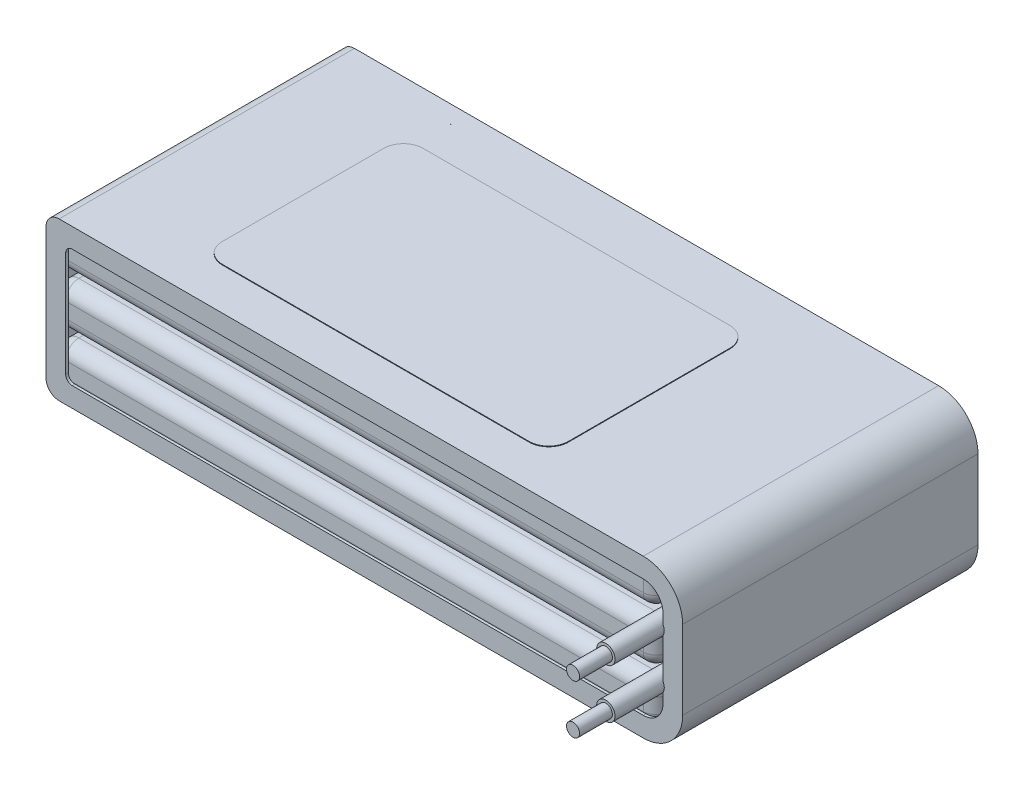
ISO-10303-21;
HEADER;
FILE_DESCRIPTION(('STEP AP214'),'2;1');
FILE_NAME('part.step','',(''),(''),'','','');
FILE_SCHEMA(('AUTOMOTIVE_DESIGN { 1 0 10303 214 1 1 1 1 }'));
ENDSEC;
DATA;
#1=APPLICATION_CONTEXT('core data for automotive mechanical design processes');
#2=APPLICATION_PROTOCOL_DEFINITION('international standard','automotive_design',2000,#1);
#3=PRODUCT_CONTEXT('',#1,'mechanical');
#4=PRODUCT('Part','Part','',(#3));
#5=PRODUCT_RELATED_PRODUCT_CATEGORY('part','',(#4));
#6=PRODUCT_DEFINITION_FORMATION('','',#4);
#7=PRODUCT_DEFINITION_CONTEXT('part definition',#1,'design');
#8=PRODUCT_DEFINITION('design','',#6,#7);
#9=PRODUCT_DEFINITION_SHAPE('','',#8);
#10=(LENGTH_UNIT() NAMED_UNIT(*) SI_UNIT(.MILLI.,.METRE.));
#11=(NAMED_UNIT(*) PLANE_ANGLE_UNIT() SI_UNIT($,.RADIAN.));
#12=(NAMED_UNIT(*) SI_UNIT($,.STERADIAN.) SOLID_ANGLE_UNIT());
#13=UNCERTAINTY_MEASURE_WITH_UNIT(LENGTH_MEASURE(1.E-05),#10,'distance_accuracy_value','');
#14=(GEOMETRIC_REPRESENTATION_CONTEXT(3) GLOBAL_UNCERTAINTY_ASSIGNED_CONTEXT((#13)) GLOBAL_UNIT_ASSIGNED_CONTEXT((#10,
#11,#12)) REPRESENTATION_CONTEXT('',''));
#15=CARTESIAN_POINT('',(0.,0.,0.));
#16=DIRECTION('',(0.,0.,1.));
#17=DIRECTION('',(1.,0.,0.));
#18=AXIS2_PLACEMENT_3D('',#15,#16,#17);
#19=CARTESIAN_POINT('',(-25.9829858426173,4.25,13.1567854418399));
#20=DIRECTION('',(0.,-1.,0.));
#21=DIRECTION('',(1.,0.,0.));
#22=AXIS2_PLACEMENT_3D('',#19,#20,#21);
#23=CYLINDRICAL_SURFACE('',#22,3.);
#24=CARTESIAN_POINT('',(-25.9829858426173,4.15,13.1567854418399));
#25=DIRECTION('',(0.,1.,0.));
#26=DIRECTION('',(-1.,0.,0.));
#27=AXIS2_PLACEMENT_3D('',#24,#25,#26);
#28=CIRCLE('',#27,3.);
#29=CARTESIAN_POINT('',(-28.9829858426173,4.15,13.1567854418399));
#30=VERTEX_POINT('',#29);
#31=CARTESIAN_POINT('',(-25.9829858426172,4.15,16.1567854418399));
#32=VERTEX_POINT('',#31);
#33=EDGE_CURVE('E142',#30,#32,#28,.T.);
#34=ORIENTED_EDGE('',*,*,#33,.T.);
#35=DIRECTION('',(0.,-1.,0.));
#36=VECTOR('',#35,1.);
#37=CARTESIAN_POINT('',(-25.9829858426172,4.25,16.1567854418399));
#38=LINE('',#37,#36);
#39=CARTESIAN_POINT('',(-25.9829858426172,4.25,16.1567854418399));
#40=VERTEX_POINT('',#39);
#41=EDGE_CURVE('E12',#40,#32,#38,.T.);
#42=ORIENTED_EDGE('',*,*,#41,.F.);
#43=CARTESIAN_POINT('',(-25.9829858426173,4.25,13.1567854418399));
#44=DIRECTION('',(0.,1.,0.));
#45=DIRECTION('',(-1.,0.,0.));
#46=AXIS2_PLACEMENT_3D('',#43,#44,#45);
#47=CIRCLE('',#46,3.);
#48=CARTESIAN_POINT('',(-28.9829858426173,4.25,13.1567854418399));
#49=VERTEX_POINT('',#48);
#50=EDGE_CURVE('E156',#49,#40,#47,.T.);
#51=ORIENTED_EDGE('',*,*,#50,.F.);
#52=DIRECTION('',(0.,-1.,0.));
#53=VECTOR('',#52,1.);
#54=CARTESIAN_POINT('',(-28.9829858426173,4.25,13.1567854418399));
#55=LINE('',#54,#53);
#56=EDGE_CURVE('E138',#49,#30,#55,.T.);
#57=ORIENTED_EDGE('',*,*,#56,.T.);
#58=EDGE_LOOP('',(#34,#42,#51,#57));
#59=FACE_BOUND('',#58,.T.);
#60=ADVANCED_FACE('F46',(#59),#23,.T.);
#61=CARTESIAN_POINT('',(-25.9829858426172,4.25,16.1567854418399));
#62=DIRECTION('',(0.,0.,-1.));
#63=DIRECTION('',(-1.,0.,0.));
#64=AXIS2_PLACEMENT_3D('',#61,#62,#63);
#65=PLANE('',#64);
#66=DIRECTION('',(1.,0.,0.));
#67=VECTOR('',#66,1.);
#68=CARTESIAN_POINT('',(-25.9829858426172,4.15,16.1567854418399));
#69=LINE('',#68,#67);
#70=CARTESIAN_POINT('',(20.7560778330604,4.15000000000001,16.1567854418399));
#71=VERTEX_POINT('',#70);
#72=EDGE_CURVE('E145',#32,#71,#69,.T.);
#73=ORIENTED_EDGE('',*,*,#72,.T.);
#74=DIRECTION('',(0.,-1.,0.));
#75=VECTOR('',#74,1.);
#76=CARTESIAN_POINT('',(20.7560778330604,4.25000000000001,16.1567854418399));
#77=LINE('',#76,#75);
#78=CARTESIAN_POINT('',(20.7560778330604,4.25000000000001,16.1567854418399));
#79=VERTEX_POINT('',#78);
#80=EDGE_CURVE('E54',#79,#71,#77,.T.);
#81=ORIENTED_EDGE('',*,*,#80,.F.);
#82=DIRECTION('',(1.,0.,0.));
#83=VECTOR('',#82,1.);
#84=CARTESIAN_POINT('',(-25.9829858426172,4.25,16.1567854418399));
#85=LINE('',#84,#83);
#86=EDGE_CURVE('E105',#40,#79,#85,.T.);
#87=ORIENTED_EDGE('',*,*,#86,.F.);
#88=ORIENTED_EDGE('',*,*,#41,.T.);
#89=EDGE_LOOP('',(#73,#81,#87,#88));
#90=FACE_BOUND('',#89,.T.);
#91=ADVANCED_FACE('F191',(#90),#65,.F.);
#92=CARTESIAN_POINT('',(20.7560778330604,4.25000000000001,13.1567854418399));
#93=DIRECTION('',(0.,-1.,0.));
#94=DIRECTION('',(1.,0.,0.));
#95=AXIS2_PLACEMENT_3D('',#92,#93,#94);
#96=CYLINDRICAL_SURFACE('',#95,3.);
#97=CARTESIAN_POINT('',(20.7560778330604,4.15000000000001,13.1567854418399));
#98=DIRECTION('',(0.,1.,0.));
#99=DIRECTION('',(-1.,0.,0.));
#100=AXIS2_PLACEMENT_3D('',#97,#98,#99);
#101=CIRCLE('',#100,3.);
#102=CARTESIAN_POINT('',(23.7560778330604,4.15000000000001,13.1567854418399));
#103=VERTEX_POINT('',#102);
#104=EDGE_CURVE('E147',#71,#103,#101,.T.);
#105=ORIENTED_EDGE('',*,*,#104,.T.);
#106=DIRECTION('',(0.,-1.,0.));
#107=VECTOR('',#106,1.);
#108=CARTESIAN_POINT('',(23.7560778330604,4.25000000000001,13.1567854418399));
#109=LINE('',#108,#107);
#110=CARTESIAN_POINT('',(23.7560778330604,4.25000000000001,13.1567854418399));
#111=VERTEX_POINT('',#110);
#112=EDGE_CURVE('E163',#111,#103,#109,.T.);
#113=ORIENTED_EDGE('',*,*,#112,.F.);
#114=CARTESIAN_POINT('',(20.7560778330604,4.25000000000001,13.1567854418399));
#115=DIRECTION('',(0.,1.,0.));
#116=DIRECTION('',(-1.,0.,0.));
#117=AXIS2_PLACEMENT_3D('',#114,#115,#116);
#118=CIRCLE('',#117,3.);
#119=EDGE_CURVE('E171',#79,#111,#118,.T.);
#120=ORIENTED_EDGE('',*,*,#119,.F.);
#121=ORIENTED_EDGE('',*,*,#80,.T.);
#122=EDGE_LOOP('',(#105,#113,#120,#121));
#123=FACE_BOUND('',#122,.T.);
#124=ADVANCED_FACE('F169',(#123),#96,.T.);
#125=CARTESIAN_POINT('',(23.7560778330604,4.25000000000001,-11.4376990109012));
#126=DIRECTION('',(-1.,0.,0.));
#127=DIRECTION('',(0.,0.,1.));
#128=AXIS2_PLACEMENT_3D('',#125,#126,#127);
#129=PLANE('',#128);
#130=DIRECTION('',(0.,0.,-1.));
#131=VECTOR('',#130,1.);
#132=CARTESIAN_POINT('',(23.7560778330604,4.15000000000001,-11.4376990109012));
#133=LINE('',#132,#131);
#134=CARTESIAN_POINT('',(23.7560778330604,4.15000000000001,-11.4376990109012));
#135=VERTEX_POINT('',#134);
#136=EDGE_CURVE('E149',#103,#135,#133,.T.);
#137=ORIENTED_EDGE('',*,*,#136,.T.);
#138=DIRECTION('',(0.,-1.,0.));
#139=VECTOR('',#138,1.);
#140=CARTESIAN_POINT('',(23.7560778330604,4.25000000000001,-11.4376990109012));
#141=LINE('',#140,#139);
#142=CARTESIAN_POINT('',(23.7560778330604,4.25000000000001,-11.4376990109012));
#143=VERTEX_POINT('',#142);
#144=EDGE_CURVE('E160',#143,#135,#141,.T.);
#145=ORIENTED_EDGE('',*,*,#144,.F.);
#146=DIRECTION('',(0.,0.,-1.));
#147=VECTOR('',#146,1.);
#148=CARTESIAN_POINT('',(23.7560778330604,4.25000000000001,-11.4376990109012));
#149=LINE('',#148,#147);
#150=EDGE_CURVE('E183',#111,#143,#149,.T.);
#151=ORIENTED_EDGE('',*,*,#150,.F.);
#152=ORIENTED_EDGE('',*,*,#112,.T.);
#153=EDGE_LOOP('',(#137,#145,#151,#152));
#154=FACE_BOUND('',#153,.T.);
#155=ADVANCED_FACE('F179',(#154),#129,.F.);
#156=CARTESIAN_POINT('',(20.7560778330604,4.25000000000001,-11.4376990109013));
#157=DIRECTION('',(0.,-1.,0.));
#158=DIRECTION('',(1.,0.,0.));
#159=AXIS2_PLACEMENT_3D('',#156,#157,#158);
#160=CYLINDRICAL_SURFACE('',#159,3.);
#161=CARTESIAN_POINT('',(20.7560778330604,4.15000000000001,-11.4376990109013));
#162=DIRECTION('',(0.,1.,0.));
#163=DIRECTION('',(1.,0.,0.));
#164=AXIS2_PLACEMENT_3D('',#161,#162,#163);
#165=CIRCLE('',#164,3.);
#166=CARTESIAN_POINT('',(20.7560778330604,4.15000000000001,-14.4376990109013));
#167=VERTEX_POINT('',#166);
#168=EDGE_CURVE('E151',#135,#167,#165,.T.);
#169=ORIENTED_EDGE('',*,*,#168,.T.);
#170=DIRECTION('',(0.,-1.,0.));
#171=VECTOR('',#170,1.);
#172=CARTESIAN_POINT('',(20.7560778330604,4.25000000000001,-14.4376990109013));
#173=LINE('',#172,#171);
#174=CARTESIAN_POINT('',(20.7560778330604,4.25000000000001,-14.4376990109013));
#175=VERTEX_POINT('',#174);
#176=EDGE_CURVE('E133',#175,#167,#173,.T.);
#177=ORIENTED_EDGE('',*,*,#176,.F.);
#178=CARTESIAN_POINT('',(20.7560778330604,4.25000000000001,-11.4376990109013));
#179=DIRECTION('',(0.,1.,0.));
#180=DIRECTION('',(1.,0.,0.));
#181=AXIS2_PLACEMENT_3D('',#178,#179,#180);
#182=CIRCLE('',#181,3.);
#183=EDGE_CURVE('E124',#143,#175,#182,.T.);
#184=ORIENTED_EDGE('',*,*,#183,.F.);
#185=ORIENTED_EDGE('',*,*,#144,.T.);
#186=EDGE_LOOP('',(#169,#177,#184,#185));
#187=FACE_BOUND('',#186,.T.);
#188=ADVANCED_FACE('F182',(#187),#160,.T.);
#189=CARTESIAN_POINT('',(-25.9829858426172,4.25,-14.4376990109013));
#190=DIRECTION('',(0.,0.,1.));
#191=DIRECTION('',(1.,0.,0.));
#192=AXIS2_PLACEMENT_3D('',#189,#190,#191);
#193=PLANE('',#192);
#194=DIRECTION('',(-1.,0.,0.));
#195=VECTOR('',#194,1.);
#196=CARTESIAN_POINT('',(-25.9829858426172,4.15,-14.4376990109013));
#197=LINE('',#196,#195);
#198=CARTESIAN_POINT('',(-25.9829858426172,4.15,-14.4376990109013));
#199=VERTEX_POINT('',#198);
#200=EDGE_CURVE('E132',#167,#199,#197,.T.);
#201=ORIENTED_EDGE('',*,*,#200,.T.);
#202=DIRECTION('',(0.,-1.,0.));
#203=VECTOR('',#202,1.);
#204=CARTESIAN_POINT('',(-25.9829858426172,4.25,-14.4376990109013));
#205=LINE('',#204,#203);
#206=CARTESIAN_POINT('',(-25.9829858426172,4.25,-14.4376990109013));
#207=VERTEX_POINT('',#206);
#208=EDGE_CURVE('E129',#207,#199,#205,.T.);
#209=ORIENTED_EDGE('',*,*,#208,.F.);
#210=DIRECTION('',(-1.,0.,0.));
#211=VECTOR('',#210,1.);
#212=CARTESIAN_POINT('',(-25.9829858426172,4.25,-14.4376990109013));
#213=LINE('',#212,#211);
#214=EDGE_CURVE('E118',#175,#207,#213,.T.);
#215=ORIENTED_EDGE('',*,*,#214,.F.);
#216=ORIENTED_EDGE('',*,*,#176,.T.);
#217=EDGE_LOOP('',(#201,#209,#215,#216));
#218=FACE_BOUND('',#217,.T.);
#219=ADVANCED_FACE('F130',(#218),#193,.F.);
#220=CARTESIAN_POINT('',(-25.9829858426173,4.25,-11.4376990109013));
#221=DIRECTION('',(0.,-1.,0.));
#222=DIRECTION('',(1.,0.,0.));
#223=AXIS2_PLACEMENT_3D('',#220,#221,#222);
#224=CYLINDRICAL_SURFACE('',#223,3.);
#225=CARTESIAN_POINT('',(-25.9829858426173,4.15,-11.4376990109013));
#226=DIRECTION('',(0.,1.,0.));
#227=DIRECTION('',(-1.,0.,0.));
#228=AXIS2_PLACEMENT_3D('',#225,#226,#227);
#229=CIRCLE('',#228,3.);
#230=CARTESIAN_POINT('',(-28.9829858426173,4.15,-11.4376990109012));
#231=VERTEX_POINT('',#230);
#232=EDGE_CURVE('E91',#199,#231,#229,.T.);
#233=ORIENTED_EDGE('',*,*,#232,.T.);
#234=DIRECTION('',(0.,-1.,0.));
#235=VECTOR('',#234,1.);
#236=CARTESIAN_POINT('',(-28.9829858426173,4.25,-11.4376990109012));
#237=LINE('',#236,#235);
#238=CARTESIAN_POINT('',(-28.9829858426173,4.25,-11.4376990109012));
#239=VERTEX_POINT('',#238);
#240=EDGE_CURVE('E134',#239,#231,#237,.T.);
#241=ORIENTED_EDGE('',*,*,#240,.F.);
#242=CARTESIAN_POINT('',(-25.9829858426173,4.25,-11.4376990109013));
#243=DIRECTION('',(0.,1.,0.));
#244=DIRECTION('',(-1.,0.,0.));
#245=AXIS2_PLACEMENT_3D('',#242,#243,#244);
#246=CIRCLE('',#245,3.);
#247=EDGE_CURVE('E122',#207,#239,#246,.T.);
#248=ORIENTED_EDGE('',*,*,#247,.F.);
#249=ORIENTED_EDGE('',*,*,#208,.T.);
#250=EDGE_LOOP('',(#233,#241,#248,#249));
#251=FACE_BOUND('',#250,.T.);
#252=ADVANCED_FACE('F136',(#251),#224,.T.);
#253=CARTESIAN_POINT('',(-28.9829858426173,4.25,-11.4376990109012));
#254=DIRECTION('',(1.,0.,0.));
#255=DIRECTION('',(0.,1.,0.));
#256=AXIS2_PLACEMENT_3D('',#253,#254,#255);
#257=PLANE('',#256);
#258=DIRECTION('',(0.,0.,1.));
#259=VECTOR('',#258,1.);
#260=CARTESIAN_POINT('',(-28.9829858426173,4.15,-11.4376990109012));
#261=LINE('',#260,#259);
#262=EDGE_CURVE('E97',#231,#30,#261,.T.);
#263=ORIENTED_EDGE('',*,*,#262,.T.);
#264=ORIENTED_EDGE('',*,*,#56,.F.);
#265=DIRECTION('',(0.,0.,1.));
#266=VECTOR('',#265,1.);
#267=CARTESIAN_POINT('',(-28.9829858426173,4.25,-11.4376990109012));
#268=LINE('',#267,#266);
#269=EDGE_CURVE('E62',#239,#49,#268,.T.);
#270=ORIENTED_EDGE('',*,*,#269,.F.);
#271=ORIENTED_EDGE('',*,*,#240,.T.);
#272=EDGE_LOOP('',(#263,#264,#270,#271));
#273=FACE_BOUND('',#272,.T.);
#274=ADVANCED_FACE('F207',(#273),#257,.F.);
#275=CARTESIAN_POINT('',(-25.9829858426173,4.25,13.1567854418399));
#276=DIRECTION('',(0.,1.,0.));
#277=DIRECTION('',(-1.,0.,0.));
#278=AXIS2_PLACEMENT_3D('',#275,#276,#277);
#279=PLANE('',#278);
#280=ORIENTED_EDGE('',*,*,#50,.T.);
#281=ORIENTED_EDGE('',*,*,#86,.T.);
#282=ORIENTED_EDGE('',*,*,#119,.T.);
#283=ORIENTED_EDGE('',*,*,#150,.T.);
#284=ORIENTED_EDGE('',*,*,#183,.T.);
#285=ORIENTED_EDGE('',*,*,#214,.T.);
#286=ORIENTED_EDGE('',*,*,#247,.T.);
#287=ORIENTED_EDGE('',*,*,#269,.T.);
#288=EDGE_LOOP('',(#280,#281,#282,#283,#284,#285,#286,#287));
#289=FACE_BOUND('',#288,.T.);
#290=ADVANCED_FACE('F120',(#289),#279,.T.);
#291=CARTESIAN_POINT('',(-25.9829858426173,4.15,13.1567854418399));
#292=DIRECTION('',(0.,1.,0.));
#293=DIRECTION('',(-1.,0.,0.));
#294=AXIS2_PLACEMENT_3D('',#291,#292,#293);
#295=PLANE('',#294);
#296=ORIENTED_EDGE('',*,*,#33,.F.);
#297=ORIENTED_EDGE('',*,*,#262,.F.);
#298=ORIENTED_EDGE('',*,*,#232,.F.);
#299=ORIENTED_EDGE('',*,*,#200,.F.);
#300=ORIENTED_EDGE('',*,*,#168,.F.);
#301=ORIENTED_EDGE('',*,*,#136,.F.);
#302=ORIENTED_EDGE('',*,*,#104,.F.);
#303=ORIENTED_EDGE('',*,*,#72,.F.);
#304=EDGE_LOOP('',(#296,#297,#298,#299,#300,#301,#302,#303));
#305=FACE_BOUND('',#304,.T.);
#306=ADVANCED_FACE('F175',(#305),#295,.F.);
#307=CLOSED_SHELL('',(#60,#91,#124,#155,#188,#219,#252,#274,#290,#306));
#308=MANIFOLD_SOLID_BREP('B2',#307);
#309=CARTESIAN_POINT('',(46.3,-11.6,35.));
#310=DIRECTION('',(0.,0.,-1.));
#311=DIRECTION('',(-1.,0.,0.));
#312=AXIS2_PLACEMENT_3D('',#309,#310,#311);
#313=CYLINDRICAL_SURFACE('',#312,0.999999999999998);
#314=CARTESIAN_POINT('',(46.3,-11.6,35.));
#315=DIRECTION('',(0.,0.,1.));
#316=DIRECTION('',(1.,0.,0.));
#317=AXIS2_PLACEMENT_3D('',#314,#315,#316);
#318=CIRCLE('',#317,0.999999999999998);
#319=CARTESIAN_POINT('',(47.3,-11.6,35.));
#320=VERTEX_POINT('',#319);
#321=EDGE_CURVE('E45',#320,#320,#318,.T.);
#322=ORIENTED_EDGE('',*,*,#321,.F.);
#323=EDGE_LOOP('',(#322));
#324=FACE_BOUND('',#323,.T.);
#325=CARTESIAN_POINT('',(46.3,-11.6,30.));
#326=DIRECTION('',(0.,0.,1.));
#327=DIRECTION('',(1.,0.,0.));
#328=AXIS2_PLACEMENT_3D('',#325,#326,#327);
#329=CIRCLE('',#328,0.999999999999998);
#330=CARTESIAN_POINT('',(47.3,-11.6,30.));
#331=VERTEX_POINT('',#330);
#332=EDGE_CURVE('E284',#331,#331,#329,.T.);
#333=ORIENTED_EDGE('',*,*,#332,.T.);
#334=EDGE_LOOP('',(#333));
#335=FACE_BOUND('',#334,.T.);
#336=ADVANCED_FACE('F281',(#324,#335),#313,.T.);
#337=CARTESIAN_POINT('',(46.3,-11.6,35.));
#338=DIRECTION('',(0.,0.,1.));
#339=DIRECTION('',(1.,0.,0.));
#340=AXIS2_PLACEMENT_3D('',#337,#338,#339);
#341=PLANE('',#340);
#342=ORIENTED_EDGE('',*,*,#321,.T.);
#343=EDGE_LOOP('',(#342));
#344=FACE_BOUND('',#343,.T.);
#345=ADVANCED_FACE('F296',(#344),#341,.T.);
#346=CARTESIAN_POINT('',(46.3,-11.6,30.));
#347=DIRECTION('',(0.,0.,1.));
#348=DIRECTION('',(1.,0.,0.));
#349=AXIS2_PLACEMENT_3D('',#346,#347,#348);
#350=PLANE('',#349);
#351=ORIENTED_EDGE('',*,*,#332,.F.);
#352=EDGE_LOOP('',(#351));
#353=FACE_BOUND('',#352,.T.);
#354=ADVANCED_FACE('F294',(#353),#350,.F.);
#355=CLOSED_SHELL('',(#336,#345,#354));
#356=MANIFOLD_SOLID_BREP('B6',#355);
#357=CARTESIAN_POINT('',(46.3,-4.1,35.));
#358=DIRECTION('',(0.,0.,-1.));
#359=DIRECTION('',(-1.,0.,0.));
#360=AXIS2_PLACEMENT_3D('',#357,#358,#359);
#361=CYLINDRICAL_SURFACE('',#360,0.999999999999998);
#362=CARTESIAN_POINT('',(46.3,-4.1,35.));
#363=DIRECTION('',(0.,0.,1.));
#364=DIRECTION('',(1.,0.,0.));
#365=AXIS2_PLACEMENT_3D('',#362,#363,#364);
#366=CIRCLE('',#365,0.999999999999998);
#367=CARTESIAN_POINT('',(47.3,-4.1,35.));
#368=VERTEX_POINT('',#367);
#369=EDGE_CURVE('E280',#368,#368,#366,.T.);
#370=ORIENTED_EDGE('',*,*,#369,.F.);
#371=EDGE_LOOP('',(#370));
#372=FACE_BOUND('',#371,.T.);
#373=CARTESIAN_POINT('',(46.3,-4.1,30.));
#374=DIRECTION('',(0.,0.,1.));
#375=DIRECTION('',(1.,0.,0.));
#376=AXIS2_PLACEMENT_3D('',#373,#374,#375);
#377=CIRCLE('',#376,0.999999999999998);
#378=CARTESIAN_POINT('',(47.3,-4.1,30.));
#379=VERTEX_POINT('',#378);
#380=EDGE_CURVE('E332',#379,#379,#377,.T.);
#381=ORIENTED_EDGE('',*,*,#380,.T.);
#382=EDGE_LOOP('',(#381));
#383=FACE_BOUND('',#382,.T.);
#384=ADVANCED_FACE('F329',(#372,#383),#361,.T.);
#385=CARTESIAN_POINT('',(46.3,-4.1,35.));
#386=DIRECTION('',(0.,0.,1.));
#387=DIRECTION('',(1.,0.,0.));
#388=AXIS2_PLACEMENT_3D('',#385,#386,#387);
#389=PLANE('',#388);
#390=ORIENTED_EDGE('',*,*,#369,.T.);
#391=EDGE_LOOP('',(#390));
#392=FACE_BOUND('',#391,.T.);
#393=ADVANCED_FACE('F344',(#392),#389,.T.);
#394=CARTESIAN_POINT('',(46.3,-4.1,30.));
#395=DIRECTION('',(0.,0.,1.));
#396=DIRECTION('',(1.,0.,0.));
#397=AXIS2_PLACEMENT_3D('',#394,#395,#396);
#398=PLANE('',#397);
#399=ORIENTED_EDGE('',*,*,#380,.F.);
#400=EDGE_LOOP('',(#399));
#401=FACE_BOUND('',#400,.T.);
#402=ADVANCED_FACE('F342',(#401),#398,.F.);
#403=CLOSED_SHELL('',(#384,#393,#402));
#404=MANIFOLD_SOLID_BREP('B40',#403);
#405=CARTESIAN_POINT('',(46.3,-11.6,30.));
#406=DIRECTION('',(0.,0.,-1.));
#407=DIRECTION('',(-1.,0.,0.));
#408=AXIS2_PLACEMENT_3D('',#405,#406,#407);
#409=CYLINDRICAL_SURFACE('',#408,1.4);
#410=CARTESIAN_POINT('',(46.3,-11.6,30.));
#411=DIRECTION('',(0.,0.,1.));
#412=DIRECTION('',(-1.,0.,0.));
#413=AXIS2_PLACEMENT_3D('',#410,#411,#412);
#414=CIRCLE('',#413,1.4);
#415=CARTESIAN_POINT('',(44.9,-11.6,30.));
#416=VERTEX_POINT('',#415);
#417=EDGE_CURVE('E328',#416,#416,#414,.T.);
#418=ORIENTED_EDGE('',*,*,#417,.F.);
#419=EDGE_LOOP('',(#418));
#420=FACE_BOUND('',#419,.T.);
#421=CARTESIAN_POINT('',(46.3,-11.6,0.));
#422=DIRECTION('',(0.,0.,1.));
#423=DIRECTION('',(-1.,0.,0.));
#424=AXIS2_PLACEMENT_3D('',#421,#422,#423);
#425=CIRCLE('',#424,1.4);
#426=CARTESIAN_POINT('',(44.9,-11.6,0.));
#427=VERTEX_POINT('',#426);
#428=EDGE_CURVE('E380',#427,#427,#425,.T.);
#429=ORIENTED_EDGE('',*,*,#428,.T.);
#430=EDGE_LOOP('',(#429));
#431=FACE_BOUND('',#430,.T.);
#432=ADVANCED_FACE('F377',(#420,#431),#409,.T.);
#433=CARTESIAN_POINT('',(46.3,-11.6,30.));
#434=DIRECTION('',(0.,0.,-1.));
#435=DIRECTION('',(-1.,0.,0.));
#436=AXIS2_PLACEMENT_3D('',#433,#434,#435);
#437=PLANE('',#436);
#438=ORIENTED_EDGE('',*,*,#417,.T.);
#439=EDGE_LOOP('',(#438));
#440=FACE_BOUND('',#439,.T.);
#441=ADVANCED_FACE('F392',(#440),#437,.F.);
#442=CARTESIAN_POINT('',(46.3,-11.6,0.));
#443=DIRECTION('',(0.,0.,-1.));
#444=DIRECTION('',(-1.,0.,0.));
#445=AXIS2_PLACEMENT_3D('',#442,#443,#444);
#446=PLANE('',#445);
#447=ORIENTED_EDGE('',*,*,#428,.F.);
#448=EDGE_LOOP('',(#447));
#449=FACE_BOUND('',#448,.T.);
#450=ADVANCED_FACE('F390',(#449),#446,.T.);
#451=CLOSED_SHELL('',(#432,#441,#450));
#452=MANIFOLD_SOLID_BREP('B275',#451);
#453=CARTESIAN_POINT('',(46.3,-4.1,30.));
#454=DIRECTION('',(0.,0.,-1.));
#455=DIRECTION('',(-1.,0.,0.));
#456=AXIS2_PLACEMENT_3D('',#453,#454,#455);
#457=CYLINDRICAL_SURFACE('',#456,1.4);
#458=CARTESIAN_POINT('',(46.3,-4.1,30.));
#459=DIRECTION('',(0.,0.,1.));
#460=DIRECTION('',(1.,0.,0.));
#461=AXIS2_PLACEMENT_3D('',#458,#459,#460);
#462=CIRCLE('',#461,1.4);
#463=CARTESIAN_POINT('',(47.7,-4.1,30.));
#464=VERTEX_POINT('',#463);
#465=EDGE_CURVE('E376',#464,#464,#462,.T.);
#466=ORIENTED_EDGE('',*,*,#465,.F.);
#467=EDGE_LOOP('',(#466));
#468=FACE_BOUND('',#467,.T.);
#469=CARTESIAN_POINT('',(46.3,-4.1,0.));
#470=DIRECTION('',(0.,0.,1.));
#471=DIRECTION('',(1.,0.,0.));
#472=AXIS2_PLACEMENT_3D('',#469,#470,#471);
#473=CIRCLE('',#472,1.4);
#474=CARTESIAN_POINT('',(47.7,-4.1,0.));
#475=VERTEX_POINT('',#474);
#476=EDGE_CURVE('E430',#475,#475,#473,.T.);
#477=ORIENTED_EDGE('',*,*,#476,.T.);
#478=EDGE_LOOP('',(#477));
#479=FACE_BOUND('',#478,.T.);
#480=ADVANCED_FACE('F427',(#468,#479),#457,.T.);
#481=CARTESIAN_POINT('',(46.3,-4.1,30.));
#482=DIRECTION('',(0.,0.,1.));
#483=DIRECTION('',(1.,0.,0.));
#484=AXIS2_PLACEMENT_3D('',#481,#482,#483);
#485=PLANE('',#484);
#486=ORIENTED_EDGE('',*,*,#465,.T.);
#487=EDGE_LOOP('',(#486));
#488=FACE_BOUND('',#487,.T.);
#489=ADVANCED_FACE('F442',(#488),#485,.T.);
#490=CARTESIAN_POINT('',(46.3,-4.1,0.));
#491=DIRECTION('',(0.,0.,1.));
#492=DIRECTION('',(1.,0.,0.));
#493=AXIS2_PLACEMENT_3D('',#490,#491,#492);
#494=PLANE('',#493);
#495=ORIENTED_EDGE('',*,*,#476,.F.);
#496=EDGE_LOOP('',(#495));
#497=FACE_BOUND('',#496,.T.);
#498=ADVANCED_FACE('F440',(#497),#494,.F.);
#499=CLOSED_SHELL('',(#480,#489,#498));
#500=MANIFOLD_SOLID_BREP('B323',#499);
#501=CARTESIAN_POINT('',(-44.5,2.15,22.5));
#502=DIRECTION('',(0.,0.,-1.));
#503=DIRECTION('',(-1.,0.,0.));
#504=AXIS2_PLACEMENT_3D('',#501,#502,#503);
#505=CYLINDRICAL_SURFACE('',#504,1.5);
#506=DIRECTION('',(0.,0.,-1.));
#507=VECTOR('',#506,1.);
#508=CARTESIAN_POINT('',(-44.5,3.65,22.5));
#509=LINE('',#508,#507);
#510=CARTESIAN_POINT('',(-44.5,3.65,22.1));
#511=VERTEX_POINT('',#510);
#512=CARTESIAN_POINT('',(-44.5,3.65,-22.1));
#513=VERTEX_POINT('',#512);
#514=EDGE_CURVE('E827',#511,#513,#509,.T.);
#515=ORIENTED_EDGE('',*,*,#514,.F.);
#516=CARTESIAN_POINT('',(-44.5,2.15,22.1));
#517=DIRECTION('',(0.,0.,1.));
#518=DIRECTION('',(1.,0.,0.));
#519=AXIS2_PLACEMENT_3D('',#516,#517,#518);
#520=CIRCLE('',#519,1.5);
#521=CARTESIAN_POINT('',(-46.,2.15,22.1));
#522=VERTEX_POINT('',#521);
#523=EDGE_CURVE('E761',#511,#522,#520,.T.);
#524=ORIENTED_EDGE('',*,*,#523,.T.);
#525=DIRECTION('',(0.,0.,-1.));
#526=VECTOR('',#525,1.);
#527=CARTESIAN_POINT('',(-46.,2.15,22.5));
#528=LINE('',#527,#526);
#529=CARTESIAN_POINT('',(-46.,2.15,-22.1));
#530=VERTEX_POINT('',#529);
#531=EDGE_CURVE('E841',#522,#530,#528,.T.);
#532=ORIENTED_EDGE('',*,*,#531,.T.);
#533=CARTESIAN_POINT('',(-44.5,2.15,-22.1));
#534=DIRECTION('',(0.,0.,-1.));
#535=DIRECTION('',(-1.,0.,0.));
#536=AXIS2_PLACEMENT_3D('',#533,#534,#535);
#537=CIRCLE('',#536,1.5);
#538=EDGE_CURVE('E824',#530,#513,#537,.T.);
#539=ORIENTED_EDGE('',*,*,#538,.T.);
#540=EDGE_LOOP('',(#515,#524,#532,#539));
#541=FACE_BOUND('',#540,.T.);
#542=ADVANCED_FACE('F477',(#541),#505,.F.);
#543=CARTESIAN_POINT('',(-46.,2.15,22.5));
#544=DIRECTION('',(1.,0.,0.));
#545=DIRECTION('',(0.,1.,0.));
#546=AXIS2_PLACEMENT_3D('',#543,#544,#545);
#547=PLANE('',#546);
#548=ORIENTED_EDGE('',*,*,#531,.F.);
#549=DIRECTION('',(0.,-1.,0.));
#550=VECTOR('',#549,1.);
#551=CARTESIAN_POINT('',(-46.,2.15,22.1));
#552=LINE('',#551,#550);
#553=CARTESIAN_POINT('',(-46.,-17.85,22.1));
#554=VERTEX_POINT('',#553);
#555=EDGE_CURVE('E758',#522,#554,#552,.T.);
#556=ORIENTED_EDGE('',*,*,#555,.T.);
#557=DIRECTION('',(0.,0.,-1.));
#558=VECTOR('',#557,1.);
#559=CARTESIAN_POINT('',(-46.,-17.85,22.5));
#560=LINE('',#559,#558);
#561=CARTESIAN_POINT('',(-46.,-17.85,-22.1));
#562=VERTEX_POINT('',#561);
#563=EDGE_CURVE('E839',#554,#562,#560,.T.);
#564=ORIENTED_EDGE('',*,*,#563,.T.);
#565=DIRECTION('',(0.,1.,0.));
#566=VECTOR('',#565,1.);
#567=CARTESIAN_POINT('',(-46.,2.15,-22.1));
#568=LINE('',#567,#566);
#569=EDGE_CURVE('E821',#562,#530,#568,.T.);
#570=ORIENTED_EDGE('',*,*,#569,.T.);
#571=EDGE_LOOP('',(#548,#556,#564,#570));
#572=FACE_BOUND('',#571,.T.);
#573=ADVANCED_FACE('F974',(#572),#547,.T.);
#574=CARTESIAN_POINT('',(-44.5,-17.85,22.5));
#575=DIRECTION('',(0.,0.,-1.));
#576=DIRECTION('',(-1.,0.,0.));
#577=AXIS2_PLACEMENT_3D('',#574,#575,#576);
#578=CYLINDRICAL_SURFACE('',#577,1.5);
#579=ORIENTED_EDGE('',*,*,#563,.F.);
#580=CARTESIAN_POINT('',(-44.5,-17.85,22.1));
#581=DIRECTION('',(0.,0.,1.));
#582=DIRECTION('',(1.,0.,0.));
#583=AXIS2_PLACEMENT_3D('',#580,#581,#582);
#584=CIRCLE('',#583,1.5);
#585=CARTESIAN_POINT('',(-44.5,-19.35,22.1));
#586=VERTEX_POINT('',#585);
#587=EDGE_CURVE('E755',#554,#586,#584,.T.);
#588=ORIENTED_EDGE('',*,*,#587,.T.);
#589=DIRECTION('',(0.,0.,-1.));
#590=VECTOR('',#589,1.);
#591=CARTESIAN_POINT('',(-44.5,-19.35,22.5));
#592=LINE('',#591,#590);
#593=CARTESIAN_POINT('',(-44.5,-19.35,-22.1));
#594=VERTEX_POINT('',#593);
#595=EDGE_CURVE('E837',#586,#594,#592,.T.);
#596=ORIENTED_EDGE('',*,*,#595,.T.);
#597=CARTESIAN_POINT('',(-44.5,-17.85,-22.1));
#598=DIRECTION('',(0.,0.,-1.));
#599=DIRECTION('',(-1.,0.,0.));
#600=AXIS2_PLACEMENT_3D('',#597,#598,#599);
#601=CIRCLE('',#600,1.5);
#602=EDGE_CURVE('E818',#594,#562,#601,.T.);
#603=ORIENTED_EDGE('',*,*,#602,.T.);
#604=EDGE_LOOP('',(#579,#588,#596,#603));
#605=FACE_BOUND('',#604,.T.);
#606=ADVANCED_FACE('F980',(#605),#578,.F.);
#607=CARTESIAN_POINT('',(-44.5,-19.35,22.5));
#608=DIRECTION('',(0.,1.,0.));
#609=DIRECTION('',(0.,0.,1.));
#610=AXIS2_PLACEMENT_3D('',#607,#608,#609);
#611=PLANE('',#610);
#612=ORIENTED_EDGE('',*,*,#595,.F.);
#613=DIRECTION('',(1.,0.,0.));
#614=VECTOR('',#613,1.);
#615=CARTESIAN_POINT('',(-44.5,-19.35,22.1));
#616=LINE('',#615,#614);
#617=CARTESIAN_POINT('',(44.5,-19.35,22.1));
#618=VERTEX_POINT('',#617);
#619=EDGE_CURVE('E752',#586,#618,#616,.T.);
#620=ORIENTED_EDGE('',*,*,#619,.T.);
#621=DIRECTION('',(0.,0.,-1.));
#622=VECTOR('',#621,1.);
#623=CARTESIAN_POINT('',(44.5,-19.35,22.5));
#624=LINE('',#623,#622);
#625=CARTESIAN_POINT('',(44.5,-19.35,-22.1));
#626=VERTEX_POINT('',#625);
#627=EDGE_CURVE('E835',#618,#626,#624,.T.);
#628=ORIENTED_EDGE('',*,*,#627,.T.);
#629=DIRECTION('',(-1.,0.,0.));
#630=VECTOR('',#629,1.);
#631=CARTESIAN_POINT('',(-44.5,-19.35,-22.1));
#632=LINE('',#631,#630);
#633=EDGE_CURVE('E815',#626,#594,#632,.T.);
#634=ORIENTED_EDGE('',*,*,#633,.T.);
#635=EDGE_LOOP('',(#612,#620,#628,#634));
#636=FACE_BOUND('',#635,.T.);
#637=ADVANCED_FACE('F1098',(#636),#611,.T.);
#638=CARTESIAN_POINT('',(44.5,-13.85,22.5));
#639=DIRECTION('',(0.,0.,-1.));
#640=DIRECTION('',(-1.,0.,0.));
#641=AXIS2_PLACEMENT_3D('',#638,#639,#640);
#642=CYLINDRICAL_SURFACE('',#641,5.5);
#643=ORIENTED_EDGE('',*,*,#627,.F.);
#644=CARTESIAN_POINT('',(44.5,-13.85,22.1));
#645=DIRECTION('',(0.,0.,1.));
#646=DIRECTION('',(1.,0.,0.));
#647=AXIS2_PLACEMENT_3D('',#644,#645,#646);
#648=CIRCLE('',#647,5.5);
#649=CARTESIAN_POINT('',(50.,-13.85,22.1));
#650=VERTEX_POINT('',#649);
#651=EDGE_CURVE('E749',#618,#650,#648,.T.);
#652=ORIENTED_EDGE('',*,*,#651,.T.);
#653=DIRECTION('',(0.,0.,-1.));
#654=VECTOR('',#653,1.);
#655=CARTESIAN_POINT('',(50.,-13.85,22.5));
#656=LINE('',#655,#654);
#657=CARTESIAN_POINT('',(50.,-13.85,-22.1));
#658=VERTEX_POINT('',#657);
#659=EDGE_CURVE('E833',#650,#658,#656,.T.);
#660=ORIENTED_EDGE('',*,*,#659,.T.);
#661=CARTESIAN_POINT('',(44.5,-13.85,-22.1));
#662=DIRECTION('',(0.,0.,-1.));
#663=DIRECTION('',(-1.,0.,0.));
#664=AXIS2_PLACEMENT_3D('',#661,#662,#663);
#665=CIRCLE('',#664,5.5);
#666=EDGE_CURVE('E812',#658,#626,#665,.T.);
#667=ORIENTED_EDGE('',*,*,#666,.T.);
#668=EDGE_LOOP('',(#643,#652,#660,#667));
#669=FACE_BOUND('',#668,.T.);
#670=ADVANCED_FACE('F1094',(#669),#642,.F.);
#671=CARTESIAN_POINT('',(50.,-1.84999999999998,22.5));
#672=DIRECTION('',(-1.,0.,0.));
#673=DIRECTION('',(0.,0.,1.));
#674=AXIS2_PLACEMENT_3D('',#671,#672,#673);
#675=PLANE('',#674);
#676=ORIENTED_EDGE('',*,*,#659,.F.);
#677=DIRECTION('',(0.,1.,0.));
#678=VECTOR('',#677,1.);
#679=CARTESIAN_POINT('',(50.,-1.84999999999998,22.1));
#680=LINE('',#679,#678);
#681=CARTESIAN_POINT('',(50.,-1.84999999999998,22.1));
#682=VERTEX_POINT('',#681);
#683=EDGE_CURVE('E746',#650,#682,#680,.T.);
#684=ORIENTED_EDGE('',*,*,#683,.T.);
#685=DIRECTION('',(0.,0.,-1.));
#686=VECTOR('',#685,1.);
#687=CARTESIAN_POINT('',(50.,-1.84999999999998,22.5));
#688=LINE('',#687,#686);
#689=CARTESIAN_POINT('',(50.,-1.84999999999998,-22.1));
#690=VERTEX_POINT('',#689);
#691=EDGE_CURVE('E831',#682,#690,#688,.T.);
#692=ORIENTED_EDGE('',*,*,#691,.T.);
#693=DIRECTION('',(0.,-1.,0.));
#694=VECTOR('',#693,1.);
#695=CARTESIAN_POINT('',(50.,-1.84999999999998,-22.1));
#696=LINE('',#695,#694);
#697=EDGE_CURVE('E809',#690,#658,#696,.T.);
#698=ORIENTED_EDGE('',*,*,#697,.T.);
#699=EDGE_LOOP('',(#676,#684,#692,#698));
#700=FACE_BOUND('',#699,.T.);
#701=ADVANCED_FACE('F1090',(#700),#675,.T.);
#702=CARTESIAN_POINT('',(44.5,-1.84999999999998,22.5));
#703=DIRECTION('',(0.,0.,-1.));
#704=DIRECTION('',(-1.,0.,0.));
#705=AXIS2_PLACEMENT_3D('',#702,#703,#704);
#706=CYLINDRICAL_SURFACE('',#705,5.49999999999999);
#707=ORIENTED_EDGE('',*,*,#691,.F.);
#708=CARTESIAN_POINT('',(44.5,-1.84999999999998,22.1));
#709=DIRECTION('',(0.,0.,1.));
#710=DIRECTION('',(1.,0.,0.));
#711=AXIS2_PLACEMENT_3D('',#708,#709,#710);
#712=CIRCLE('',#711,5.49999999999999);
#713=CARTESIAN_POINT('',(44.5,3.65,22.1));
#714=VERTEX_POINT('',#713);
#715=EDGE_CURVE('E743',#682,#714,#712,.T.);
#716=ORIENTED_EDGE('',*,*,#715,.T.);
#717=DIRECTION('',(0.,0.,-1.));
#718=VECTOR('',#717,1.);
#719=CARTESIAN_POINT('',(44.5,3.65,22.5));
#720=LINE('',#719,#718);
#721=CARTESIAN_POINT('',(44.5,3.65,-22.1));
#722=VERTEX_POINT('',#721);
#723=EDGE_CURVE('E829',#714,#722,#720,.T.);
#724=ORIENTED_EDGE('',*,*,#723,.T.);
#725=CARTESIAN_POINT('',(44.5,-1.84999999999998,-22.1));
#726=DIRECTION('',(0.,0.,-1.));
#727=DIRECTION('',(-1.,0.,0.));
#728=AXIS2_PLACEMENT_3D('',#725,#726,#727);
#729=CIRCLE('',#728,5.49999999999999);
#730=EDGE_CURVE('E800',#722,#690,#729,.T.);
#731=ORIENTED_EDGE('',*,*,#730,.T.);
#732=EDGE_LOOP('',(#707,#716,#724,#731));
#733=FACE_BOUND('',#732,.T.);
#734=ADVANCED_FACE('F1086',(#733),#706,.F.);
#735=CARTESIAN_POINT('',(-44.5,3.65,22.5));
#736=DIRECTION('',(0.,-1.,0.));
#737=DIRECTION('',(0.,0.,-1.));
#738=AXIS2_PLACEMENT_3D('',#735,#736,#737);
#739=PLANE('',#738);
#740=ORIENTED_EDGE('',*,*,#723,.F.);
#741=DIRECTION('',(-1.,0.,0.));
#742=VECTOR('',#741,1.);
#743=CARTESIAN_POINT('',(-44.5,3.65,22.1));
#744=LINE('',#743,#742);
#745=EDGE_CURVE('E736',#714,#511,#744,.T.);
#746=ORIENTED_EDGE('',*,*,#745,.T.);
#747=ORIENTED_EDGE('',*,*,#514,.T.);
#748=DIRECTION('',(1.,0.,0.));
#749=VECTOR('',#748,1.);
#750=CARTESIAN_POINT('',(-44.5,3.65,-22.1));
#751=LINE('',#750,#749);
#752=EDGE_CURVE('E900',#513,#722,#751,.T.);
#753=ORIENTED_EDGE('',*,*,#752,.T.);
#754=EDGE_LOOP('',(#740,#746,#747,#753));
#755=FACE_BOUND('',#754,.T.);
#756=ADVANCED_FACE('F989',(#755),#739,.T.);
#757=CARTESIAN_POINT('',(-44.5,-17.85,22.5));
#758=DIRECTION('',(0.,0.,1.));
#759=DIRECTION('',(1.,0.,0.));
#760=AXIS2_PLACEMENT_3D('',#757,#758,#759);
#761=PLANE('',#760);
#762=CARTESIAN_POINT('',(-44.5,-17.85,22.5));
#763=DIRECTION('',(0.,0.,1.));
#764=DIRECTION('',(1.,0.,0.));
#765=AXIS2_PLACEMENT_3D('',#762,#763,#764);
#766=CIRCLE('',#765,2.);
#767=CARTESIAN_POINT('',(-46.5,-17.85,22.5));
#768=VERTEX_POINT('',#767);
#769=CARTESIAN_POINT('',(-44.5,-19.85,22.5));
#770=VERTEX_POINT('',#769);
#771=EDGE_CURVE('E844',#768,#770,#766,.T.);
#772=ORIENTED_EDGE('',*,*,#771,.T.);
#773=DIRECTION('',(1.,0.,0.));
#774=VECTOR('',#773,1.);
#775=CARTESIAN_POINT('',(-44.5,-19.85,22.5));
#776=LINE('',#775,#774);
#777=CARTESIAN_POINT('',(44.5,-19.85,22.5));
#778=VERTEX_POINT('',#777);
#779=EDGE_CURVE('E847',#770,#778,#776,.T.);
#780=ORIENTED_EDGE('',*,*,#779,.T.);
#781=CARTESIAN_POINT('',(44.5,-13.85,22.5));
#782=DIRECTION('',(0.,0.,1.));
#783=DIRECTION('',(1.,0.,0.));
#784=AXIS2_PLACEMENT_3D('',#781,#782,#783);
#785=CIRCLE('',#784,6.);
#786=CARTESIAN_POINT('',(50.5,-13.85,22.5));
#787=VERTEX_POINT('',#786);
#788=EDGE_CURVE('E850',#778,#787,#785,.T.);
#789=ORIENTED_EDGE('',*,*,#788,.T.);
#790=DIRECTION('',(0.,1.,0.));
#791=VECTOR('',#790,1.);
#792=CARTESIAN_POINT('',(50.5,-1.84999999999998,22.5));
#793=LINE('',#792,#791);
#794=CARTESIAN_POINT('',(50.5,-1.84999999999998,22.5));
#795=VERTEX_POINT('',#794);
#796=EDGE_CURVE('E852',#787,#795,#793,.T.);
#797=ORIENTED_EDGE('',*,*,#796,.T.);
#798=CARTESIAN_POINT('',(44.5,-1.84999999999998,22.5));
#799=DIRECTION('',(0.,0.,1.));
#800=DIRECTION('',(-1.,0.,0.));
#801=AXIS2_PLACEMENT_3D('',#798,#799,#800);
#802=CIRCLE('',#801,6.);
#803=CARTESIAN_POINT('',(44.5,4.15000000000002,22.5));
#804=VERTEX_POINT('',#803);
#805=EDGE_CURVE('E854',#795,#804,#802,.T.);
#806=ORIENTED_EDGE('',*,*,#805,.T.);
#807=DIRECTION('',(-1.,0.,0.));
#808=VECTOR('',#807,1.);
#809=CARTESIAN_POINT('',(-44.5,4.15,22.5));
#810=LINE('',#809,#808);
#811=CARTESIAN_POINT('',(-44.5,4.14999999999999,22.5));
#812=VERTEX_POINT('',#811);
#813=EDGE_CURVE('E856',#804,#812,#810,.T.);
#814=ORIENTED_EDGE('',*,*,#813,.T.);
#815=CARTESIAN_POINT('',(-44.5,2.15,22.5));
#816=DIRECTION('',(0.,0.,1.));
#817=DIRECTION('',(-1.,0.,0.));
#818=AXIS2_PLACEMENT_3D('',#815,#816,#817);
#819=CIRCLE('',#818,2.);
#820=CARTESIAN_POINT('',(-46.5,2.15,22.5));
#821=VERTEX_POINT('',#820);
#822=EDGE_CURVE('E858',#812,#821,#819,.T.);
#823=ORIENTED_EDGE('',*,*,#822,.T.);
#824=DIRECTION('',(0.,-1.,0.));
#825=VECTOR('',#824,1.);
#826=CARTESIAN_POINT('',(-46.5,2.15,22.5));
#827=LINE('',#826,#825);
#828=EDGE_CURVE('E860',#821,#768,#827,.T.);
#829=ORIENTED_EDGE('',*,*,#828,.T.);
#830=EDGE_LOOP('',(#772,#780,#789,#797,#806,#814,#823,#829));
#831=FACE_BOUND('',#830,.T.);
#832=CARTESIAN_POINT('',(44.5,-1.84999999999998,22.5));
#833=DIRECTION('',(0.,0.,1.));
#834=DIRECTION('',(1.,0.,0.));
#835=AXIS2_PLACEMENT_3D('',#832,#833,#834);
#836=CIRCLE('',#835,3.);
#837=CARTESIAN_POINT('',(47.5,-1.84999999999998,22.5));
#838=VERTEX_POINT('',#837);
#839=CARTESIAN_POINT('',(44.5,1.15000000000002,22.5));
#840=VERTEX_POINT('',#839);
#841=EDGE_CURVE('E692',#838,#840,#836,.T.);
#842=ORIENTED_EDGE('',*,*,#841,.F.);
#843=DIRECTION('',(0.,1.,0.));
#844=VECTOR('',#843,1.);
#845=CARTESIAN_POINT('',(47.5,-13.85,22.5));
#846=LINE('',#845,#844);
#847=CARTESIAN_POINT('',(47.5,-13.85,22.5));
#848=VERTEX_POINT('',#847);
#849=EDGE_CURVE('E711',#848,#838,#846,.T.);
#850=ORIENTED_EDGE('',*,*,#849,.F.);
#851=CARTESIAN_POINT('',(44.5,-13.85,22.5));
#852=DIRECTION('',(0.,0.,1.));
#853=DIRECTION('',(1.,0.,0.));
#854=AXIS2_PLACEMENT_3D('',#851,#852,#853);
#855=CIRCLE('',#854,3.);
#856=CARTESIAN_POINT('',(44.5,-16.85,22.5));
#857=VERTEX_POINT('',#856);
#858=EDGE_CURVE('E714',#857,#848,#855,.T.);
#859=ORIENTED_EDGE('',*,*,#858,.F.);
#860=DIRECTION('',(1.,0.,0.));
#861=VECTOR('',#860,1.);
#862=CARTESIAN_POINT('',(-43.5,-16.85,22.5));
#863=LINE('',#862,#861);
#864=CARTESIAN_POINT('',(-42.5,-16.85,22.5));
#865=VERTEX_POINT('',#864);
#866=EDGE_CURVE('E730',#865,#857,#863,.T.);
#867=ORIENTED_EDGE('',*,*,#866,.F.);
#868=CARTESIAN_POINT('',(-42.5,-15.85,22.5));
#869=DIRECTION('',(0.,0.,1.));
#870=DIRECTION('',(1.,0.,0.));
#871=AXIS2_PLACEMENT_3D('',#868,#869,#870);
#872=CIRCLE('',#871,1.);
#873=CARTESIAN_POINT('',(-43.5,-15.85,22.5));
#874=VERTEX_POINT('',#873);
#875=EDGE_CURVE('E925',#865,#874,#872,.F.);
#876=ORIENTED_EDGE('',*,*,#875,.T.);
#877=DIRECTION('',(0.,-1.,0.));
#878=VECTOR('',#877,1.);
#879=CARTESIAN_POINT('',(-43.5,1.15000000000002,22.5));
#880=LINE('',#879,#878);
#881=CARTESIAN_POINT('',(-43.5,0.150000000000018,22.5));
#882=VERTEX_POINT('',#881);
#883=EDGE_CURVE('E727',#882,#874,#880,.T.);
#884=ORIENTED_EDGE('',*,*,#883,.F.);
#885=CARTESIAN_POINT('',(-42.5,0.150000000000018,22.5));
#886=DIRECTION('',(0.,0.,1.));
#887=DIRECTION('',(1.,0.,0.));
#888=AXIS2_PLACEMENT_3D('',#885,#886,#887);
#889=CIRCLE('',#888,1.);
#890=CARTESIAN_POINT('',(-42.5,1.15000000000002,22.5));
#891=VERTEX_POINT('',#890);
#892=EDGE_CURVE('E921',#882,#891,#889,.F.);
#893=ORIENTED_EDGE('',*,*,#892,.T.);
#894=DIRECTION('',(-1.,0.,0.));
#895=VECTOR('',#894,1.);
#896=CARTESIAN_POINT('',(44.5,1.15000000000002,22.5));
#897=LINE('',#896,#895);
#898=EDGE_CURVE('E725',#840,#891,#897,.T.);
#899=ORIENTED_EDGE('',*,*,#898,.F.);
#900=EDGE_LOOP('',(#842,#850,#859,#867,#876,#884,#893,#899));
#901=FACE_BOUND('',#900,.T.);
#902=ADVANCED_FACE('F986',(#831,#901),#761,.T.);
#903=CARTESIAN_POINT('',(-44.5,-17.85,-22.5));
#904=DIRECTION('',(0.,0.,1.));
#905=DIRECTION('',(1.,0.,0.));
#906=AXIS2_PLACEMENT_3D('',#903,#904,#905);
#907=PLANE('',#906);
#908=CARTESIAN_POINT('',(-44.5,-17.85,-22.5));
#909=DIRECTION('',(0.,0.,1.));
#910=DIRECTION('',(1.,0.,0.));
#911=AXIS2_PLACEMENT_3D('',#908,#909,#910);
#912=CIRCLE('',#911,2.);
#913=CARTESIAN_POINT('',(-46.5,-17.85,-22.5));
#914=VERTEX_POINT('',#913);
#915=CARTESIAN_POINT('',(-44.5,-19.85,-22.5));
#916=VERTEX_POINT('',#915);
#917=EDGE_CURVE('E843',#914,#916,#912,.T.);
#918=ORIENTED_EDGE('',*,*,#917,.F.);
#919=DIRECTION('',(0.,-1.,0.));
#920=VECTOR('',#919,1.);
#921=CARTESIAN_POINT('',(-46.5,2.15,-22.5));
#922=LINE('',#921,#920);
#923=CARTESIAN_POINT('',(-46.5,2.15,-22.5));
#924=VERTEX_POINT('',#923);
#925=EDGE_CURVE('E848',#924,#914,#922,.T.);
#926=ORIENTED_EDGE('',*,*,#925,.F.);
#927=CARTESIAN_POINT('',(-44.5,2.15,-22.5));
#928=DIRECTION('',(0.,0.,1.));
#929=DIRECTION('',(-1.,0.,0.));
#930=AXIS2_PLACEMENT_3D('',#927,#928,#929);
#931=CIRCLE('',#930,2.);
#932=CARTESIAN_POINT('',(-44.5,4.14999999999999,-22.5));
#933=VERTEX_POINT('',#932);
#934=EDGE_CURVE('E880',#933,#924,#931,.T.);
#935=ORIENTED_EDGE('',*,*,#934,.F.);
#936=DIRECTION('',(-1.,0.,0.));
#937=VECTOR('',#936,1.);
#938=CARTESIAN_POINT('',(-44.5,4.15,-22.5));
#939=LINE('',#938,#937);
#940=CARTESIAN_POINT('',(44.5,4.15000000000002,-22.5));
#941=VERTEX_POINT('',#940);
#942=EDGE_CURVE('E877',#941,#933,#939,.T.);
#943=ORIENTED_EDGE('',*,*,#942,.F.);
#944=CARTESIAN_POINT('',(44.5,-1.84999999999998,-22.5));
#945=DIRECTION('',(0.,0.,1.));
#946=DIRECTION('',(-1.,0.,0.));
#947=AXIS2_PLACEMENT_3D('',#944,#945,#946);
#948=CIRCLE('',#947,6.);
#949=CARTESIAN_POINT('',(50.5,-1.84999999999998,-22.5));
#950=VERTEX_POINT('',#949);
#951=EDGE_CURVE('E874',#950,#941,#948,.T.);
#952=ORIENTED_EDGE('',*,*,#951,.F.);
#953=DIRECTION('',(0.,1.,0.));
#954=VECTOR('',#953,1.);
#955=CARTESIAN_POINT('',(50.5,-1.84999999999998,-22.5));
#956=LINE('',#955,#954);
#957=CARTESIAN_POINT('',(50.5,-13.85,-22.5));
#958=VERTEX_POINT('',#957);
#959=EDGE_CURVE('E871',#958,#950,#956,.T.);
#960=ORIENTED_EDGE('',*,*,#959,.F.);
#961=CARTESIAN_POINT('',(44.5,-13.85,-22.5));
#962=DIRECTION('',(0.,0.,1.));
#963=DIRECTION('',(1.,0.,0.));
#964=AXIS2_PLACEMENT_3D('',#961,#962,#963);
#965=CIRCLE('',#964,6.);
#966=CARTESIAN_POINT('',(44.5,-19.85,-22.5));
#967=VERTEX_POINT('',#966);
#968=EDGE_CURVE('E868',#967,#958,#965,.T.);
#969=ORIENTED_EDGE('',*,*,#968,.F.);
#970=DIRECTION('',(1.,0.,0.));
#971=VECTOR('',#970,1.);
#972=CARTESIAN_POINT('',(-44.5,-19.85,-22.5));
#973=LINE('',#972,#971);
#974=EDGE_CURVE('E865',#916,#967,#973,.T.);
#975=ORIENTED_EDGE('',*,*,#974,.F.);
#976=EDGE_LOOP('',(#918,#926,#935,#943,#952,#960,#969,#975));
#977=FACE_BOUND('',#976,.T.);
#978=DIRECTION('',(0.,1.,0.));
#979=VECTOR('',#978,1.);
#980=CARTESIAN_POINT('',(-43.5,1.15000000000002,-22.5));
#981=LINE('',#980,#979);
#982=CARTESIAN_POINT('',(-43.5,-15.85,-22.5));
#983=VERTEX_POINT('',#982);
#984=CARTESIAN_POINT('',(-43.5,0.150000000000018,-22.5));
#985=VERTEX_POINT('',#984);
#986=EDGE_CURVE('E764',#983,#985,#981,.T.);
#987=ORIENTED_EDGE('',*,*,#986,.F.);
#988=CARTESIAN_POINT('',(-42.5,-15.85,-22.5));
#989=DIRECTION('',(0.,0.,1.));
#990=DIRECTION('',(1.,0.,0.));
#991=AXIS2_PLACEMENT_3D('',#988,#989,#990);
#992=CIRCLE('',#991,1.);
#993=CARTESIAN_POINT('',(-42.5,-16.85,-22.5));
#994=VERTEX_POINT('',#993);
#995=EDGE_CURVE('E929',#983,#994,#992,.T.);
#996=ORIENTED_EDGE('',*,*,#995,.T.);
#997=DIRECTION('',(-1.,0.,0.));
#998=VECTOR('',#997,1.);
#999=CARTESIAN_POINT('',(-43.5,-16.85,-22.5));
#1000=LINE('',#999,#998);
#1001=CARTESIAN_POINT('',(44.5,-16.85,-22.5));
#1002=VERTEX_POINT('',#1001);
#1003=EDGE_CURVE('E768',#1002,#994,#1000,.T.);
#1004=ORIENTED_EDGE('',*,*,#1003,.F.);
#1005=CARTESIAN_POINT('',(44.5,-13.85,-22.5));
#1006=DIRECTION('',(0.,0.,-1.));
#1007=DIRECTION('',(-1.,0.,0.));
#1008=AXIS2_PLACEMENT_3D('',#1005,#1006,#1007);
#1009=CIRCLE('',#1008,3.);
#1010=CARTESIAN_POINT('',(47.5,-13.85,-22.5));
#1011=VERTEX_POINT('',#1010);
#1012=EDGE_CURVE('E793',#1011,#1002,#1009,.T.);
#1013=ORIENTED_EDGE('',*,*,#1012,.F.);
#1014=DIRECTION('',(0.,-1.,0.));
#1015=VECTOR('',#1014,1.);
#1016=CARTESIAN_POINT('',(47.5,-13.85,-22.5));
#1017=LINE('',#1016,#1015);
#1018=CARTESIAN_POINT('',(47.5,-1.84999999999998,-22.5));
#1019=VERTEX_POINT('',#1018);
#1020=EDGE_CURVE('E790',#1019,#1011,#1017,.T.);
#1021=ORIENTED_EDGE('',*,*,#1020,.F.);
#1022=CARTESIAN_POINT('',(44.5,-1.84999999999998,-22.5));
#1023=DIRECTION('',(0.,0.,-1.));
#1024=DIRECTION('',(-1.,0.,0.));
#1025=AXIS2_PLACEMENT_3D('',#1022,#1023,#1024);
#1026=CIRCLE('',#1025,3.);
#1027=CARTESIAN_POINT('',(44.5,1.15000000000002,-22.5));
#1028=VERTEX_POINT('',#1027);
#1029=EDGE_CURVE('E787',#1028,#1019,#1026,.T.);
#1030=ORIENTED_EDGE('',*,*,#1029,.F.);
#1031=DIRECTION('',(1.,0.,0.));
#1032=VECTOR('',#1031,1.);
#1033=CARTESIAN_POINT('',(44.5,1.15000000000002,-22.5));
#1034=LINE('',#1033,#1032);
#1035=CARTESIAN_POINT('',(-42.5,1.15000000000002,-22.5));
#1036=VERTEX_POINT('',#1035);
#1037=EDGE_CURVE('E785',#1036,#1028,#1034,.T.);
#1038=ORIENTED_EDGE('',*,*,#1037,.F.);
#1039=CARTESIAN_POINT('',(-42.5,0.150000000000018,-22.5));
#1040=DIRECTION('',(0.,0.,1.));
#1041=DIRECTION('',(1.,0.,0.));
#1042=AXIS2_PLACEMENT_3D('',#1039,#1040,#1041);
#1043=CIRCLE('',#1042,1.);
#1044=EDGE_CURVE('E485',#1036,#985,#1043,.T.);
#1045=ORIENTED_EDGE('',*,*,#1044,.T.);
#1046=EDGE_LOOP('',(#987,#996,#1004,#1013,#1021,#1030,#1038,#1045));
#1047=FACE_BOUND('',#1046,.T.);
#1048=ADVANCED_FACE('F935',(#977,#1047),#907,.F.);
#1049=CARTESIAN_POINT('',(-44.5,-17.85,22.5));
#1050=DIRECTION('',(0.,0.,-1.));
#1051=DIRECTION('',(-1.,0.,0.));
#1052=AXIS2_PLACEMENT_3D('',#1049,#1050,#1051);
#1053=CYLINDRICAL_SURFACE('',#1052,2.);
#1054=DIRECTION('',(0.,0.,-1.));
#1055=VECTOR('',#1054,1.);
#1056=CARTESIAN_POINT('',(-46.5,-17.85,22.5));
#1057=LINE('',#1056,#1055);
#1058=EDGE_CURVE('E862',#768,#914,#1057,.T.);
#1059=ORIENTED_EDGE('',*,*,#1058,.T.);
#1060=ORIENTED_EDGE('',*,*,#917,.T.);
#1061=DIRECTION('',(0.,0.,-1.));
#1062=VECTOR('',#1061,1.);
#1063=CARTESIAN_POINT('',(-44.5,-19.85,22.5));
#1064=LINE('',#1063,#1062);
#1065=EDGE_CURVE('E898',#770,#916,#1064,.T.);
#1066=ORIENTED_EDGE('',*,*,#1065,.F.);
#1067=ORIENTED_EDGE('',*,*,#771,.F.);
#1068=EDGE_LOOP('',(#1059,#1060,#1066,#1067));
#1069=FACE_BOUND('',#1068,.T.);
#1070=ADVANCED_FACE('F993',(#1069),#1053,.T.);
#1071=CARTESIAN_POINT('',(-44.5,-19.85,22.5));
#1072=DIRECTION('',(0.,1.,0.));
#1073=DIRECTION('',(0.,0.,1.));
#1074=AXIS2_PLACEMENT_3D('',#1071,#1072,#1073);
#1075=PLANE('',#1074);
#1076=ORIENTED_EDGE('',*,*,#1065,.T.);
#1077=ORIENTED_EDGE('',*,*,#974,.T.);
#1078=DIRECTION('',(0.,0.,-1.));
#1079=VECTOR('',#1078,1.);
#1080=CARTESIAN_POINT('',(44.5,-19.85,22.5));
#1081=LINE('',#1080,#1079);
#1082=EDGE_CURVE('E896',#778,#967,#1081,.T.);
#1083=ORIENTED_EDGE('',*,*,#1082,.F.);
#1084=ORIENTED_EDGE('',*,*,#779,.F.);
#1085=EDGE_LOOP('',(#1076,#1077,#1083,#1084));
#1086=FACE_BOUND('',#1085,.T.);
#1087=ADVANCED_FACE('F1018',(#1086),#1075,.F.);
#1088=CARTESIAN_POINT('',(44.5,-13.85,22.5));
#1089=DIRECTION('',(0.,0.,-1.));
#1090=DIRECTION('',(-1.,0.,0.));
#1091=AXIS2_PLACEMENT_3D('',#1088,#1089,#1090);
#1092=CYLINDRICAL_SURFACE('',#1091,6.);
#1093=ORIENTED_EDGE('',*,*,#1082,.T.);
#1094=ORIENTED_EDGE('',*,*,#968,.T.);
#1095=DIRECTION('',(0.,0.,-1.));
#1096=VECTOR('',#1095,1.);
#1097=CARTESIAN_POINT('',(50.5,-13.85,22.5));
#1098=LINE('',#1097,#1096);
#1099=EDGE_CURVE('E894',#787,#958,#1098,.T.);
#1100=ORIENTED_EDGE('',*,*,#1099,.F.);
#1101=ORIENTED_EDGE('',*,*,#788,.F.);
#1102=EDGE_LOOP('',(#1093,#1094,#1100,#1101));
#1103=FACE_BOUND('',#1102,.T.);
#1104=ADVANCED_FACE('F1014',(#1103),#1092,.T.);
#1105=CARTESIAN_POINT('',(50.5,-1.84999999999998,22.5));
#1106=DIRECTION('',(-1.,0.,0.));
#1107=DIRECTION('',(0.,0.,1.));
#1108=AXIS2_PLACEMENT_3D('',#1105,#1106,#1107);
#1109=PLANE('',#1108);
#1110=ORIENTED_EDGE('',*,*,#1099,.T.);
#1111=ORIENTED_EDGE('',*,*,#959,.T.);
#1112=DIRECTION('',(0.,0.,-1.));
#1113=VECTOR('',#1112,1.);
#1114=CARTESIAN_POINT('',(50.5,-1.84999999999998,22.5));
#1115=LINE('',#1114,#1113);
#1116=EDGE_CURVE('E892',#795,#950,#1115,.T.);
#1117=ORIENTED_EDGE('',*,*,#1116,.F.);
#1118=ORIENTED_EDGE('',*,*,#796,.F.);
#1119=EDGE_LOOP('',(#1110,#1111,#1117,#1118));
#1120=FACE_BOUND('',#1119,.T.);
#1121=ADVANCED_FACE('F1010',(#1120),#1109,.F.);
#1122=CARTESIAN_POINT('',(44.5,-1.84999999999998,22.5));
#1123=DIRECTION('',(0.,0.,-1.));
#1124=DIRECTION('',(-1.,0.,0.));
#1125=AXIS2_PLACEMENT_3D('',#1122,#1123,#1124);
#1126=CYLINDRICAL_SURFACE('',#1125,6.);
#1127=ORIENTED_EDGE('',*,*,#1116,.T.);
#1128=ORIENTED_EDGE('',*,*,#951,.T.);
#1129=DIRECTION('',(0.,0.,-1.));
#1130=VECTOR('',#1129,1.);
#1131=CARTESIAN_POINT('',(44.5,4.15000000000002,22.5));
#1132=LINE('',#1131,#1130);
#1133=EDGE_CURVE('E890',#804,#941,#1132,.T.);
#1134=ORIENTED_EDGE('',*,*,#1133,.F.);
#1135=ORIENTED_EDGE('',*,*,#805,.F.);
#1136=EDGE_LOOP('',(#1127,#1128,#1134,#1135));
#1137=FACE_BOUND('',#1136,.T.);
#1138=ADVANCED_FACE('F1006',(#1137),#1126,.T.);
#1139=CARTESIAN_POINT('',(-44.5,4.15,22.5));
#1140=DIRECTION('',(0.,-1.,0.));
#1141=DIRECTION('',(1.,0.,0.));
#1142=AXIS2_PLACEMENT_3D('',#1139,#1140,#1141);
#1143=PLANE('',#1142);
#1144=ORIENTED_EDGE('',*,*,#1133,.T.);
#1145=ORIENTED_EDGE('',*,*,#942,.T.);
#1146=DIRECTION('',(0.,0.,-1.));
#1147=VECTOR('',#1146,1.);
#1148=CARTESIAN_POINT('',(-44.5,4.14999999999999,22.5));
#1149=LINE('',#1148,#1147);
#1150=EDGE_CURVE('E888',#812,#933,#1149,.T.);
#1151=ORIENTED_EDGE('',*,*,#1150,.F.);
#1152=ORIENTED_EDGE('',*,*,#813,.F.);
#1153=EDGE_LOOP('',(#1144,#1145,#1151,#1152));
#1154=FACE_BOUND('',#1153,.T.);
#1155=ADVANCED_FACE('F1002',(#1154),#1143,.F.);
#1156=CARTESIAN_POINT('',(-44.5,2.15,22.5));
#1157=DIRECTION('',(0.,0.,-1.));
#1158=DIRECTION('',(-1.,0.,0.));
#1159=AXIS2_PLACEMENT_3D('',#1156,#1157,#1158);
#1160=CYLINDRICAL_SURFACE('',#1159,2.);
#1161=ORIENTED_EDGE('',*,*,#1150,.T.);
#1162=ORIENTED_EDGE('',*,*,#934,.T.);
#1163=DIRECTION('',(0.,0.,-1.));
#1164=VECTOR('',#1163,1.);
#1165=CARTESIAN_POINT('',(-46.5,2.15,22.5));
#1166=LINE('',#1165,#1164);
#1167=EDGE_CURVE('E886',#821,#924,#1166,.T.);
#1168=ORIENTED_EDGE('',*,*,#1167,.F.);
#1169=ORIENTED_EDGE('',*,*,#822,.F.);
#1170=EDGE_LOOP('',(#1161,#1162,#1168,#1169));
#1171=FACE_BOUND('',#1170,.T.);
#1172=ADVANCED_FACE('F998',(#1171),#1160,.T.);
#1173=CARTESIAN_POINT('',(-46.5,2.15,22.5));
#1174=DIRECTION('',(1.,0.,0.));
#1175=DIRECTION('',(0.,0.,-1.));
#1176=AXIS2_PLACEMENT_3D('',#1173,#1174,#1175);
#1177=PLANE('',#1176);
#1178=ORIENTED_EDGE('',*,*,#1167,.T.);
#1179=ORIENTED_EDGE('',*,*,#925,.T.);
#1180=ORIENTED_EDGE('',*,*,#1058,.F.);
#1181=ORIENTED_EDGE('',*,*,#828,.F.);
#1182=EDGE_LOOP('',(#1178,#1179,#1180,#1181));
#1183=FACE_BOUND('',#1182,.T.);
#1184=ADVANCED_FACE('F995',(#1183),#1177,.F.);
#1185=CARTESIAN_POINT('',(44.5,-1.84999999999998,-22.1));
#1186=DIRECTION('',(0.,0.,-1.));
#1187=DIRECTION('',(-1.,0.,0.));
#1188=AXIS2_PLACEMENT_3D('',#1185,#1186,#1187);
#1189=PLANE('',#1188);
#1190=ORIENTED_EDGE('',*,*,#538,.F.);
#1191=ORIENTED_EDGE('',*,*,#569,.F.);
#1192=ORIENTED_EDGE('',*,*,#602,.F.);
#1193=ORIENTED_EDGE('',*,*,#633,.F.);
#1194=ORIENTED_EDGE('',*,*,#666,.F.);
#1195=ORIENTED_EDGE('',*,*,#697,.F.);
#1196=ORIENTED_EDGE('',*,*,#730,.F.);
#1197=ORIENTED_EDGE('',*,*,#752,.F.);
#1198=EDGE_LOOP('',(#1190,#1191,#1192,#1193,#1194,#1195,#1196,#1197));
#1199=FACE_BOUND('',#1198,.T.);
#1200=DIRECTION('',(-1.,0.,0.));
#1201=VECTOR('',#1200,1.);
#1202=CARTESIAN_POINT('',(-43.5,-16.85,-22.1));
#1203=LINE('',#1202,#1201);
#1204=CARTESIAN_POINT('',(44.5,-16.85,-22.1));
#1205=VERTEX_POINT('',#1204);
#1206=CARTESIAN_POINT('',(-42.5,-16.85,-22.1));
#1207=VERTEX_POINT('',#1206);
#1208=EDGE_CURVE('E779',#1205,#1207,#1203,.T.);
#1209=ORIENTED_EDGE('',*,*,#1208,.T.);
#1210=CARTESIAN_POINT('',(-42.5,-15.85,-22.1));
#1211=DIRECTION('',(0.,0.,-1.));
#1212=DIRECTION('',(-1.,0.,0.));
#1213=AXIS2_PLACEMENT_3D('',#1210,#1211,#1212);
#1214=CIRCLE('',#1213,1.);
#1215=CARTESIAN_POINT('',(-43.5,-15.85,-22.1));
#1216=VERTEX_POINT('',#1215);
#1217=EDGE_CURVE('E931',#1207,#1216,#1214,.T.);
#1218=ORIENTED_EDGE('',*,*,#1217,.T.);
#1219=DIRECTION('',(0.,1.,0.));
#1220=VECTOR('',#1219,1.);
#1221=CARTESIAN_POINT('',(-43.5,1.15000000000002,-22.1));
#1222=LINE('',#1221,#1220);
#1223=CARTESIAN_POINT('',(-43.5,0.150000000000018,-22.1));
#1224=VERTEX_POINT('',#1223);
#1225=EDGE_CURVE('E765',#1216,#1224,#1222,.T.);
#1226=ORIENTED_EDGE('',*,*,#1225,.T.);
#1227=CARTESIAN_POINT('',(-42.5,0.150000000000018,-22.1));
#1228=DIRECTION('',(0.,0.,-1.));
#1229=DIRECTION('',(-1.,0.,0.));
#1230=AXIS2_PLACEMENT_3D('',#1227,#1228,#1229);
#1231=CIRCLE('',#1230,1.);
#1232=CARTESIAN_POINT('',(-42.5,1.15000000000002,-22.1));
#1233=VERTEX_POINT('',#1232);
#1234=EDGE_CURVE('E425',#1224,#1233,#1231,.T.);
#1235=ORIENTED_EDGE('',*,*,#1234,.T.);
#1236=DIRECTION('',(1.,0.,0.));
#1237=VECTOR('',#1236,1.);
#1238=CARTESIAN_POINT('',(44.5,1.15000000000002,-22.1));
#1239=LINE('',#1238,#1237);
#1240=CARTESIAN_POINT('',(44.5,1.15000000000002,-22.1));
#1241=VERTEX_POINT('',#1240);
#1242=EDGE_CURVE('E767',#1233,#1241,#1239,.T.);
#1243=ORIENTED_EDGE('',*,*,#1242,.T.);
#1244=CARTESIAN_POINT('',(44.5,-1.84999999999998,-22.1));
#1245=DIRECTION('',(0.,0.,-1.));
#1246=DIRECTION('',(-1.,0.,0.));
#1247=AXIS2_PLACEMENT_3D('',#1244,#1245,#1246);
#1248=CIRCLE('',#1247,3.);
#1249=CARTESIAN_POINT('',(47.5,-1.84999999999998,-22.1));
#1250=VERTEX_POINT('',#1249);
#1251=EDGE_CURVE('E770',#1241,#1250,#1248,.T.);
#1252=ORIENTED_EDGE('',*,*,#1251,.T.);
#1253=DIRECTION('',(0.,-1.,0.));
#1254=VECTOR('',#1253,1.);
#1255=CARTESIAN_POINT('',(47.5,-13.85,-22.1));
#1256=LINE('',#1255,#1254);
#1257=CARTESIAN_POINT('',(47.5,-13.85,-22.1));
#1258=VERTEX_POINT('',#1257);
#1259=EDGE_CURVE('E773',#1250,#1258,#1256,.T.);
#1260=ORIENTED_EDGE('',*,*,#1259,.T.);
#1261=CARTESIAN_POINT('',(44.5,-13.85,-22.1));
#1262=DIRECTION('',(0.,0.,-1.));
#1263=DIRECTION('',(-1.,0.,0.));
#1264=AXIS2_PLACEMENT_3D('',#1261,#1262,#1263);
#1265=CIRCLE('',#1264,3.);
#1266=EDGE_CURVE('E776',#1258,#1205,#1265,.T.);
#1267=ORIENTED_EDGE('',*,*,#1266,.T.);
#1268=EDGE_LOOP('',(#1209,#1218,#1226,#1235,#1243,#1252,#1260,#1267));
#1269=FACE_BOUND('',#1268,.T.);
#1270=ADVANCED_FACE('F945',(#1199,#1269),#1189,.F.);
#1271=CARTESIAN_POINT('',(-43.5,1.15000000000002,-22.1));
#1272=DIRECTION('',(-1.,0.,0.));
#1273=DIRECTION('',(0.,0.,1.));
#1274=AXIS2_PLACEMENT_3D('',#1271,#1272,#1273);
#1275=PLANE('',#1274);
#1276=ORIENTED_EDGE('',*,*,#1225,.F.);
#1277=DIRECTION('',(0.,0.,-1.));
#1278=VECTOR('',#1277,1.);
#1279=CARTESIAN_POINT('',(-43.5,-15.85,-22.5));
#1280=LINE('',#1279,#1278);
#1281=EDGE_CURVE('E914',#1216,#983,#1280,.T.);
#1282=ORIENTED_EDGE('',*,*,#1281,.T.);
#1283=ORIENTED_EDGE('',*,*,#986,.T.);
#1284=DIRECTION('',(0.,0.,-1.));
#1285=VECTOR('',#1284,1.);
#1286=CARTESIAN_POINT('',(-43.5,0.150000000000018,-22.1));
#1287=LINE('',#1286,#1285);
#1288=EDGE_CURVE('E912',#985,#1224,#1287,.F.);
#1289=ORIENTED_EDGE('',*,*,#1288,.T.);
#1290=EDGE_LOOP('',(#1276,#1282,#1283,#1289));
#1291=FACE_BOUND('',#1290,.T.);
#1292=ADVANCED_FACE('F939',(#1291),#1275,.F.);
#1293=CARTESIAN_POINT('',(-43.5,-16.85,-22.1));
#1294=DIRECTION('',(0.,-1.,0.));
#1295=DIRECTION('',(0.,0.,-1.));
#1296=AXIS2_PLACEMENT_3D('',#1293,#1294,#1295);
#1297=PLANE('',#1296);
#1298=ORIENTED_EDGE('',*,*,#1003,.T.);
#1299=DIRECTION('',(0.,0.,-1.));
#1300=VECTOR('',#1299,1.);
#1301=CARTESIAN_POINT('',(-42.5,-16.85,-22.1));
#1302=LINE('',#1301,#1300);
#1303=EDGE_CURVE('E917',#994,#1207,#1302,.F.);
#1304=ORIENTED_EDGE('',*,*,#1303,.T.);
#1305=ORIENTED_EDGE('',*,*,#1208,.F.);
#1306=DIRECTION('',(0.,0.,-1.));
#1307=VECTOR('',#1306,1.);
#1308=CARTESIAN_POINT('',(44.5,-16.85,-22.1));
#1309=LINE('',#1308,#1307);
#1310=EDGE_CURVE('E798',#1205,#1002,#1309,.T.);
#1311=ORIENTED_EDGE('',*,*,#1310,.T.);
#1312=EDGE_LOOP('',(#1298,#1304,#1305,#1311));
#1313=FACE_BOUND('',#1312,.T.);
#1314=ADVANCED_FACE('F960',(#1313),#1297,.F.);
#1315=CARTESIAN_POINT('',(44.5,-13.85,-22.1));
#1316=DIRECTION('',(0.,0.,-1.));
#1317=DIRECTION('',(-1.,0.,0.));
#1318=AXIS2_PLACEMENT_3D('',#1315,#1316,#1317);
#1319=CYLINDRICAL_SURFACE('',#1318,3.);
#1320=ORIENTED_EDGE('',*,*,#1012,.T.);
#1321=ORIENTED_EDGE('',*,*,#1310,.F.);
#1322=ORIENTED_EDGE('',*,*,#1266,.F.);
#1323=DIRECTION('',(0.,0.,-1.));
#1324=VECTOR('',#1323,1.);
#1325=CARTESIAN_POINT('',(47.5,-13.85,-22.1));
#1326=LINE('',#1325,#1324);
#1327=EDGE_CURVE('E801',#1258,#1011,#1326,.T.);
#1328=ORIENTED_EDGE('',*,*,#1327,.T.);
#1329=EDGE_LOOP('',(#1320,#1321,#1322,#1328));
#1330=FACE_BOUND('',#1329,.T.);
#1331=ADVANCED_FACE('F956',(#1330),#1319,.F.);
#1332=CARTESIAN_POINT('',(47.5,-13.85,-22.1));
#1333=DIRECTION('',(1.,0.,0.));
#1334=DIRECTION('',(0.,0.,-1.));
#1335=AXIS2_PLACEMENT_3D('',#1332,#1333,#1334);
#1336=PLANE('',#1335);
#1337=ORIENTED_EDGE('',*,*,#1020,.T.);
#1338=ORIENTED_EDGE('',*,*,#1327,.F.);
#1339=ORIENTED_EDGE('',*,*,#1259,.F.);
#1340=DIRECTION('',(0.,0.,-1.));
#1341=VECTOR('',#1340,1.);
#1342=CARTESIAN_POINT('',(47.5,-1.84999999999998,-22.1));
#1343=LINE('',#1342,#1341);
#1344=EDGE_CURVE('E803',#1250,#1019,#1343,.T.);
#1345=ORIENTED_EDGE('',*,*,#1344,.T.);
#1346=EDGE_LOOP('',(#1337,#1338,#1339,#1345));
#1347=FACE_BOUND('',#1346,.T.);
#1348=ADVANCED_FACE('F951',(#1347),#1336,.F.);
#1349=CARTESIAN_POINT('',(44.5,-1.84999999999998,-22.1));
#1350=DIRECTION('',(0.,0.,-1.));
#1351=DIRECTION('',(-1.,0.,0.));
#1352=AXIS2_PLACEMENT_3D('',#1349,#1350,#1351);
#1353=CYLINDRICAL_SURFACE('',#1352,3.);
#1354=ORIENTED_EDGE('',*,*,#1029,.T.);
#1355=ORIENTED_EDGE('',*,*,#1344,.F.);
#1356=ORIENTED_EDGE('',*,*,#1251,.F.);
#1357=DIRECTION('',(0.,0.,-1.));
#1358=VECTOR('',#1357,1.);
#1359=CARTESIAN_POINT('',(44.5,1.15000000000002,-22.1));
#1360=LINE('',#1359,#1358);
#1361=EDGE_CURVE('E782',#1241,#1028,#1360,.T.);
#1362=ORIENTED_EDGE('',*,*,#1361,.T.);
#1363=EDGE_LOOP('',(#1354,#1355,#1356,#1362));
#1364=FACE_BOUND('',#1363,.T.);
#1365=ADVANCED_FACE('F947',(#1364),#1353,.F.);
#1366=CARTESIAN_POINT('',(44.5,1.15000000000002,-22.1));
#1367=DIRECTION('',(0.,1.,0.));
#1368=DIRECTION('',(0.,0.,1.));
#1369=AXIS2_PLACEMENT_3D('',#1366,#1367,#1368);
#1370=PLANE('',#1369);
#1371=ORIENTED_EDGE('',*,*,#1242,.F.);
#1372=DIRECTION('',(0.,0.,-1.));
#1373=VECTOR('',#1372,1.);
#1374=CARTESIAN_POINT('',(-42.5,1.15000000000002,-22.5));
#1375=LINE('',#1374,#1373);
#1376=EDGE_CURVE('E919',#1233,#1036,#1375,.T.);
#1377=ORIENTED_EDGE('',*,*,#1376,.T.);
#1378=ORIENTED_EDGE('',*,*,#1037,.T.);
#1379=ORIENTED_EDGE('',*,*,#1361,.F.);
#1380=EDGE_LOOP('',(#1371,#1377,#1378,#1379));
#1381=FACE_BOUND('',#1380,.T.);
#1382=ADVANCED_FACE('F942',(#1381),#1370,.F.);
#1383=CARTESIAN_POINT('',(44.5,-1.84999999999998,22.1));
#1384=DIRECTION('',(0.,0.,1.));
#1385=DIRECTION('',(1.,0.,0.));
#1386=AXIS2_PLACEMENT_3D('',#1383,#1384,#1385);
#1387=PLANE('',#1386);
#1388=ORIENTED_EDGE('',*,*,#523,.F.);
#1389=ORIENTED_EDGE('',*,*,#745,.F.);
#1390=ORIENTED_EDGE('',*,*,#715,.F.);
#1391=ORIENTED_EDGE('',*,*,#683,.F.);
#1392=ORIENTED_EDGE('',*,*,#651,.F.);
#1393=ORIENTED_EDGE('',*,*,#619,.F.);
#1394=ORIENTED_EDGE('',*,*,#587,.F.);
#1395=ORIENTED_EDGE('',*,*,#555,.F.);
#1396=EDGE_LOOP('',(#1388,#1389,#1390,#1391,#1392,#1393,#1394,#1395));
#1397=FACE_BOUND('',#1396,.T.);
#1398=DIRECTION('',(0.,1.,0.));
#1399=VECTOR('',#1398,1.);
#1400=CARTESIAN_POINT('',(47.5,-13.85,22.1));
#1401=LINE('',#1400,#1399);
#1402=CARTESIAN_POINT('',(47.5,-13.85,22.1));
#1403=VERTEX_POINT('',#1402);
#1404=CARTESIAN_POINT('',(47.5,-1.84999999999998,22.1));
#1405=VERTEX_POINT('',#1404);
#1406=EDGE_CURVE('E697',#1403,#1405,#1401,.T.);
#1407=ORIENTED_EDGE('',*,*,#1406,.T.);
#1408=CARTESIAN_POINT('',(44.5,-1.84999999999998,22.1));
#1409=DIRECTION('',(0.,0.,1.));
#1410=DIRECTION('',(1.,0.,0.));
#1411=AXIS2_PLACEMENT_3D('',#1408,#1409,#1410);
#1412=CIRCLE('',#1411,3.);
#1413=CARTESIAN_POINT('',(44.5,1.15000000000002,22.1));
#1414=VERTEX_POINT('',#1413);
#1415=EDGE_CURVE('E689',#1405,#1414,#1412,.T.);
#1416=ORIENTED_EDGE('',*,*,#1415,.T.);
#1417=DIRECTION('',(-1.,0.,0.));
#1418=VECTOR('',#1417,1.);
#1419=CARTESIAN_POINT('',(44.5,1.15000000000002,22.1));
#1420=LINE('',#1419,#1418);
#1421=CARTESIAN_POINT('',(-42.5,1.15000000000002,22.1));
#1422=VERTEX_POINT('',#1421);
#1423=EDGE_CURVE('E700',#1414,#1422,#1420,.T.);
#1424=ORIENTED_EDGE('',*,*,#1423,.T.);
#1425=CARTESIAN_POINT('',(-42.5,0.150000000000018,22.1));
#1426=DIRECTION('',(0.,0.,1.));
#1427=DIRECTION('',(1.,0.,0.));
#1428=AXIS2_PLACEMENT_3D('',#1425,#1426,#1427);
#1429=CIRCLE('',#1428,1.);
#1430=CARTESIAN_POINT('',(-43.5,0.150000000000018,22.1));
#1431=VERTEX_POINT('',#1430);
#1432=EDGE_CURVE('E923',#1422,#1431,#1429,.T.);
#1433=ORIENTED_EDGE('',*,*,#1432,.T.);
#1434=DIRECTION('',(0.,-1.,0.));
#1435=VECTOR('',#1434,1.);
#1436=CARTESIAN_POINT('',(-43.5,1.15000000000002,22.1));
#1437=LINE('',#1436,#1435);
#1438=CARTESIAN_POINT('',(-43.5,-15.85,22.1));
#1439=VERTEX_POINT('',#1438);
#1440=EDGE_CURVE('E706',#1431,#1439,#1437,.T.);
#1441=ORIENTED_EDGE('',*,*,#1440,.T.);
#1442=CARTESIAN_POINT('',(-42.5,-15.85,22.1));
#1443=DIRECTION('',(0.,0.,1.));
#1444=DIRECTION('',(1.,0.,0.));
#1445=AXIS2_PLACEMENT_3D('',#1442,#1443,#1444);
#1446=CIRCLE('',#1445,1.);
#1447=CARTESIAN_POINT('',(-42.5,-16.85,22.1));
#1448=VERTEX_POINT('',#1447);
#1449=EDGE_CURVE('E927',#1439,#1448,#1446,.T.);
#1450=ORIENTED_EDGE('',*,*,#1449,.T.);
#1451=DIRECTION('',(1.,0.,0.));
#1452=VECTOR('',#1451,1.);
#1453=CARTESIAN_POINT('',(-43.5,-16.85,22.1));
#1454=LINE('',#1453,#1452);
#1455=CARTESIAN_POINT('',(44.5,-16.85,22.1));
#1456=VERTEX_POINT('',#1455);
#1457=EDGE_CURVE('E719',#1448,#1456,#1454,.T.);
#1458=ORIENTED_EDGE('',*,*,#1457,.T.);
#1459=CARTESIAN_POINT('',(44.5,-13.85,22.1));
#1460=DIRECTION('',(0.,0.,1.));
#1461=DIRECTION('',(1.,0.,0.));
#1462=AXIS2_PLACEMENT_3D('',#1459,#1460,#1461);
#1463=CIRCLE('',#1462,3.);
#1464=EDGE_CURVE('E721',#1456,#1403,#1463,.T.);
#1465=ORIENTED_EDGE('',*,*,#1464,.T.);
#1466=EDGE_LOOP('',(#1407,#1416,#1424,#1433,#1441,#1450,#1458,#1465));
#1467=FACE_BOUND('',#1466,.T.);
#1468=ADVANCED_FACE('F708',(#1397,#1467),#1387,.F.);
#1469=CARTESIAN_POINT('',(44.5,-1.84999999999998,22.1));
#1470=DIRECTION('',(0.,0.,1.));
#1471=DIRECTION('',(1.,0.,0.));
#1472=AXIS2_PLACEMENT_3D('',#1469,#1470,#1471);
#1473=CYLINDRICAL_SURFACE('',#1472,3.);
#1474=ORIENTED_EDGE('',*,*,#841,.T.);
#1475=DIRECTION('',(0.,0.,1.));
#1476=VECTOR('',#1475,1.);
#1477=CARTESIAN_POINT('',(44.5,1.15000000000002,22.1));
#1478=LINE('',#1477,#1476);
#1479=EDGE_CURVE('E685',#1414,#840,#1478,.T.);
#1480=ORIENTED_EDGE('',*,*,#1479,.F.);
#1481=ORIENTED_EDGE('',*,*,#1415,.F.);
#1482=DIRECTION('',(0.,0.,1.));
#1483=VECTOR('',#1482,1.);
#1484=CARTESIAN_POINT('',(47.5,-1.84999999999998,22.1));
#1485=LINE('',#1484,#1483);
#1486=EDGE_CURVE('E734',#1405,#838,#1485,.T.);
#1487=ORIENTED_EDGE('',*,*,#1486,.T.);
#1488=EDGE_LOOP('',(#1474,#1480,#1481,#1487));
#1489=FACE_BOUND('',#1488,.T.);
#1490=ADVANCED_FACE('F687',(#1489),#1473,.F.);
#1491=CARTESIAN_POINT('',(47.5,-13.85,22.1));
#1492=DIRECTION('',(1.,0.,0.));
#1493=DIRECTION('',(0.,0.,-1.));
#1494=AXIS2_PLACEMENT_3D('',#1491,#1492,#1493);
#1495=PLANE('',#1494);
#1496=ORIENTED_EDGE('',*,*,#849,.T.);
#1497=ORIENTED_EDGE('',*,*,#1486,.F.);
#1498=ORIENTED_EDGE('',*,*,#1406,.F.);
#1499=DIRECTION('',(0.,0.,1.));
#1500=VECTOR('',#1499,1.);
#1501=CARTESIAN_POINT('',(47.5,-13.85,22.1));
#1502=LINE('',#1501,#1500);
#1503=EDGE_CURVE('E737',#1403,#848,#1502,.T.);
#1504=ORIENTED_EDGE('',*,*,#1503,.T.);
#1505=EDGE_LOOP('',(#1496,#1497,#1498,#1504));
#1506=FACE_BOUND('',#1505,.T.);
#1507=ADVANCED_FACE('F1051',(#1506),#1495,.F.);
#1508=CARTESIAN_POINT('',(44.5,-13.85,22.1));
#1509=DIRECTION('',(0.,0.,1.));
#1510=DIRECTION('',(1.,0.,0.));
#1511=AXIS2_PLACEMENT_3D('',#1508,#1509,#1510);
#1512=CYLINDRICAL_SURFACE('',#1511,3.);
#1513=ORIENTED_EDGE('',*,*,#858,.T.);
#1514=ORIENTED_EDGE('',*,*,#1503,.F.);
#1515=ORIENTED_EDGE('',*,*,#1464,.F.);
#1516=DIRECTION('',(0.,0.,1.));
#1517=VECTOR('',#1516,1.);
#1518=CARTESIAN_POINT('',(44.5,-16.85,22.1));
#1519=LINE('',#1518,#1517);
#1520=EDGE_CURVE('E696',#1456,#857,#1519,.T.);
#1521=ORIENTED_EDGE('',*,*,#1520,.T.);
#1522=EDGE_LOOP('',(#1513,#1514,#1515,#1521));
#1523=FACE_BOUND('',#1522,.T.);
#1524=ADVANCED_FACE('F1048',(#1523),#1512,.F.);
#1525=CARTESIAN_POINT('',(-43.5,-16.85,22.1));
#1526=DIRECTION('',(0.,-1.,0.));
#1527=DIRECTION('',(0.,0.,-1.));
#1528=AXIS2_PLACEMENT_3D('',#1525,#1526,#1527);
#1529=PLANE('',#1528);
#1530=ORIENTED_EDGE('',*,*,#1457,.F.);
#1531=DIRECTION('',(0.,0.,1.));
#1532=VECTOR('',#1531,1.);
#1533=CARTESIAN_POINT('',(-42.5,-16.85,22.5));
#1534=LINE('',#1533,#1532);
#1535=EDGE_CURVE('E909',#1448,#865,#1534,.T.);
#1536=ORIENTED_EDGE('',*,*,#1535,.T.);
#1537=ORIENTED_EDGE('',*,*,#866,.T.);
#1538=ORIENTED_EDGE('',*,*,#1520,.F.);
#1539=EDGE_LOOP('',(#1530,#1536,#1537,#1538));
#1540=FACE_BOUND('',#1539,.T.);
#1541=ADVANCED_FACE('F1043',(#1540),#1529,.F.);
#1542=CARTESIAN_POINT('',(-43.5,1.15000000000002,22.1));
#1543=DIRECTION('',(-1.,0.,0.));
#1544=DIRECTION('',(0.,0.,1.));
#1545=AXIS2_PLACEMENT_3D('',#1542,#1543,#1544);
#1546=PLANE('',#1545);
#1547=ORIENTED_EDGE('',*,*,#1440,.F.);
#1548=DIRECTION('',(0.,0.,1.));
#1549=VECTOR('',#1548,1.);
#1550=CARTESIAN_POINT('',(-43.5,0.150000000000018,22.5));
#1551=LINE('',#1550,#1549);
#1552=EDGE_CURVE('E905',#1431,#882,#1551,.T.);
#1553=ORIENTED_EDGE('',*,*,#1552,.T.);
#1554=ORIENTED_EDGE('',*,*,#883,.T.);
#1555=DIRECTION('',(0.,0.,1.));
#1556=VECTOR('',#1555,1.);
#1557=CARTESIAN_POINT('',(-43.5,-15.85,22.1));
#1558=LINE('',#1557,#1556);
#1559=EDGE_CURVE('E903',#874,#1439,#1558,.F.);
#1560=ORIENTED_EDGE('',*,*,#1559,.T.);
#1561=EDGE_LOOP('',(#1547,#1553,#1554,#1560));
#1562=FACE_BOUND('',#1561,.T.);
#1563=ADVANCED_FACE('F1031',(#1562),#1546,.F.);
#1564=CARTESIAN_POINT('',(44.5,1.15000000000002,22.1));
#1565=DIRECTION('',(0.,1.,0.));
#1566=DIRECTION('',(0.,0.,1.));
#1567=AXIS2_PLACEMENT_3D('',#1564,#1565,#1566);
#1568=PLANE('',#1567);
#1569=ORIENTED_EDGE('',*,*,#898,.T.);
#1570=DIRECTION('',(0.,0.,1.));
#1571=VECTOR('',#1570,1.);
#1572=CARTESIAN_POINT('',(-42.5,1.15000000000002,22.1));
#1573=LINE('',#1572,#1571);
#1574=EDGE_CURVE('E703',#891,#1422,#1573,.F.);
#1575=ORIENTED_EDGE('',*,*,#1574,.T.);
#1576=ORIENTED_EDGE('',*,*,#1423,.F.);
#1577=ORIENTED_EDGE('',*,*,#1479,.T.);
#1578=EDGE_LOOP('',(#1569,#1575,#1576,#1577));
#1579=FACE_BOUND('',#1578,.T.);
#1580=ADVANCED_FACE('F701',(#1579),#1568,.F.);
#1581=CARTESIAN_POINT('',(-42.5,0.150000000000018,22.1));
#1582=DIRECTION('',(0.,0.,-1.));
#1583=DIRECTION('',(-1.,0.,0.));
#1584=AXIS2_PLACEMENT_3D('',#1581,#1582,#1583);
#1585=CYLINDRICAL_SURFACE('',#1584,1.);
#1586=ORIENTED_EDGE('',*,*,#1432,.F.);
#1587=ORIENTED_EDGE('',*,*,#1574,.F.);
#1588=ORIENTED_EDGE('',*,*,#892,.F.);
#1589=ORIENTED_EDGE('',*,*,#1552,.F.);
#1590=EDGE_LOOP('',(#1586,#1587,#1588,#1589));
#1591=FACE_BOUND('',#1590,.T.);
#1592=ADVANCED_FACE('F970',(#1591),#1585,.F.);
#1593=CARTESIAN_POINT('',(-42.5,-15.85,22.1));
#1594=DIRECTION('',(0.,0.,-1.));
#1595=DIRECTION('',(-1.,0.,0.));
#1596=AXIS2_PLACEMENT_3D('',#1593,#1594,#1595);
#1597=CYLINDRICAL_SURFACE('',#1596,1.);
#1598=ORIENTED_EDGE('',*,*,#1449,.F.);
#1599=ORIENTED_EDGE('',*,*,#1559,.F.);
#1600=ORIENTED_EDGE('',*,*,#875,.F.);
#1601=ORIENTED_EDGE('',*,*,#1535,.F.);
#1602=EDGE_LOOP('',(#1598,#1599,#1600,#1601));
#1603=FACE_BOUND('',#1602,.T.);
#1604=ADVANCED_FACE('F965',(#1603),#1597,.F.);
#1605=CARTESIAN_POINT('',(-42.5,-15.85,-22.1));
#1606=DIRECTION('',(0.,0.,1.));
#1607=DIRECTION('',(1.,0.,0.));
#1608=AXIS2_PLACEMENT_3D('',#1605,#1606,#1607);
#1609=CYLINDRICAL_SURFACE('',#1608,1.);
#1610=ORIENTED_EDGE('',*,*,#1217,.F.);
#1611=ORIENTED_EDGE('',*,*,#1303,.F.);
#1612=ORIENTED_EDGE('',*,*,#995,.F.);
#1613=ORIENTED_EDGE('',*,*,#1281,.F.);
#1614=EDGE_LOOP('',(#1610,#1611,#1612,#1613));
#1615=FACE_BOUND('',#1614,.T.);
#1616=ADVANCED_FACE('F963',(#1615),#1609,.F.);
#1617=CARTESIAN_POINT('',(-42.5,0.150000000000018,-22.1));
#1618=DIRECTION('',(0.,0.,1.));
#1619=DIRECTION('',(1.,0.,0.));
#1620=AXIS2_PLACEMENT_3D('',#1617,#1618,#1619);
#1621=CYLINDRICAL_SURFACE('',#1620,1.);
#1622=ORIENTED_EDGE('',*,*,#1234,.F.);
#1623=ORIENTED_EDGE('',*,*,#1288,.F.);
#1624=ORIENTED_EDGE('',*,*,#1044,.F.);
#1625=ORIENTED_EDGE('',*,*,#1376,.F.);
#1626=EDGE_LOOP('',(#1622,#1623,#1624,#1625));
#1627=FACE_BOUND('',#1626,.T.);
#1628=ADVANCED_FACE('F479',(#1627),#1621,.F.);
#1629=CLOSED_SHELL('',(#542,#573,#606,#637,#670,#701,#734,#756,#902,#1048,#1070,#1087,#1104,
#1121,#1138,#1155,#1172,#1184,#1270,#1292,#1314,#1331,#1348,#1365,#1382,#1468,#1490,#1507,#1524,
#1541,#1563,#1580,#1592,#1604,#1616,#1628));
#1630=MANIFOLD_SOLID_BREP('B371',#1629);
#1631=CARTESIAN_POINT('',(-46.,-12.55,-22.));
#1632=DIRECTION('',(1.,0.,0.));
#1633=DIRECTION('',(0.,0.,-1.));
#1634=AXIS2_PLACEMENT_3D('',#1631,#1632,#1633);
#1635=PLANE('',#1634);
#1636=DIRECTION('',(0.,0.,1.));
#1637=VECTOR('',#1636,1.);
#1638=CARTESIAN_POINT('',(-46.,-14.55,-22.));
#1639=LINE('',#1638,#1637);
#1640=CARTESIAN_POINT('',(-46.,-14.55,20.));
#1641=VERTEX_POINT('',#1640);
#1642=CARTESIAN_POINT('',(-46.,-14.55,-20.));
#1643=VERTEX_POINT('',#1642);
#1644=EDGE_CURVE('E1522',#1641,#1643,#1639,.F.);
#1645=ORIENTED_EDGE('',*,*,#1644,.T.);
#1646=DIRECTION('',(0.,-1.,0.));
#1647=VECTOR('',#1646,1.);
#1648=CARTESIAN_POINT('',(-46.,-12.55,-20.));
#1649=LINE('',#1648,#1647);
#1650=CARTESIAN_POINT('',(-46.,-16.85,-20.));
#1651=VERTEX_POINT('',#1650);
#1652=EDGE_CURVE('E1527',#1643,#1651,#1649,.T.);
#1653=ORIENTED_EDGE('',*,*,#1652,.T.);
#1654=DIRECTION('',(0.,0.,1.));
#1655=VECTOR('',#1654,1.);
#1656=CARTESIAN_POINT('',(-46.,-16.85,22.));
#1657=LINE('',#1656,#1655);
#1658=CARTESIAN_POINT('',(-46.,-16.85,20.));
#1659=VERTEX_POINT('',#1658);
#1660=EDGE_CURVE('E1524',#1651,#1659,#1657,.T.);
#1661=ORIENTED_EDGE('',*,*,#1660,.T.);
#1662=DIRECTION('',(0.,-1.,0.));
#1663=VECTOR('',#1662,1.);
#1664=CARTESIAN_POINT('',(-46.,-12.55,20.));
#1665=LINE('',#1664,#1663);
#1666=EDGE_CURVE('E1520',#1659,#1641,#1665,.F.);
#1667=ORIENTED_EDGE('',*,*,#1666,.T.);
#1668=EDGE_LOOP('',(#1645,#1653,#1661,#1667));
#1669=FACE_BOUND('',#1668,.T.);
#1670=ADVANCED_FACE('F1368',(#1669),#1635,.F.);
#1671=CARTESIAN_POINT('',(46.,-12.55,22.));
#1672=DIRECTION('',(0.,0.,-1.));
#1673=DIRECTION('',(-1.,0.,0.));
#1674=AXIS2_PLACEMENT_3D('',#1671,#1672,#1673);
#1675=PLANE('',#1674);
#1676=DIRECTION('',(1.,0.,0.));
#1677=VECTOR('',#1676,1.);
#1678=CARTESIAN_POINT('',(46.,-14.55,22.));
#1679=LINE('',#1678,#1677);
#1680=CARTESIAN_POINT('',(44.,-14.55,22.));
#1681=VERTEX_POINT('',#1680);
#1682=CARTESIAN_POINT('',(-44.,-14.55,22.));
#1683=VERTEX_POINT('',#1682);
#1684=EDGE_CURVE('E1485',#1681,#1683,#1679,.F.);
#1685=ORIENTED_EDGE('',*,*,#1684,.T.);
#1686=DIRECTION('',(0.,-1.,0.));
#1687=VECTOR('',#1686,1.);
#1688=CARTESIAN_POINT('',(-44.,-12.55,22.));
#1689=LINE('',#1688,#1687);
#1690=CARTESIAN_POINT('',(-44.,-16.85,22.));
#1691=VERTEX_POINT('',#1690);
#1692=EDGE_CURVE('E1489',#1683,#1691,#1689,.T.);
#1693=ORIENTED_EDGE('',*,*,#1692,.T.);
#1694=DIRECTION('',(1.,0.,0.));
#1695=VECTOR('',#1694,1.);
#1696=CARTESIAN_POINT('',(46.,-16.85,22.));
#1697=LINE('',#1696,#1695);
#1698=CARTESIAN_POINT('',(44.,-16.85,22.));
#1699=VERTEX_POINT('',#1698);
#1700=EDGE_CURVE('E1461',#1691,#1699,#1697,.T.);
#1701=ORIENTED_EDGE('',*,*,#1700,.T.);
#1702=DIRECTION('',(0.,-1.,0.));
#1703=VECTOR('',#1702,1.);
#1704=CARTESIAN_POINT('',(44.,-12.55,22.));
#1705=LINE('',#1704,#1703);
#1706=EDGE_CURVE('E1479',#1699,#1681,#1705,.F.);
#1707=ORIENTED_EDGE('',*,*,#1706,.T.);
#1708=EDGE_LOOP('',(#1685,#1693,#1701,#1707));
#1709=FACE_BOUND('',#1708,.T.);
#1710=ADVANCED_FACE('F1487',(#1709),#1675,.F.);
#1711=CARTESIAN_POINT('',(46.,-12.55,-22.));
#1712=DIRECTION('',(-1.,0.,0.));
#1713=DIRECTION('',(0.,0.,1.));
#1714=AXIS2_PLACEMENT_3D('',#1711,#1712,#1713);
#1715=PLANE('',#1714);
#1716=DIRECTION('',(0.,0.,-1.));
#1717=VECTOR('',#1716,1.);
#1718=CARTESIAN_POINT('',(46.,-16.85,-22.));
#1719=LINE('',#1718,#1717);
#1720=CARTESIAN_POINT('',(46.,-16.85,20.));
#1721=VERTEX_POINT('',#1720);
#1722=CARTESIAN_POINT('',(46.,-16.85,-20.));
#1723=VERTEX_POINT('',#1722);
#1724=EDGE_CURVE('E1506',#1721,#1723,#1719,.T.);
#1725=ORIENTED_EDGE('',*,*,#1724,.T.);
#1726=DIRECTION('',(0.,-1.,0.));
#1727=VECTOR('',#1726,1.);
#1728=CARTESIAN_POINT('',(46.,-12.55,-20.));
#1729=LINE('',#1728,#1727);
#1730=CARTESIAN_POINT('',(46.,-14.55,-20.));
#1731=VERTEX_POINT('',#1730);
#1732=EDGE_CURVE('E1509',#1723,#1731,#1729,.F.);
#1733=ORIENTED_EDGE('',*,*,#1732,.T.);
#1734=DIRECTION('',(0.,0.,-1.));
#1735=VECTOR('',#1734,1.);
#1736=CARTESIAN_POINT('',(46.,-14.55,-22.));
#1737=LINE('',#1736,#1735);
#1738=CARTESIAN_POINT('',(46.,-14.55,20.));
#1739=VERTEX_POINT('',#1738);
#1740=EDGE_CURVE('E1504',#1731,#1739,#1737,.F.);
#1741=ORIENTED_EDGE('',*,*,#1740,.T.);
#1742=DIRECTION('',(0.,-1.,0.));
#1743=VECTOR('',#1742,1.);
#1744=CARTESIAN_POINT('',(46.,-12.55,20.));
#1745=LINE('',#1744,#1743);
#1746=EDGE_CURVE('E1502',#1739,#1721,#1745,.T.);
#1747=ORIENTED_EDGE('',*,*,#1746,.T.);
#1748=EDGE_LOOP('',(#1725,#1733,#1741,#1747));
#1749=FACE_BOUND('',#1748,.T.);
#1750=ADVANCED_FACE('F1662',(#1749),#1715,.F.);
#1751=CARTESIAN_POINT('',(46.,-12.55,-22.));
#1752=DIRECTION('',(0.,0.,1.));
#1753=DIRECTION('',(1.,0.,0.));
#1754=AXIS2_PLACEMENT_3D('',#1751,#1752,#1753);
#1755=PLANE('',#1754);
#1756=DIRECTION('',(-1.,0.,0.));
#1757=VECTOR('',#1756,1.);
#1758=CARTESIAN_POINT('',(46.,-14.55,-22.));
#1759=LINE('',#1758,#1757);
#1760=CARTESIAN_POINT('',(-44.,-14.55,-22.));
#1761=VERTEX_POINT('',#1760);
#1762=CARTESIAN_POINT('',(44.,-14.55,-22.));
#1763=VERTEX_POINT('',#1762);
#1764=EDGE_CURVE('E1513',#1761,#1763,#1759,.F.);
#1765=ORIENTED_EDGE('',*,*,#1764,.T.);
#1766=DIRECTION('',(0.,-1.,0.));
#1767=VECTOR('',#1766,1.);
#1768=CARTESIAN_POINT('',(44.,-12.55,-22.));
#1769=LINE('',#1768,#1767);
#1770=CARTESIAN_POINT('',(44.,-16.85,-22.));
#1771=VERTEX_POINT('',#1770);
#1772=EDGE_CURVE('E1518',#1763,#1771,#1769,.T.);
#1773=ORIENTED_EDGE('',*,*,#1772,.T.);
#1774=DIRECTION('',(-1.,0.,0.));
#1775=VECTOR('',#1774,1.);
#1776=CARTESIAN_POINT('',(-46.,-16.85,-22.));
#1777=LINE('',#1776,#1775);
#1778=CARTESIAN_POINT('',(-44.,-16.85,-22.));
#1779=VERTEX_POINT('',#1778);
#1780=EDGE_CURVE('E1515',#1771,#1779,#1777,.T.);
#1781=ORIENTED_EDGE('',*,*,#1780,.T.);
#1782=DIRECTION('',(0.,-1.,0.));
#1783=VECTOR('',#1782,1.);
#1784=CARTESIAN_POINT('',(-44.,-12.55,-22.));
#1785=LINE('',#1784,#1783);
#1786=EDGE_CURVE('E1511',#1779,#1761,#1785,.F.);
#1787=ORIENTED_EDGE('',*,*,#1786,.T.);
#1788=EDGE_LOOP('',(#1765,#1773,#1781,#1787));
#1789=FACE_BOUND('',#1788,.T.);
#1790=ADVANCED_FACE('F1629',(#1789),#1755,.F.);
#1791=CARTESIAN_POINT('',(0.,-12.55,0.));
#1792=DIRECTION('',(0.,-1.,0.));
#1793=DIRECTION('',(0.,0.,-1.));
#1794=AXIS2_PLACEMENT_3D('',#1791,#1792,#1793);
#1795=PLANE('',#1794);
#1796=DIRECTION('',(0.,0.,-1.));
#1797=VECTOR('',#1796,1.);
#1798=CARTESIAN_POINT('',(44.,-12.55,0.));
#1799=LINE('',#1798,#1797);
#1800=CARTESIAN_POINT('',(44.,-12.55,20.));
#1801=VERTEX_POINT('',#1800);
#1802=CARTESIAN_POINT('',(44.,-12.55,-20.));
#1803=VERTEX_POINT('',#1802);
#1804=EDGE_CURVE('E1377',#1801,#1803,#1799,.T.);
#1805=ORIENTED_EDGE('',*,*,#1804,.T.);
#1806=DIRECTION('',(-1.,0.,0.));
#1807=VECTOR('',#1806,1.);
#1808=CARTESIAN_POINT('',(0.,-12.55,-20.));
#1809=LINE('',#1808,#1807);
#1810=CARTESIAN_POINT('',(-44.,-12.55,-20.));
#1811=VERTEX_POINT('',#1810);
#1812=EDGE_CURVE('E475',#1803,#1811,#1809,.T.);
#1813=ORIENTED_EDGE('',*,*,#1812,.T.);
#1814=DIRECTION('',(0.,0.,1.));
#1815=VECTOR('',#1814,1.);
#1816=CARTESIAN_POINT('',(-44.,-12.55,0.));
#1817=LINE('',#1816,#1815);
#1818=CARTESIAN_POINT('',(-44.,-12.55,20.));
#1819=VERTEX_POINT('',#1818);
#1820=EDGE_CURVE('E1529',#1811,#1819,#1817,.T.);
#1821=ORIENTED_EDGE('',*,*,#1820,.T.);
#1822=DIRECTION('',(1.,0.,0.));
#1823=VECTOR('',#1822,1.);
#1824=CARTESIAN_POINT('',(0.,-12.55,20.));
#1825=LINE('',#1824,#1823);
#1826=EDGE_CURVE('E1388',#1819,#1801,#1825,.T.);
#1827=ORIENTED_EDGE('',*,*,#1826,.T.);
#1828=EDGE_LOOP('',(#1805,#1813,#1821,#1827));
#1829=FACE_BOUND('',#1828,.T.);
#1830=ADVANCED_FACE('F1609',(#1829),#1795,.F.);
#1831=CARTESIAN_POINT('',(0.,-18.85,0.));
#1832=DIRECTION('',(0.,-1.,0.));
#1833=DIRECTION('',(0.,0.,-1.));
#1834=AXIS2_PLACEMENT_3D('',#1831,#1832,#1833);
#1835=PLANE('',#1834);
#1836=DIRECTION('',(0.,0.,-1.));
#1837=VECTOR('',#1836,1.);
#1838=CARTESIAN_POINT('',(44.,-18.85,22.));
#1839=LINE('',#1838,#1837);
#1840=CARTESIAN_POINT('',(44.,-18.85,-20.));
#1841=VERTEX_POINT('',#1840);
#1842=CARTESIAN_POINT('',(44.,-18.85,20.));
#1843=VERTEX_POINT('',#1842);
#1844=EDGE_CURVE('E1499',#1841,#1843,#1839,.F.);
#1845=ORIENTED_EDGE('',*,*,#1844,.T.);
#1846=DIRECTION('',(1.,0.,0.));
#1847=VECTOR('',#1846,1.);
#1848=CARTESIAN_POINT('',(-46.,-18.85,20.));
#1849=LINE('',#1848,#1847);
#1850=CARTESIAN_POINT('',(-44.,-18.85,20.));
#1851=VERTEX_POINT('',#1850);
#1852=EDGE_CURVE('E1463',#1843,#1851,#1849,.F.);
#1853=ORIENTED_EDGE('',*,*,#1852,.T.);
#1854=DIRECTION('',(0.,0.,1.));
#1855=VECTOR('',#1854,1.);
#1856=CARTESIAN_POINT('',(-44.,-18.85,-22.));
#1857=LINE('',#1856,#1855);
#1858=CARTESIAN_POINT('',(-44.,-18.85,-20.));
#1859=VERTEX_POINT('',#1858);
#1860=EDGE_CURVE('E1492',#1851,#1859,#1857,.F.);
#1861=ORIENTED_EDGE('',*,*,#1860,.T.);
#1862=DIRECTION('',(-1.,0.,0.));
#1863=VECTOR('',#1862,1.);
#1864=CARTESIAN_POINT('',(46.,-18.85,-20.));
#1865=LINE('',#1864,#1863);
#1866=EDGE_CURVE('E1497',#1859,#1841,#1865,.F.);
#1867=ORIENTED_EDGE('',*,*,#1866,.T.);
#1868=EDGE_LOOP('',(#1845,#1853,#1861,#1867));
#1869=FACE_BOUND('',#1868,.T.);
#1870=ADVANCED_FACE('F1690',(#1869),#1835,.T.);
#1871=CARTESIAN_POINT('',(0.,-14.55,-20.));
#1872=DIRECTION('',(-1.,0.,0.));
#1873=DIRECTION('',(0.,0.,1.));
#1874=AXIS2_PLACEMENT_3D('',#1871,#1872,#1873);
#1875=CYLINDRICAL_SURFACE('',#1874,2.);
#1876=CARTESIAN_POINT('',(-44.,-14.55,-20.));
#1877=DIRECTION('',(-1.,0.,0.));
#1878=DIRECTION('',(0.,0.,1.));
#1879=AXIS2_PLACEMENT_3D('',#1876,#1877,#1878);
#1880=CIRCLE('',#1879,2.);
#1881=EDGE_CURVE('E1372',#1811,#1761,#1880,.T.);
#1882=ORIENTED_EDGE('',*,*,#1881,.F.);
#1883=ORIENTED_EDGE('',*,*,#1812,.F.);
#1884=CARTESIAN_POINT('',(44.,-14.55,-20.));
#1885=DIRECTION('',(1.,0.,0.));
#1886=DIRECTION('',(0.,0.,-1.));
#1887=AXIS2_PLACEMENT_3D('',#1884,#1885,#1886);
#1888=CIRCLE('',#1887,2.);
#1889=EDGE_CURVE('E1582',#1763,#1803,#1888,.T.);
#1890=ORIENTED_EDGE('',*,*,#1889,.F.);
#1891=ORIENTED_EDGE('',*,*,#1764,.F.);
#1892=EDGE_LOOP('',(#1882,#1883,#1890,#1891));
#1893=FACE_BOUND('',#1892,.T.);
#1894=ADVANCED_FACE('F1370',(#1893),#1875,.T.);
#1895=CARTESIAN_POINT('',(-44.,-14.55,-20.));
#1896=DIRECTION('',(0.,0.,1.));
#1897=DIRECTION('',(1.,0.,0.));
#1898=AXIS2_PLACEMENT_3D('',#1895,#1896,#1897);
#1899=SPHERICAL_SURFACE('',#1898,2.);
#1900=CARTESIAN_POINT('',(-44.,-14.55,-20.));
#1901=DIRECTION('',(0.,0.,-1.));
#1902=DIRECTION('',(-1.,0.,0.));
#1903=AXIS2_PLACEMENT_3D('',#1900,#1901,#1902);
#1904=CIRCLE('',#1903,2.);
#1905=EDGE_CURVE('E1577',#1811,#1643,#1904,.F.);
#1906=ORIENTED_EDGE('',*,*,#1905,.F.);
#1907=ORIENTED_EDGE('',*,*,#1881,.T.);
#1908=CARTESIAN_POINT('',(-44.,-14.55,-20.));
#1909=DIRECTION('',(0.,1.,0.));
#1910=DIRECTION('',(0.,0.,1.));
#1911=AXIS2_PLACEMENT_3D('',#1908,#1909,#1910);
#1912=CIRCLE('',#1911,2.);
#1913=EDGE_CURVE('E1580',#1643,#1761,#1912,.F.);
#1914=ORIENTED_EDGE('',*,*,#1913,.F.);
#1915=EDGE_LOOP('',(#1906,#1907,#1914));
#1916=FACE_BOUND('',#1915,.T.);
#1917=ADVANCED_FACE('F1593',(#1916),#1899,.T.);
#1918=CARTESIAN_POINT('',(44.,-14.55,-20.));
#1919=DIRECTION('',(0.,0.,1.));
#1920=DIRECTION('',(1.,0.,0.));
#1921=AXIS2_PLACEMENT_3D('',#1918,#1919,#1920);
#1922=SPHERICAL_SURFACE('',#1921,2.);
#1923=CARTESIAN_POINT('',(44.,-14.55,-20.));
#1924=DIRECTION('',(0.,1.,0.));
#1925=DIRECTION('',(0.,0.,1.));
#1926=AXIS2_PLACEMENT_3D('',#1923,#1924,#1925);
#1927=CIRCLE('',#1926,2.);
#1928=EDGE_CURVE('E1571',#1763,#1731,#1927,.F.);
#1929=ORIENTED_EDGE('',*,*,#1928,.F.);
#1930=ORIENTED_EDGE('',*,*,#1889,.T.);
#1931=CARTESIAN_POINT('',(44.,-14.55,-20.));
#1932=DIRECTION('',(0.,0.,-1.));
#1933=DIRECTION('',(-1.,0.,0.));
#1934=AXIS2_PLACEMENT_3D('',#1931,#1932,#1933);
#1935=CIRCLE('',#1934,2.);
#1936=EDGE_CURVE('E1574',#1731,#1803,#1935,.F.);
#1937=ORIENTED_EDGE('',*,*,#1936,.F.);
#1938=EDGE_LOOP('',(#1929,#1930,#1937));
#1939=FACE_BOUND('',#1938,.T.);
#1940=ADVANCED_FACE('F1621',(#1939),#1922,.T.);
#1941=CARTESIAN_POINT('',(-44.,-12.55,-20.));
#1942=DIRECTION('',(0.,-1.,0.));
#1943=DIRECTION('',(0.,0.,-1.));
#1944=AXIS2_PLACEMENT_3D('',#1941,#1942,#1943);
#1945=CYLINDRICAL_SURFACE('',#1944,2.);
#1946=ORIENTED_EDGE('',*,*,#1913,.T.);
#1947=ORIENTED_EDGE('',*,*,#1786,.F.);
#1948=CARTESIAN_POINT('',(-44.,-16.85,-20.));
#1949=DIRECTION('',(0.,-1.,0.));
#1950=DIRECTION('',(0.,0.,-1.));
#1951=AXIS2_PLACEMENT_3D('',#1948,#1949,#1950);
#1952=CIRCLE('',#1951,2.);
#1953=EDGE_CURVE('E1566',#1651,#1779,#1952,.T.);
#1954=ORIENTED_EDGE('',*,*,#1953,.F.);
#1955=ORIENTED_EDGE('',*,*,#1652,.F.);
#1956=EDGE_LOOP('',(#1946,#1947,#1954,#1955));
#1957=FACE_BOUND('',#1956,.T.);
#1958=ADVANCED_FACE('F1599',(#1957),#1945,.T.);
#1959=CARTESIAN_POINT('',(-44.,-14.55,0.));
#1960=DIRECTION('',(0.,0.,1.));
#1961=DIRECTION('',(1.,0.,0.));
#1962=AXIS2_PLACEMENT_3D('',#1959,#1960,#1961);
#1963=CYLINDRICAL_SURFACE('',#1962,2.);
#1964=ORIENTED_EDGE('',*,*,#1905,.T.);
#1965=ORIENTED_EDGE('',*,*,#1644,.F.);
#1966=CARTESIAN_POINT('',(-44.,-14.55,20.));
#1967=DIRECTION('',(0.,0.,1.));
#1968=DIRECTION('',(1.,0.,0.));
#1969=AXIS2_PLACEMENT_3D('',#1966,#1967,#1968);
#1970=CIRCLE('',#1969,2.);
#1971=EDGE_CURVE('E1563',#1819,#1641,#1970,.T.);
#1972=ORIENTED_EDGE('',*,*,#1971,.F.);
#1973=ORIENTED_EDGE('',*,*,#1820,.F.);
#1974=EDGE_LOOP('',(#1964,#1965,#1972,#1973));
#1975=FACE_BOUND('',#1974,.T.);
#1976=ADVANCED_FACE('F1608',(#1975),#1963,.T.);
#1977=CARTESIAN_POINT('',(0.,-14.55,20.));
#1978=DIRECTION('',(1.,0.,0.));
#1979=DIRECTION('',(0.,0.,-1.));
#1980=AXIS2_PLACEMENT_3D('',#1977,#1978,#1979);
#1981=CYLINDRICAL_SURFACE('',#1980,2.);
#1982=CARTESIAN_POINT('',(44.,-14.55,20.));
#1983=DIRECTION('',(1.,0.,0.));
#1984=DIRECTION('',(0.,0.,-1.));
#1985=AXIS2_PLACEMENT_3D('',#1982,#1983,#1984);
#1986=CIRCLE('',#1985,2.);
#1987=EDGE_CURVE('E1557',#1801,#1681,#1986,.T.);
#1988=ORIENTED_EDGE('',*,*,#1987,.F.);
#1989=ORIENTED_EDGE('',*,*,#1826,.F.);
#1990=CARTESIAN_POINT('',(-44.,-14.55,20.));
#1991=DIRECTION('',(-1.,0.,0.));
#1992=DIRECTION('',(0.,-1.,0.));
#1993=AXIS2_PLACEMENT_3D('',#1990,#1991,#1992);
#1994=CIRCLE('',#1993,2.);
#1995=EDGE_CURVE('E1560',#1683,#1819,#1994,.T.);
#1996=ORIENTED_EDGE('',*,*,#1995,.F.);
#1997=ORIENTED_EDGE('',*,*,#1684,.F.);
#1998=EDGE_LOOP('',(#1988,#1989,#1996,#1997));
#1999=FACE_BOUND('',#1998,.T.);
#2000=ADVANCED_FACE('F1613',(#1999),#1981,.T.);
#2001=CARTESIAN_POINT('',(44.,-14.55,0.));
#2002=DIRECTION('',(0.,0.,-1.));
#2003=DIRECTION('',(-1.,0.,0.));
#2004=AXIS2_PLACEMENT_3D('',#2001,#2002,#2003);
#2005=CYLINDRICAL_SURFACE('',#2004,2.);
#2006=ORIENTED_EDGE('',*,*,#1936,.T.);
#2007=ORIENTED_EDGE('',*,*,#1804,.F.);
#2008=CARTESIAN_POINT('',(44.,-14.55,20.));
#2009=DIRECTION('',(0.,0.,1.));
#2010=DIRECTION('',(0.,-1.,0.));
#2011=AXIS2_PLACEMENT_3D('',#2008,#2009,#2010);
#2012=CIRCLE('',#2011,2.);
#2013=EDGE_CURVE('E1554',#1739,#1801,#2012,.T.);
#2014=ORIENTED_EDGE('',*,*,#2013,.F.);
#2015=ORIENTED_EDGE('',*,*,#1740,.F.);
#2016=EDGE_LOOP('',(#2006,#2007,#2014,#2015));
#2017=FACE_BOUND('',#2016,.T.);
#2018=ADVANCED_FACE('F1620',(#2017),#2005,.T.);
#2019=CARTESIAN_POINT('',(44.,-12.55,-20.));
#2020=DIRECTION('',(0.,-1.,0.));
#2021=DIRECTION('',(0.,0.,-1.));
#2022=AXIS2_PLACEMENT_3D('',#2019,#2020,#2021);
#2023=CYLINDRICAL_SURFACE('',#2022,2.);
#2024=ORIENTED_EDGE('',*,*,#1928,.T.);
#2025=ORIENTED_EDGE('',*,*,#1732,.F.);
#2026=CARTESIAN_POINT('',(44.,-16.85,-20.));
#2027=DIRECTION('',(0.,-1.,0.));
#2028=DIRECTION('',(0.,0.,-1.));
#2029=AXIS2_PLACEMENT_3D('',#2026,#2027,#2028);
#2030=CIRCLE('',#2029,2.);
#2031=EDGE_CURVE('E1551',#1771,#1723,#2030,.T.);
#2032=ORIENTED_EDGE('',*,*,#2031,.F.);
#2033=ORIENTED_EDGE('',*,*,#1772,.F.);
#2034=EDGE_LOOP('',(#2024,#2025,#2032,#2033));
#2035=FACE_BOUND('',#2034,.T.);
#2036=ADVANCED_FACE('F1626',(#2035),#2023,.T.);
#2037=CARTESIAN_POINT('',(46.,-16.85,-20.));
#2038=DIRECTION('',(1.,0.,0.));
#2039=DIRECTION('',(0.,0.,-1.));
#2040=AXIS2_PLACEMENT_3D('',#2037,#2038,#2039);
#2041=CYLINDRICAL_SURFACE('',#2040,2.);
#2042=CARTESIAN_POINT('',(-44.,-16.85,-20.));
#2043=DIRECTION('',(-1.,0.,0.));
#2044=DIRECTION('',(0.,0.,1.));
#2045=AXIS2_PLACEMENT_3D('',#2042,#2043,#2044);
#2046=CIRCLE('',#2045,2.);
#2047=EDGE_CURVE('E1568',#1779,#1859,#2046,.T.);
#2048=ORIENTED_EDGE('',*,*,#2047,.F.);
#2049=ORIENTED_EDGE('',*,*,#1780,.F.);
#2050=CARTESIAN_POINT('',(44.,-16.85,-20.));
#2051=DIRECTION('',(1.,0.,0.));
#2052=DIRECTION('',(0.,0.,-1.));
#2053=AXIS2_PLACEMENT_3D('',#2050,#2051,#2052);
#2054=CIRCLE('',#2053,2.);
#2055=EDGE_CURVE('E1548',#1841,#1771,#2054,.T.);
#2056=ORIENTED_EDGE('',*,*,#2055,.F.);
#2057=ORIENTED_EDGE('',*,*,#1866,.F.);
#2058=EDGE_LOOP('',(#2048,#2049,#2056,#2057));
#2059=FACE_BOUND('',#2058,.T.);
#2060=ADVANCED_FACE('F1633',(#2059),#2041,.T.);
#2061=CARTESIAN_POINT('',(-44.,-16.85,-20.));
#2062=DIRECTION('',(0.,0.,1.));
#2063=DIRECTION('',(1.,0.,0.));
#2064=AXIS2_PLACEMENT_3D('',#2061,#2062,#2063);
#2065=SPHERICAL_SURFACE('',#2064,2.);
#2066=ORIENTED_EDGE('',*,*,#1953,.T.);
#2067=ORIENTED_EDGE('',*,*,#2047,.T.);
#2068=CARTESIAN_POINT('',(-44.,-16.85,-20.));
#2069=DIRECTION('',(0.,0.,-1.));
#2070=DIRECTION('',(-1.,0.,0.));
#2071=AXIS2_PLACEMENT_3D('',#2068,#2069,#2070);
#2072=CIRCLE('',#2071,2.);
#2073=EDGE_CURVE('E1545',#1651,#1859,#2072,.F.);
#2074=ORIENTED_EDGE('',*,*,#2073,.F.);
#2075=EDGE_LOOP('',(#2066,#2067,#2074));
#2076=FACE_BOUND('',#2075,.T.);
#2077=ADVANCED_FACE('F1637',(#2076),#2065,.T.);
#2078=CARTESIAN_POINT('',(-44.,-14.55,20.));
#2079=DIRECTION('',(0.,0.,1.));
#2080=DIRECTION('',(1.,0.,0.));
#2081=AXIS2_PLACEMENT_3D('',#2078,#2079,#2080);
#2082=SPHERICAL_SURFACE('',#2081,2.);
#2083=ORIENTED_EDGE('',*,*,#1995,.T.);
#2084=ORIENTED_EDGE('',*,*,#1971,.T.);
#2085=CARTESIAN_POINT('',(-44.,-14.55,20.));
#2086=DIRECTION('',(0.,1.,0.));
#2087=DIRECTION('',(0.,0.,1.));
#2088=AXIS2_PLACEMENT_3D('',#2085,#2086,#2087);
#2089=CIRCLE('',#2088,2.);
#2090=EDGE_CURVE('E1542',#1683,#1641,#2089,.F.);
#2091=ORIENTED_EDGE('',*,*,#2090,.F.);
#2092=EDGE_LOOP('',(#2083,#2084,#2091));
#2093=FACE_BOUND('',#2092,.T.);
#2094=ADVANCED_FACE('F1647',(#2093),#2082,.T.);
#2095=CARTESIAN_POINT('',(44.,-14.55,20.));
#2096=DIRECTION('',(0.,0.,1.));
#2097=DIRECTION('',(1.,0.,0.));
#2098=AXIS2_PLACEMENT_3D('',#2095,#2096,#2097);
#2099=SPHERICAL_SURFACE('',#2098,2.);
#2100=ORIENTED_EDGE('',*,*,#2013,.T.);
#2101=ORIENTED_EDGE('',*,*,#1987,.T.);
#2102=CARTESIAN_POINT('',(44.,-14.55,20.));
#2103=DIRECTION('',(0.,1.,0.));
#2104=DIRECTION('',(0.,0.,1.));
#2105=AXIS2_PLACEMENT_3D('',#2102,#2103,#2104);
#2106=CIRCLE('',#2105,2.);
#2107=EDGE_CURVE('E1482',#1739,#1681,#2106,.F.);
#2108=ORIENTED_EDGE('',*,*,#2107,.F.);
#2109=EDGE_LOOP('',(#2100,#2101,#2108));
#2110=FACE_BOUND('',#2109,.T.);
#2111=ADVANCED_FACE('F1617',(#2110),#2099,.T.);
#2112=CARTESIAN_POINT('',(44.,-16.85,-20.));
#2113=DIRECTION('',(0.,0.,1.));
#2114=DIRECTION('',(1.,0.,0.));
#2115=AXIS2_PLACEMENT_3D('',#2112,#2113,#2114);
#2116=SPHERICAL_SURFACE('',#2115,2.);
#2117=ORIENTED_EDGE('',*,*,#2055,.T.);
#2118=ORIENTED_EDGE('',*,*,#2031,.T.);
#2119=CARTESIAN_POINT('',(44.,-16.85,-20.));
#2120=DIRECTION('',(0.,0.,-1.));
#2121=DIRECTION('',(-1.,0.,0.));
#2122=AXIS2_PLACEMENT_3D('',#2119,#2120,#2121);
#2123=CIRCLE('',#2122,2.);
#2124=EDGE_CURVE('E1539',#1841,#1723,#2123,.F.);
#2125=ORIENTED_EDGE('',*,*,#2124,.F.);
#2126=EDGE_LOOP('',(#2117,#2118,#2125));
#2127=FACE_BOUND('',#2126,.T.);
#2128=ADVANCED_FACE('F1654',(#2127),#2116,.T.);
#2129=CARTESIAN_POINT('',(-44.,-16.85,-22.));
#2130=DIRECTION('',(0.,0.,-1.));
#2131=DIRECTION('',(-1.,0.,0.));
#2132=AXIS2_PLACEMENT_3D('',#2129,#2130,#2131);
#2133=CYLINDRICAL_SURFACE('',#2132,2.);
#2134=ORIENTED_EDGE('',*,*,#2073,.T.);
#2135=ORIENTED_EDGE('',*,*,#1860,.F.);
#2136=CARTESIAN_POINT('',(-44.,-16.85,20.));
#2137=DIRECTION('',(0.,0.,1.));
#2138=DIRECTION('',(1.,0.,0.));
#2139=AXIS2_PLACEMENT_3D('',#2136,#2137,#2138);
#2140=CIRCLE('',#2139,2.);
#2141=EDGE_CURVE('E1536',#1659,#1851,#2140,.T.);
#2142=ORIENTED_EDGE('',*,*,#2141,.F.);
#2143=ORIENTED_EDGE('',*,*,#1660,.F.);
#2144=EDGE_LOOP('',(#2134,#2135,#2142,#2143));
#2145=FACE_BOUND('',#2144,.T.);
#2146=ADVANCED_FACE('F1640',(#2145),#2133,.T.);
#2147=CARTESIAN_POINT('',(-44.,-12.55,20.));
#2148=DIRECTION('',(0.,-1.,0.));
#2149=DIRECTION('',(0.,0.,-1.));
#2150=AXIS2_PLACEMENT_3D('',#2147,#2148,#2149);
#2151=CYLINDRICAL_SURFACE('',#2150,2.);
#2152=ORIENTED_EDGE('',*,*,#2090,.T.);
#2153=ORIENTED_EDGE('',*,*,#1666,.F.);
#2154=CARTESIAN_POINT('',(-44.,-16.85,20.));
#2155=DIRECTION('',(0.,-1.,0.));
#2156=DIRECTION('',(0.,0.,-1.));
#2157=AXIS2_PLACEMENT_3D('',#2154,#2155,#2156);
#2158=CIRCLE('',#2157,2.);
#2159=EDGE_CURVE('E1476',#1691,#1659,#2158,.T.);
#2160=ORIENTED_EDGE('',*,*,#2159,.F.);
#2161=ORIENTED_EDGE('',*,*,#1692,.F.);
#2162=EDGE_LOOP('',(#2152,#2153,#2160,#2161));
#2163=FACE_BOUND('',#2162,.T.);
#2164=ADVANCED_FACE('F1645',(#2163),#2151,.T.);
#2165=CARTESIAN_POINT('',(44.,-12.55,20.));
#2166=DIRECTION('',(0.,-1.,0.));
#2167=DIRECTION('',(0.,0.,-1.));
#2168=AXIS2_PLACEMENT_3D('',#2165,#2166,#2167);
#2169=CYLINDRICAL_SURFACE('',#2168,2.);
#2170=ORIENTED_EDGE('',*,*,#2107,.T.);
#2171=ORIENTED_EDGE('',*,*,#1706,.F.);
#2172=CARTESIAN_POINT('',(44.,-16.85,20.));
#2173=DIRECTION('',(0.,-1.,0.));
#2174=DIRECTION('',(0.,0.,-1.));
#2175=AXIS2_PLACEMENT_3D('',#2172,#2173,#2174);
#2176=CIRCLE('',#2175,2.);
#2177=EDGE_CURVE('E1469',#1721,#1699,#2176,.T.);
#2178=ORIENTED_EDGE('',*,*,#2177,.F.);
#2179=ORIENTED_EDGE('',*,*,#1746,.F.);
#2180=EDGE_LOOP('',(#2170,#2171,#2178,#2179));
#2181=FACE_BOUND('',#2180,.T.);
#2182=ADVANCED_FACE('F1480',(#2181),#2169,.T.);
#2183=CARTESIAN_POINT('',(44.,-16.85,-22.));
#2184=DIRECTION('',(0.,0.,1.));
#2185=DIRECTION('',(1.,0.,0.));
#2186=AXIS2_PLACEMENT_3D('',#2183,#2184,#2185);
#2187=CYLINDRICAL_SURFACE('',#2186,2.);
#2188=ORIENTED_EDGE('',*,*,#2124,.T.);
#2189=ORIENTED_EDGE('',*,*,#1724,.F.);
#2190=CARTESIAN_POINT('',(44.,-16.85,20.));
#2191=DIRECTION('',(0.,0.,1.));
#2192=DIRECTION('',(1.,0.,0.));
#2193=AXIS2_PLACEMENT_3D('',#2190,#2191,#2192);
#2194=CIRCLE('',#2193,2.);
#2195=EDGE_CURVE('E1473',#1843,#1721,#2194,.T.);
#2196=ORIENTED_EDGE('',*,*,#2195,.F.);
#2197=ORIENTED_EDGE('',*,*,#1844,.F.);
#2198=EDGE_LOOP('',(#2188,#2189,#2196,#2197));
#2199=FACE_BOUND('',#2198,.T.);
#2200=ADVANCED_FACE('F1673',(#2199),#2187,.T.);
#2201=CARTESIAN_POINT('',(-44.,-16.85,20.));
#2202=DIRECTION('',(0.,0.,1.));
#2203=DIRECTION('',(1.,0.,0.));
#2204=AXIS2_PLACEMENT_3D('',#2201,#2202,#2203);
#2205=SPHERICAL_SURFACE('',#2204,2.);
#2206=ORIENTED_EDGE('',*,*,#2159,.T.);
#2207=ORIENTED_EDGE('',*,*,#2141,.T.);
#2208=CARTESIAN_POINT('',(-44.,-16.85,20.));
#2209=DIRECTION('',(-1.,0.,0.));
#2210=DIRECTION('',(0.,0.,1.));
#2211=AXIS2_PLACEMENT_3D('',#2208,#2209,#2210);
#2212=CIRCLE('',#2211,2.);
#2213=EDGE_CURVE('E1466',#1691,#1851,#2212,.F.);
#2214=ORIENTED_EDGE('',*,*,#2213,.F.);
#2215=EDGE_LOOP('',(#2206,#2207,#2214));
#2216=FACE_BOUND('',#2215,.T.);
#2217=ADVANCED_FACE('F1670',(#2216),#2205,.T.);
#2218=CARTESIAN_POINT('',(44.,-16.85,20.));
#2219=DIRECTION('',(0.,0.,1.));
#2220=DIRECTION('',(1.,0.,0.));
#2221=AXIS2_PLACEMENT_3D('',#2218,#2219,#2220);
#2222=SPHERICAL_SURFACE('',#2221,2.);
#2223=ORIENTED_EDGE('',*,*,#2195,.T.);
#2224=ORIENTED_EDGE('',*,*,#2177,.T.);
#2225=CARTESIAN_POINT('',(44.,-16.85,20.));
#2226=DIRECTION('',(1.,0.,0.));
#2227=DIRECTION('',(0.,0.,-1.));
#2228=AXIS2_PLACEMENT_3D('',#2225,#2226,#2227);
#2229=CIRCLE('',#2228,2.);
#2230=EDGE_CURVE('E1457',#1843,#1699,#2229,.F.);
#2231=ORIENTED_EDGE('',*,*,#2230,.F.);
#2232=EDGE_LOOP('',(#2223,#2224,#2231));
#2233=FACE_BOUND('',#2232,.T.);
#2234=ADVANCED_FACE('F1471',(#2233),#2222,.T.);
#2235=CARTESIAN_POINT('',(46.,-16.85,20.));
#2236=DIRECTION('',(-1.,0.,0.));
#2237=DIRECTION('',(0.,0.,1.));
#2238=AXIS2_PLACEMENT_3D('',#2235,#2236,#2237);
#2239=CYLINDRICAL_SURFACE('',#2238,2.);
#2240=ORIENTED_EDGE('',*,*,#2213,.T.);
#2241=ORIENTED_EDGE('',*,*,#1852,.F.);
#2242=ORIENTED_EDGE('',*,*,#2230,.T.);
#2243=ORIENTED_EDGE('',*,*,#1700,.F.);
#2244=EDGE_LOOP('',(#2240,#2241,#2242,#2243));
#2245=FACE_BOUND('',#2244,.T.);
#2246=ADVANCED_FACE('F1459',(#2245),#2239,.T.);
#2247=CLOSED_SHELL('',(#1670,#1710,#1750,#1790,#1830,#1870,#1894,#1917,#1940,#1958,#1976,#2000,
#2018,#2036,#2060,#2077,#2094,#2111,#2128,#2146,#2164,#2182,#2200,#2217,#2234,#2246));
#2248=MANIFOLD_SOLID_BREP('B419',#2247);
#2249=CARTESIAN_POINT('',(-46.,-4.7,-22.));
#2250=DIRECTION('',(1.,0.,0.));
#2251=DIRECTION('',(0.,0.,-1.));
#2252=AXIS2_PLACEMENT_3D('',#2249,#2250,#2251);
#2253=PLANE('',#2252);
#2254=DIRECTION('',(0.,0.,1.));
#2255=VECTOR('',#2254,1.);
#2256=CARTESIAN_POINT('',(-46.,-6.7,-22.));
#2257=LINE('',#2256,#2255);
#2258=CARTESIAN_POINT('',(-46.,-6.7,20.));
#2259=VERTEX_POINT('',#2258);
#2260=CARTESIAN_POINT('',(-46.,-6.7,-20.));
#2261=VERTEX_POINT('',#2260);
#2262=EDGE_CURVE('E2093',#2259,#2261,#2257,.F.);
#2263=ORIENTED_EDGE('',*,*,#2262,.T.);
#2264=DIRECTION('',(0.,-1.,0.));
#2265=VECTOR('',#2264,1.);
#2266=CARTESIAN_POINT('',(-46.,-4.7,-20.));
#2267=LINE('',#2266,#2265);
#2268=CARTESIAN_POINT('',(-46.,-9.,-20.));
#2269=VERTEX_POINT('',#2268);
#2270=EDGE_CURVE('E2098',#2261,#2269,#2267,.T.);
#2271=ORIENTED_EDGE('',*,*,#2270,.T.);
#2272=DIRECTION('',(0.,0.,1.));
#2273=VECTOR('',#2272,1.);
#2274=CARTESIAN_POINT('',(-46.,-9.,22.));
#2275=LINE('',#2274,#2273);
#2276=CARTESIAN_POINT('',(-46.,-9.,20.));
#2277=VERTEX_POINT('',#2276);
#2278=EDGE_CURVE('E2095',#2269,#2277,#2275,.T.);
#2279=ORIENTED_EDGE('',*,*,#2278,.T.);
#2280=DIRECTION('',(0.,-1.,0.));
#2281=VECTOR('',#2280,1.);
#2282=CARTESIAN_POINT('',(-46.,-4.7,20.));
#2283=LINE('',#2282,#2281);
#2284=EDGE_CURVE('E2091',#2277,#2259,#2283,.F.);
#2285=ORIENTED_EDGE('',*,*,#2284,.T.);
#2286=EDGE_LOOP('',(#2263,#2271,#2279,#2285));
#2287=FACE_BOUND('',#2286,.T.);
#2288=ADVANCED_FACE('F1939',(#2287),#2253,.F.);
#2289=CARTESIAN_POINT('',(46.,-4.7,22.));
#2290=DIRECTION('',(0.,0.,-1.));
#2291=DIRECTION('',(-1.,0.,0.));
#2292=AXIS2_PLACEMENT_3D('',#2289,#2290,#2291);
#2293=PLANE('',#2292);
#2294=DIRECTION('',(1.,0.,0.));
#2295=VECTOR('',#2294,1.);
#2296=CARTESIAN_POINT('',(46.,-6.7,22.));
#2297=LINE('',#2296,#2295);
#2298=CARTESIAN_POINT('',(44.,-6.7,22.));
#2299=VERTEX_POINT('',#2298);
#2300=CARTESIAN_POINT('',(-44.,-6.7,22.));
#2301=VERTEX_POINT('',#2300);
#2302=EDGE_CURVE('E2056',#2299,#2301,#2297,.F.);
#2303=ORIENTED_EDGE('',*,*,#2302,.T.);
#2304=DIRECTION('',(0.,-1.,0.));
#2305=VECTOR('',#2304,1.);
#2306=CARTESIAN_POINT('',(-44.,-4.7,22.));
#2307=LINE('',#2306,#2305);
#2308=CARTESIAN_POINT('',(-44.,-9.,22.));
#2309=VERTEX_POINT('',#2308);
#2310=EDGE_CURVE('E2060',#2301,#2309,#2307,.T.);
#2311=ORIENTED_EDGE('',*,*,#2310,.T.);
#2312=DIRECTION('',(1.,0.,0.));
#2313=VECTOR('',#2312,1.);
#2314=CARTESIAN_POINT('',(46.,-9.,22.));
#2315=LINE('',#2314,#2313);
#2316=CARTESIAN_POINT('',(44.,-9.,22.));
#2317=VERTEX_POINT('',#2316);
#2318=EDGE_CURVE('E2032',#2309,#2317,#2315,.T.);
#2319=ORIENTED_EDGE('',*,*,#2318,.T.);
#2320=DIRECTION('',(0.,-1.,0.));
#2321=VECTOR('',#2320,1.);
#2322=CARTESIAN_POINT('',(44.,-4.7,22.));
#2323=LINE('',#2322,#2321);
#2324=EDGE_CURVE('E2050',#2317,#2299,#2323,.F.);
#2325=ORIENTED_EDGE('',*,*,#2324,.T.);
#2326=EDGE_LOOP('',(#2303,#2311,#2319,#2325));
#2327=FACE_BOUND('',#2326,.T.);
#2328=ADVANCED_FACE('F2058',(#2327),#2293,.F.);
#2329=CARTESIAN_POINT('',(46.,-4.7,-22.));
#2330=DIRECTION('',(-1.,0.,0.));
#2331=DIRECTION('',(0.,0.,1.));
#2332=AXIS2_PLACEMENT_3D('',#2329,#2330,#2331);
#2333=PLANE('',#2332);
#2334=DIRECTION('',(0.,0.,-1.));
#2335=VECTOR('',#2334,1.);
#2336=CARTESIAN_POINT('',(46.,-9.,-22.));
#2337=LINE('',#2336,#2335);
#2338=CARTESIAN_POINT('',(46.,-9.,20.));
#2339=VERTEX_POINT('',#2338);
#2340=CARTESIAN_POINT('',(46.,-9.,-20.));
#2341=VERTEX_POINT('',#2340);
#2342=EDGE_CURVE('E2077',#2339,#2341,#2337,.T.);
#2343=ORIENTED_EDGE('',*,*,#2342,.T.);
#2344=DIRECTION('',(0.,-1.,0.));
#2345=VECTOR('',#2344,1.);
#2346=CARTESIAN_POINT('',(46.,-4.7,-20.));
#2347=LINE('',#2346,#2345);
#2348=CARTESIAN_POINT('',(46.,-6.7,-20.));
#2349=VERTEX_POINT('',#2348);
#2350=EDGE_CURVE('E2080',#2341,#2349,#2347,.F.);
#2351=ORIENTED_EDGE('',*,*,#2350,.T.);
#2352=DIRECTION('',(0.,0.,-1.));
#2353=VECTOR('',#2352,1.);
#2354=CARTESIAN_POINT('',(46.,-6.7,-22.));
#2355=LINE('',#2354,#2353);
#2356=CARTESIAN_POINT('',(46.,-6.7,20.));
#2357=VERTEX_POINT('',#2356);
#2358=EDGE_CURVE('E2075',#2349,#2357,#2355,.F.);
#2359=ORIENTED_EDGE('',*,*,#2358,.T.);
#2360=DIRECTION('',(0.,-1.,0.));
#2361=VECTOR('',#2360,1.);
#2362=CARTESIAN_POINT('',(46.,-4.7,20.));
#2363=LINE('',#2362,#2361);
#2364=EDGE_CURVE('E2073',#2357,#2339,#2363,.T.);
#2365=ORIENTED_EDGE('',*,*,#2364,.T.);
#2366=EDGE_LOOP('',(#2343,#2351,#2359,#2365));
#2367=FACE_BOUND('',#2366,.T.);
#2368=ADVANCED_FACE('F2233',(#2367),#2333,.F.);
#2369=CARTESIAN_POINT('',(46.,-4.7,-22.));
#2370=DIRECTION('',(0.,0.,1.));
#2371=DIRECTION('',(1.,0.,0.));
#2372=AXIS2_PLACEMENT_3D('',#2369,#2370,#2371);
#2373=PLANE('',#2372);
#2374=DIRECTION('',(-1.,0.,0.));
#2375=VECTOR('',#2374,1.);
#2376=CARTESIAN_POINT('',(46.,-6.7,-22.));
#2377=LINE('',#2376,#2375);
#2378=CARTESIAN_POINT('',(-44.,-6.7,-22.));
#2379=VERTEX_POINT('',#2378);
#2380=CARTESIAN_POINT('',(44.,-6.7,-22.));
#2381=VERTEX_POINT('',#2380);
#2382=EDGE_CURVE('E2084',#2379,#2381,#2377,.F.);
#2383=ORIENTED_EDGE('',*,*,#2382,.T.);
#2384=DIRECTION('',(0.,-1.,0.));
#2385=VECTOR('',#2384,1.);
#2386=CARTESIAN_POINT('',(44.,-4.7,-22.));
#2387=LINE('',#2386,#2385);
#2388=CARTESIAN_POINT('',(44.,-9.,-22.));
#2389=VERTEX_POINT('',#2388);
#2390=EDGE_CURVE('E2089',#2381,#2389,#2387,.T.);
#2391=ORIENTED_EDGE('',*,*,#2390,.T.);
#2392=DIRECTION('',(-1.,0.,0.));
#2393=VECTOR('',#2392,1.);
#2394=CARTESIAN_POINT('',(-46.,-9.,-22.));
#2395=LINE('',#2394,#2393);
#2396=CARTESIAN_POINT('',(-44.,-9.,-22.));
#2397=VERTEX_POINT('',#2396);
#2398=EDGE_CURVE('E2086',#2389,#2397,#2395,.T.);
#2399=ORIENTED_EDGE('',*,*,#2398,.T.);
#2400=DIRECTION('',(0.,-1.,0.));
#2401=VECTOR('',#2400,1.);
#2402=CARTESIAN_POINT('',(-44.,-4.7,-22.));
#2403=LINE('',#2402,#2401);
#2404=EDGE_CURVE('E2082',#2397,#2379,#2403,.F.);
#2405=ORIENTED_EDGE('',*,*,#2404,.T.);
#2406=EDGE_LOOP('',(#2383,#2391,#2399,#2405));
#2407=FACE_BOUND('',#2406,.T.);
#2408=ADVANCED_FACE('F2200',(#2407),#2373,.F.);
#2409=CARTESIAN_POINT('',(0.,-4.7,0.));
#2410=DIRECTION('',(0.,-1.,0.));
#2411=DIRECTION('',(0.,0.,-1.));
#2412=AXIS2_PLACEMENT_3D('',#2409,#2410,#2411);
#2413=PLANE('',#2412);
#2414=DIRECTION('',(0.,0.,-1.));
#2415=VECTOR('',#2414,1.);
#2416=CARTESIAN_POINT('',(44.,-4.7,0.));
#2417=LINE('',#2416,#2415);
#2418=CARTESIAN_POINT('',(44.,-4.7,20.));
#2419=VERTEX_POINT('',#2418);
#2420=CARTESIAN_POINT('',(44.,-4.7,-20.));
#2421=VERTEX_POINT('',#2420);
#2422=EDGE_CURVE('E1948',#2419,#2421,#2417,.T.);
#2423=ORIENTED_EDGE('',*,*,#2422,.T.);
#2424=DIRECTION('',(-1.,0.,0.));
#2425=VECTOR('',#2424,1.);
#2426=CARTESIAN_POINT('',(0.,-4.7,-20.));
#2427=LINE('',#2426,#2425);
#2428=CARTESIAN_POINT('',(-44.,-4.7,-20.));
#2429=VERTEX_POINT('',#2428);
#2430=EDGE_CURVE('E1366',#2421,#2429,#2427,.T.);
#2431=ORIENTED_EDGE('',*,*,#2430,.T.);
#2432=DIRECTION('',(0.,0.,1.));
#2433=VECTOR('',#2432,1.);
#2434=CARTESIAN_POINT('',(-44.,-4.7,0.));
#2435=LINE('',#2434,#2433);
#2436=CARTESIAN_POINT('',(-44.,-4.7,20.));
#2437=VERTEX_POINT('',#2436);
#2438=EDGE_CURVE('E2100',#2429,#2437,#2435,.T.);
#2439=ORIENTED_EDGE('',*,*,#2438,.T.);
#2440=DIRECTION('',(1.,0.,0.));
#2441=VECTOR('',#2440,1.);
#2442=CARTESIAN_POINT('',(0.,-4.7,20.));
#2443=LINE('',#2442,#2441);
#2444=EDGE_CURVE('E1959',#2437,#2419,#2443,.T.);
#2445=ORIENTED_EDGE('',*,*,#2444,.T.);
#2446=EDGE_LOOP('',(#2423,#2431,#2439,#2445));
#2447=FACE_BOUND('',#2446,.T.);
#2448=ADVANCED_FACE('F2180',(#2447),#2413,.F.);
#2449=CARTESIAN_POINT('',(0.,-11.,0.));
#2450=DIRECTION('',(0.,-1.,0.));
#2451=DIRECTION('',(0.,0.,-1.));
#2452=AXIS2_PLACEMENT_3D('',#2449,#2450,#2451);
#2453=PLANE('',#2452);
#2454=DIRECTION('',(0.,0.,-1.));
#2455=VECTOR('',#2454,1.);
#2456=CARTESIAN_POINT('',(44.,-11.,22.));
#2457=LINE('',#2456,#2455);
#2458=CARTESIAN_POINT('',(44.,-11.,-20.));
#2459=VERTEX_POINT('',#2458);
#2460=CARTESIAN_POINT('',(44.,-11.,20.));
#2461=VERTEX_POINT('',#2460);
#2462=EDGE_CURVE('E2070',#2459,#2461,#2457,.F.);
#2463=ORIENTED_EDGE('',*,*,#2462,.T.);
#2464=DIRECTION('',(1.,0.,0.));
#2465=VECTOR('',#2464,1.);
#2466=CARTESIAN_POINT('',(-46.,-11.,20.));
#2467=LINE('',#2466,#2465);
#2468=CARTESIAN_POINT('',(-44.,-11.,20.));
#2469=VERTEX_POINT('',#2468);
#2470=EDGE_CURVE('E2034',#2461,#2469,#2467,.F.);
#2471=ORIENTED_EDGE('',*,*,#2470,.T.);
#2472=DIRECTION('',(0.,0.,1.));
#2473=VECTOR('',#2472,1.);
#2474=CARTESIAN_POINT('',(-44.,-11.,-22.));
#2475=LINE('',#2474,#2473);
#2476=CARTESIAN_POINT('',(-44.,-11.,-20.));
#2477=VERTEX_POINT('',#2476);
#2478=EDGE_CURVE('E2063',#2469,#2477,#2475,.F.);
#2479=ORIENTED_EDGE('',*,*,#2478,.T.);
#2480=DIRECTION('',(-1.,0.,0.));
#2481=VECTOR('',#2480,1.);
#2482=CARTESIAN_POINT('',(46.,-11.,-20.));
#2483=LINE('',#2482,#2481);
#2484=EDGE_CURVE('E2068',#2477,#2459,#2483,.F.);
#2485=ORIENTED_EDGE('',*,*,#2484,.T.);
#2486=EDGE_LOOP('',(#2463,#2471,#2479,#2485));
#2487=FACE_BOUND('',#2486,.T.);
#2488=ADVANCED_FACE('F2261',(#2487),#2453,.T.);
#2489=CARTESIAN_POINT('',(0.,-6.7,-20.));
#2490=DIRECTION('',(-1.,0.,0.));
#2491=DIRECTION('',(0.,0.,1.));
#2492=AXIS2_PLACEMENT_3D('',#2489,#2490,#2491);
#2493=CYLINDRICAL_SURFACE('',#2492,2.);
#2494=CARTESIAN_POINT('',(-44.,-6.7,-20.));
#2495=DIRECTION('',(-1.,0.,0.));
#2496=DIRECTION('',(0.,0.,1.));
#2497=AXIS2_PLACEMENT_3D('',#2494,#2495,#2496);
#2498=CIRCLE('',#2497,2.);
#2499=EDGE_CURVE('E1943',#2429,#2379,#2498,.T.);
#2500=ORIENTED_EDGE('',*,*,#2499,.F.);
#2501=ORIENTED_EDGE('',*,*,#2430,.F.);
#2502=CARTESIAN_POINT('',(44.,-6.7,-20.));
#2503=DIRECTION('',(1.,0.,0.));
#2504=DIRECTION('',(0.,0.,-1.));
#2505=AXIS2_PLACEMENT_3D('',#2502,#2503,#2504);
#2506=CIRCLE('',#2505,2.);
#2507=EDGE_CURVE('E2153',#2381,#2421,#2506,.T.);
#2508=ORIENTED_EDGE('',*,*,#2507,.F.);
#2509=ORIENTED_EDGE('',*,*,#2382,.F.);
#2510=EDGE_LOOP('',(#2500,#2501,#2508,#2509));
#2511=FACE_BOUND('',#2510,.T.);
#2512=ADVANCED_FACE('F1941',(#2511),#2493,.T.);
#2513=CARTESIAN_POINT('',(-44.,-6.7,-20.));
#2514=DIRECTION('',(0.,0.,1.));
#2515=DIRECTION('',(1.,0.,0.));
#2516=AXIS2_PLACEMENT_3D('',#2513,#2514,#2515);
#2517=SPHERICAL_SURFACE('',#2516,2.);
#2518=CARTESIAN_POINT('',(-44.,-6.7,-20.));
#2519=DIRECTION('',(0.,0.,-1.));
#2520=DIRECTION('',(-1.,0.,0.));
#2521=AXIS2_PLACEMENT_3D('',#2518,#2519,#2520);
#2522=CIRCLE('',#2521,2.);
#2523=EDGE_CURVE('E2148',#2429,#2261,#2522,.F.);
#2524=ORIENTED_EDGE('',*,*,#2523,.F.);
#2525=ORIENTED_EDGE('',*,*,#2499,.T.);
#2526=CARTESIAN_POINT('',(-44.,-6.7,-20.));
#2527=DIRECTION('',(0.,1.,0.));
#2528=DIRECTION('',(0.,0.,1.));
#2529=AXIS2_PLACEMENT_3D('',#2526,#2527,#2528);
#2530=CIRCLE('',#2529,2.);
#2531=EDGE_CURVE('E2151',#2261,#2379,#2530,.F.);
#2532=ORIENTED_EDGE('',*,*,#2531,.F.);
#2533=EDGE_LOOP('',(#2524,#2525,#2532));
#2534=FACE_BOUND('',#2533,.T.);
#2535=ADVANCED_FACE('F2164',(#2534),#2517,.T.);
#2536=CARTESIAN_POINT('',(44.,-6.7,-20.));
#2537=DIRECTION('',(0.,0.,1.));
#2538=DIRECTION('',(1.,0.,0.));
#2539=AXIS2_PLACEMENT_3D('',#2536,#2537,#2538);
#2540=SPHERICAL_SURFACE('',#2539,2.);
#2541=CARTESIAN_POINT('',(44.,-6.7,-20.));
#2542=DIRECTION('',(0.,1.,0.));
#2543=DIRECTION('',(0.,0.,1.));
#2544=AXIS2_PLACEMENT_3D('',#2541,#2542,#2543);
#2545=CIRCLE('',#2544,2.);
#2546=EDGE_CURVE('E2142',#2381,#2349,#2545,.F.);
#2547=ORIENTED_EDGE('',*,*,#2546,.F.);
#2548=ORIENTED_EDGE('',*,*,#2507,.T.);
#2549=CARTESIAN_POINT('',(44.,-6.7,-20.));
#2550=DIRECTION('',(0.,0.,-1.));
#2551=DIRECTION('',(-1.,0.,0.));
#2552=AXIS2_PLACEMENT_3D('',#2549,#2550,#2551);
#2553=CIRCLE('',#2552,2.);
#2554=EDGE_CURVE('E2145',#2349,#2421,#2553,.F.);
#2555=ORIENTED_EDGE('',*,*,#2554,.F.);
#2556=EDGE_LOOP('',(#2547,#2548,#2555));
#2557=FACE_BOUND('',#2556,.T.);
#2558=ADVANCED_FACE('F2192',(#2557),#2540,.T.);
#2559=CARTESIAN_POINT('',(-44.,-4.7,-20.));
#2560=DIRECTION('',(0.,-1.,0.));
#2561=DIRECTION('',(0.,0.,-1.));
#2562=AXIS2_PLACEMENT_3D('',#2559,#2560,#2561);
#2563=CYLINDRICAL_SURFACE('',#2562,2.);
#2564=ORIENTED_EDGE('',*,*,#2531,.T.);
#2565=ORIENTED_EDGE('',*,*,#2404,.F.);
#2566=CARTESIAN_POINT('',(-44.,-9.,-20.));
#2567=DIRECTION('',(0.,-1.,0.));
#2568=DIRECTION('',(0.,0.,-1.));
#2569=AXIS2_PLACEMENT_3D('',#2566,#2567,#2568);
#2570=CIRCLE('',#2569,2.);
#2571=EDGE_CURVE('E2137',#2269,#2397,#2570,.T.);
#2572=ORIENTED_EDGE('',*,*,#2571,.F.);
#2573=ORIENTED_EDGE('',*,*,#2270,.F.);
#2574=EDGE_LOOP('',(#2564,#2565,#2572,#2573));
#2575=FACE_BOUND('',#2574,.T.);
#2576=ADVANCED_FACE('F2170',(#2575),#2563,.T.);
#2577=CARTESIAN_POINT('',(-44.,-6.7,0.));
#2578=DIRECTION('',(0.,0.,1.));
#2579=DIRECTION('',(1.,0.,0.));
#2580=AXIS2_PLACEMENT_3D('',#2577,#2578,#2579);
#2581=CYLINDRICAL_SURFACE('',#2580,2.);
#2582=ORIENTED_EDGE('',*,*,#2523,.T.);
#2583=ORIENTED_EDGE('',*,*,#2262,.F.);
#2584=CARTESIAN_POINT('',(-44.,-6.7,20.));
#2585=DIRECTION('',(0.,0.,1.));
#2586=DIRECTION('',(1.,0.,0.));
#2587=AXIS2_PLACEMENT_3D('',#2584,#2585,#2586);
#2588=CIRCLE('',#2587,2.);
#2589=EDGE_CURVE('E2134',#2437,#2259,#2588,.T.);
#2590=ORIENTED_EDGE('',*,*,#2589,.F.);
#2591=ORIENTED_EDGE('',*,*,#2438,.F.);
#2592=EDGE_LOOP('',(#2582,#2583,#2590,#2591));
#2593=FACE_BOUND('',#2592,.T.);
#2594=ADVANCED_FACE('F2179',(#2593),#2581,.T.);
#2595=CARTESIAN_POINT('',(0.,-6.7,20.));
#2596=DIRECTION('',(1.,0.,0.));
#2597=DIRECTION('',(0.,0.,-1.));
#2598=AXIS2_PLACEMENT_3D('',#2595,#2596,#2597);
#2599=CYLINDRICAL_SURFACE('',#2598,2.);
#2600=CARTESIAN_POINT('',(44.,-6.7,20.));
#2601=DIRECTION('',(1.,0.,0.));
#2602=DIRECTION('',(0.,0.,-1.));
#2603=AXIS2_PLACEMENT_3D('',#2600,#2601,#2602);
#2604=CIRCLE('',#2603,2.);
#2605=EDGE_CURVE('E2128',#2419,#2299,#2604,.T.);
#2606=ORIENTED_EDGE('',*,*,#2605,.F.);
#2607=ORIENTED_EDGE('',*,*,#2444,.F.);
#2608=CARTESIAN_POINT('',(-44.,-6.7,20.));
#2609=DIRECTION('',(-1.,0.,0.));
#2610=DIRECTION('',(0.,-1.,0.));
#2611=AXIS2_PLACEMENT_3D('',#2608,#2609,#2610);
#2612=CIRCLE('',#2611,2.);
#2613=EDGE_CURVE('E2131',#2301,#2437,#2612,.T.);
#2614=ORIENTED_EDGE('',*,*,#2613,.F.);
#2615=ORIENTED_EDGE('',*,*,#2302,.F.);
#2616=EDGE_LOOP('',(#2606,#2607,#2614,#2615));
#2617=FACE_BOUND('',#2616,.T.);
#2618=ADVANCED_FACE('F2184',(#2617),#2599,.T.);
#2619=CARTESIAN_POINT('',(44.,-6.7,0.));
#2620=DIRECTION('',(0.,0.,-1.));
#2621=DIRECTION('',(-1.,0.,0.));
#2622=AXIS2_PLACEMENT_3D('',#2619,#2620,#2621);
#2623=CYLINDRICAL_SURFACE('',#2622,2.);
#2624=ORIENTED_EDGE('',*,*,#2554,.T.);
#2625=ORIENTED_EDGE('',*,*,#2422,.F.);
#2626=CARTESIAN_POINT('',(44.,-6.7,20.));
#2627=DIRECTION('',(0.,0.,1.));
#2628=DIRECTION('',(0.,-1.,0.));
#2629=AXIS2_PLACEMENT_3D('',#2626,#2627,#2628);
#2630=CIRCLE('',#2629,2.);
#2631=EDGE_CURVE('E2125',#2357,#2419,#2630,.T.);
#2632=ORIENTED_EDGE('',*,*,#2631,.F.);
#2633=ORIENTED_EDGE('',*,*,#2358,.F.);
#2634=EDGE_LOOP('',(#2624,#2625,#2632,#2633));
#2635=FACE_BOUND('',#2634,.T.);
#2636=ADVANCED_FACE('F2191',(#2635),#2623,.T.);
#2637=CARTESIAN_POINT('',(44.,-4.7,-20.));
#2638=DIRECTION('',(0.,-1.,0.));
#2639=DIRECTION('',(0.,0.,-1.));
#2640=AXIS2_PLACEMENT_3D('',#2637,#2638,#2639);
#2641=CYLINDRICAL_SURFACE('',#2640,2.);
#2642=ORIENTED_EDGE('',*,*,#2546,.T.);
#2643=ORIENTED_EDGE('',*,*,#2350,.F.);
#2644=CARTESIAN_POINT('',(44.,-9.,-20.));
#2645=DIRECTION('',(0.,-1.,0.));
#2646=DIRECTION('',(0.,0.,-1.));
#2647=AXIS2_PLACEMENT_3D('',#2644,#2645,#2646);
#2648=CIRCLE('',#2647,2.);
#2649=EDGE_CURVE('E2122',#2389,#2341,#2648,.T.);
#2650=ORIENTED_EDGE('',*,*,#2649,.F.);
#2651=ORIENTED_EDGE('',*,*,#2390,.F.);
#2652=EDGE_LOOP('',(#2642,#2643,#2650,#2651));
#2653=FACE_BOUND('',#2652,.T.);
#2654=ADVANCED_FACE('F2197',(#2653),#2641,.T.);
#2655=CARTESIAN_POINT('',(46.,-9.,-20.));
#2656=DIRECTION('',(1.,0.,0.));
#2657=DIRECTION('',(0.,0.,-1.));
#2658=AXIS2_PLACEMENT_3D('',#2655,#2656,#2657);
#2659=CYLINDRICAL_SURFACE('',#2658,2.);
#2660=CARTESIAN_POINT('',(-44.,-9.,-20.));
#2661=DIRECTION('',(-1.,0.,0.));
#2662=DIRECTION('',(0.,0.,1.));
#2663=AXIS2_PLACEMENT_3D('',#2660,#2661,#2662);
#2664=CIRCLE('',#2663,2.);
#2665=EDGE_CURVE('E2139',#2397,#2477,#2664,.T.);
#2666=ORIENTED_EDGE('',*,*,#2665,.F.);
#2667=ORIENTED_EDGE('',*,*,#2398,.F.);
#2668=CARTESIAN_POINT('',(44.,-9.,-20.));
#2669=DIRECTION('',(1.,0.,0.));
#2670=DIRECTION('',(0.,0.,-1.));
#2671=AXIS2_PLACEMENT_3D('',#2668,#2669,#2670);
#2672=CIRCLE('',#2671,2.);
#2673=EDGE_CURVE('E2119',#2459,#2389,#2672,.T.);
#2674=ORIENTED_EDGE('',*,*,#2673,.F.);
#2675=ORIENTED_EDGE('',*,*,#2484,.F.);
#2676=EDGE_LOOP('',(#2666,#2667,#2674,#2675));
#2677=FACE_BOUND('',#2676,.T.);
#2678=ADVANCED_FACE('F2204',(#2677),#2659,.T.);
#2679=CARTESIAN_POINT('',(-44.,-9.,-20.));
#2680=DIRECTION('',(0.,0.,1.));
#2681=DIRECTION('',(1.,0.,0.));
#2682=AXIS2_PLACEMENT_3D('',#2679,#2680,#2681);
#2683=SPHERICAL_SURFACE('',#2682,2.);
#2684=ORIENTED_EDGE('',*,*,#2571,.T.);
#2685=ORIENTED_EDGE('',*,*,#2665,.T.);
#2686=CARTESIAN_POINT('',(-44.,-9.,-20.));
#2687=DIRECTION('',(0.,0.,-1.));
#2688=DIRECTION('',(-1.,0.,0.));
#2689=AXIS2_PLACEMENT_3D('',#2686,#2687,#2688);
#2690=CIRCLE('',#2689,2.);
#2691=EDGE_CURVE('E2116',#2269,#2477,#2690,.F.);
#2692=ORIENTED_EDGE('',*,*,#2691,.F.);
#2693=EDGE_LOOP('',(#2684,#2685,#2692));
#2694=FACE_BOUND('',#2693,.T.);
#2695=ADVANCED_FACE('F2208',(#2694),#2683,.T.);
#2696=CARTESIAN_POINT('',(-44.,-6.7,20.));
#2697=DIRECTION('',(0.,0.,1.));
#2698=DIRECTION('',(1.,0.,0.));
#2699=AXIS2_PLACEMENT_3D('',#2696,#2697,#2698);
#2700=SPHERICAL_SURFACE('',#2699,2.);
#2701=ORIENTED_EDGE('',*,*,#2613,.T.);
#2702=ORIENTED_EDGE('',*,*,#2589,.T.);
#2703=CARTESIAN_POINT('',(-44.,-6.7,20.));
#2704=DIRECTION('',(0.,1.,0.));
#2705=DIRECTION('',(0.,0.,1.));
#2706=AXIS2_PLACEMENT_3D('',#2703,#2704,#2705);
#2707=CIRCLE('',#2706,2.);
#2708=EDGE_CURVE('E2113',#2301,#2259,#2707,.F.);
#2709=ORIENTED_EDGE('',*,*,#2708,.F.);
#2710=EDGE_LOOP('',(#2701,#2702,#2709));
#2711=FACE_BOUND('',#2710,.T.);
#2712=ADVANCED_FACE('F2218',(#2711),#2700,.T.);
#2713=CARTESIAN_POINT('',(44.,-6.7,20.));
#2714=DIRECTION('',(0.,0.,1.));
#2715=DIRECTION('',(1.,0.,0.));
#2716=AXIS2_PLACEMENT_3D('',#2713,#2714,#2715);
#2717=SPHERICAL_SURFACE('',#2716,2.);
#2718=ORIENTED_EDGE('',*,*,#2631,.T.);
#2719=ORIENTED_EDGE('',*,*,#2605,.T.);
#2720=CARTESIAN_POINT('',(44.,-6.7,20.));
#2721=DIRECTION('',(0.,1.,0.));
#2722=DIRECTION('',(0.,0.,1.));
#2723=AXIS2_PLACEMENT_3D('',#2720,#2721,#2722);
#2724=CIRCLE('',#2723,2.);
#2725=EDGE_CURVE('E2053',#2357,#2299,#2724,.F.);
#2726=ORIENTED_EDGE('',*,*,#2725,.F.);
#2727=EDGE_LOOP('',(#2718,#2719,#2726));
#2728=FACE_BOUND('',#2727,.T.);
#2729=ADVANCED_FACE('F2188',(#2728),#2717,.T.);
#2730=CARTESIAN_POINT('',(44.,-9.,-20.));
#2731=DIRECTION('',(0.,0.,1.));
#2732=DIRECTION('',(1.,0.,0.));
#2733=AXIS2_PLACEMENT_3D('',#2730,#2731,#2732);
#2734=SPHERICAL_SURFACE('',#2733,2.);
#2735=ORIENTED_EDGE('',*,*,#2673,.T.);
#2736=ORIENTED_EDGE('',*,*,#2649,.T.);
#2737=CARTESIAN_POINT('',(44.,-9.,-20.));
#2738=DIRECTION('',(0.,0.,-1.));
#2739=DIRECTION('',(-1.,0.,0.));
#2740=AXIS2_PLACEMENT_3D('',#2737,#2738,#2739);
#2741=CIRCLE('',#2740,2.);
#2742=EDGE_CURVE('E2110',#2459,#2341,#2741,.F.);
#2743=ORIENTED_EDGE('',*,*,#2742,.F.);
#2744=EDGE_LOOP('',(#2735,#2736,#2743));
#2745=FACE_BOUND('',#2744,.T.);
#2746=ADVANCED_FACE('F2225',(#2745),#2734,.T.);
#2747=CARTESIAN_POINT('',(-44.,-9.,-22.));
#2748=DIRECTION('',(0.,0.,-1.));
#2749=DIRECTION('',(-1.,0.,0.));
#2750=AXIS2_PLACEMENT_3D('',#2747,#2748,#2749);
#2751=CYLINDRICAL_SURFACE('',#2750,2.);
#2752=ORIENTED_EDGE('',*,*,#2691,.T.);
#2753=ORIENTED_EDGE('',*,*,#2478,.F.);
#2754=CARTESIAN_POINT('',(-44.,-9.,20.));
#2755=DIRECTION('',(0.,0.,1.));
#2756=DIRECTION('',(1.,0.,0.));
#2757=AXIS2_PLACEMENT_3D('',#2754,#2755,#2756);
#2758=CIRCLE('',#2757,2.);
#2759=EDGE_CURVE('E2107',#2277,#2469,#2758,.T.);
#2760=ORIENTED_EDGE('',*,*,#2759,.F.);
#2761=ORIENTED_EDGE('',*,*,#2278,.F.);
#2762=EDGE_LOOP('',(#2752,#2753,#2760,#2761));
#2763=FACE_BOUND('',#2762,.T.);
#2764=ADVANCED_FACE('F2211',(#2763),#2751,.T.);
#2765=CARTESIAN_POINT('',(-44.,-4.7,20.));
#2766=DIRECTION('',(0.,-1.,0.));
#2767=DIRECTION('',(0.,0.,-1.));
#2768=AXIS2_PLACEMENT_3D('',#2765,#2766,#2767);
#2769=CYLINDRICAL_SURFACE('',#2768,2.);
#2770=ORIENTED_EDGE('',*,*,#2708,.T.);
#2771=ORIENTED_EDGE('',*,*,#2284,.F.);
#2772=CARTESIAN_POINT('',(-44.,-9.,20.));
#2773=DIRECTION('',(0.,-1.,0.));
#2774=DIRECTION('',(0.,0.,-1.));
#2775=AXIS2_PLACEMENT_3D('',#2772,#2773,#2774);
#2776=CIRCLE('',#2775,2.);
#2777=EDGE_CURVE('E2047',#2309,#2277,#2776,.T.);
#2778=ORIENTED_EDGE('',*,*,#2777,.F.);
#2779=ORIENTED_EDGE('',*,*,#2310,.F.);
#2780=EDGE_LOOP('',(#2770,#2771,#2778,#2779));
#2781=FACE_BOUND('',#2780,.T.);
#2782=ADVANCED_FACE('F2216',(#2781),#2769,.T.);
#2783=CARTESIAN_POINT('',(44.,-4.7,20.));
#2784=DIRECTION('',(0.,-1.,0.));
#2785=DIRECTION('',(0.,0.,-1.));
#2786=AXIS2_PLACEMENT_3D('',#2783,#2784,#2785);
#2787=CYLINDRICAL_SURFACE('',#2786,2.);
#2788=ORIENTED_EDGE('',*,*,#2725,.T.);
#2789=ORIENTED_EDGE('',*,*,#2324,.F.);
#2790=CARTESIAN_POINT('',(44.,-9.,20.));
#2791=DIRECTION('',(0.,-1.,0.));
#2792=DIRECTION('',(0.,0.,-1.));
#2793=AXIS2_PLACEMENT_3D('',#2790,#2791,#2792);
#2794=CIRCLE('',#2793,2.);
#2795=EDGE_CURVE('E2040',#2339,#2317,#2794,.T.);
#2796=ORIENTED_EDGE('',*,*,#2795,.F.);
#2797=ORIENTED_EDGE('',*,*,#2364,.F.);
#2798=EDGE_LOOP('',(#2788,#2789,#2796,#2797));
#2799=FACE_BOUND('',#2798,.T.);
#2800=ADVANCED_FACE('F2051',(#2799),#2787,.T.);
#2801=CARTESIAN_POINT('',(44.,-9.,-22.));
#2802=DIRECTION('',(0.,0.,1.));
#2803=DIRECTION('',(1.,0.,0.));
#2804=AXIS2_PLACEMENT_3D('',#2801,#2802,#2803);
#2805=CYLINDRICAL_SURFACE('',#2804,2.);
#2806=ORIENTED_EDGE('',*,*,#2742,.T.);
#2807=ORIENTED_EDGE('',*,*,#2342,.F.);
#2808=CARTESIAN_POINT('',(44.,-9.,20.));
#2809=DIRECTION('',(0.,0.,1.));
#2810=DIRECTION('',(1.,0.,0.));
#2811=AXIS2_PLACEMENT_3D('',#2808,#2809,#2810);
#2812=CIRCLE('',#2811,2.);
#2813=EDGE_CURVE('E2044',#2461,#2339,#2812,.T.);
#2814=ORIENTED_EDGE('',*,*,#2813,.F.);
#2815=ORIENTED_EDGE('',*,*,#2462,.F.);
#2816=EDGE_LOOP('',(#2806,#2807,#2814,#2815));
#2817=FACE_BOUND('',#2816,.T.);
#2818=ADVANCED_FACE('F2244',(#2817),#2805,.T.);
#2819=CARTESIAN_POINT('',(-44.,-9.,20.));
#2820=DIRECTION('',(0.,0.,1.));
#2821=DIRECTION('',(1.,0.,0.));
#2822=AXIS2_PLACEMENT_3D('',#2819,#2820,#2821);
#2823=SPHERICAL_SURFACE('',#2822,2.);
#2824=ORIENTED_EDGE('',*,*,#2777,.T.);
#2825=ORIENTED_EDGE('',*,*,#2759,.T.);
#2826=CARTESIAN_POINT('',(-44.,-9.,20.));
#2827=DIRECTION('',(-1.,0.,0.));
#2828=DIRECTION('',(0.,0.,1.));
#2829=AXIS2_PLACEMENT_3D('',#2826,#2827,#2828);
#2830=CIRCLE('',#2829,2.);
#2831=EDGE_CURVE('E2037',#2309,#2469,#2830,.F.);
#2832=ORIENTED_EDGE('',*,*,#2831,.F.);
#2833=EDGE_LOOP('',(#2824,#2825,#2832));
#2834=FACE_BOUND('',#2833,.T.);
#2835=ADVANCED_FACE('F2241',(#2834),#2823,.T.);
#2836=CARTESIAN_POINT('',(44.,-9.,20.));
#2837=DIRECTION('',(0.,0.,1.));
#2838=DIRECTION('',(1.,0.,0.));
#2839=AXIS2_PLACEMENT_3D('',#2836,#2837,#2838);
#2840=SPHERICAL_SURFACE('',#2839,2.);
#2841=ORIENTED_EDGE('',*,*,#2813,.T.);
#2842=ORIENTED_EDGE('',*,*,#2795,.T.);
#2843=CARTESIAN_POINT('',(44.,-9.,20.));
#2844=DIRECTION('',(1.,0.,0.));
#2845=DIRECTION('',(0.,0.,-1.));
#2846=AXIS2_PLACEMENT_3D('',#2843,#2844,#2845);
#2847=CIRCLE('',#2846,2.);
#2848=EDGE_CURVE('E2028',#2461,#2317,#2847,.F.);
#2849=ORIENTED_EDGE('',*,*,#2848,.F.);
#2850=EDGE_LOOP('',(#2841,#2842,#2849));
#2851=FACE_BOUND('',#2850,.T.);
#2852=ADVANCED_FACE('F2042',(#2851),#2840,.T.);
#2853=CARTESIAN_POINT('',(46.,-9.,20.));
#2854=DIRECTION('',(-1.,0.,0.));
#2855=DIRECTION('',(0.,0.,1.));
#2856=AXIS2_PLACEMENT_3D('',#2853,#2854,#2855);
#2857=CYLINDRICAL_SURFACE('',#2856,2.);
#2858=ORIENTED_EDGE('',*,*,#2831,.T.);
#2859=ORIENTED_EDGE('',*,*,#2470,.F.);
#2860=ORIENTED_EDGE('',*,*,#2848,.T.);
#2861=ORIENTED_EDGE('',*,*,#2318,.F.);
#2862=EDGE_LOOP('',(#2858,#2859,#2860,#2861));
#2863=FACE_BOUND('',#2862,.T.);
#2864=ADVANCED_FACE('F2030',(#2863),#2857,.T.);
#2865=CLOSED_SHELL('',(#2288,#2328,#2368,#2408,#2448,#2488,#2512,#2535,#2558,#2576,#2594,#2618,
#2636,#2654,#2678,#2695,#2712,#2729,#2746,#2764,#2782,#2800,#2818,#2835,#2852,#2864));
#2866=MANIFOLD_SOLID_BREP('B469',#2865);
#2867=CARTESIAN_POINT('',(-46.,3.15,-22.));
#2868=DIRECTION('',(1.,0.,0.));
#2869=DIRECTION('',(0.,0.,-1.));
#2870=AXIS2_PLACEMENT_3D('',#2867,#2868,#2869);
#2871=PLANE('',#2870);
#2872=DIRECTION('',(0.,0.,1.));
#2873=VECTOR('',#2872,1.);
#2874=CARTESIAN_POINT('',(-46.,1.15,-22.));
#2875=LINE('',#2874,#2873);
#2876=CARTESIAN_POINT('',(-46.,1.15,20.));
#2877=VERTEX_POINT('',#2876);
#2878=CARTESIAN_POINT('',(-46.,1.15,-20.));
#2879=VERTEX_POINT('',#2878);
#2880=EDGE_CURVE('E2655',#2877,#2879,#2875,.F.);
#2881=ORIENTED_EDGE('',*,*,#2880,.T.);
#2882=DIRECTION('',(0.,-1.,0.));
#2883=VECTOR('',#2882,1.);
#2884=CARTESIAN_POINT('',(-46.,3.15,-20.));
#2885=LINE('',#2884,#2883);
#2886=CARTESIAN_POINT('',(-46.,-1.15,-20.));
#2887=VERTEX_POINT('',#2886);
#2888=EDGE_CURVE('E2660',#2879,#2887,#2885,.T.);
#2889=ORIENTED_EDGE('',*,*,#2888,.T.);
#2890=DIRECTION('',(0.,0.,1.));
#2891=VECTOR('',#2890,1.);
#2892=CARTESIAN_POINT('',(-46.,-1.15,22.));
#2893=LINE('',#2892,#2891);
#2894=CARTESIAN_POINT('',(-46.,-1.15,20.));
#2895=VERTEX_POINT('',#2894);
#2896=EDGE_CURVE('E2657',#2887,#2895,#2893,.T.);
#2897=ORIENTED_EDGE('',*,*,#2896,.T.);
#2898=DIRECTION('',(0.,-1.,0.));
#2899=VECTOR('',#2898,1.);
#2900=CARTESIAN_POINT('',(-46.,3.15,20.));
#2901=LINE('',#2900,#2899);
#2902=EDGE_CURVE('E2653',#2895,#2877,#2901,.F.);
#2903=ORIENTED_EDGE('',*,*,#2902,.T.);
#2904=EDGE_LOOP('',(#2881,#2889,#2897,#2903));
#2905=FACE_BOUND('',#2904,.T.);
#2906=ADVANCED_FACE('F2501',(#2905),#2871,.F.);
#2907=CARTESIAN_POINT('',(46.,3.15,22.));
#2908=DIRECTION('',(0.,0.,-1.));
#2909=DIRECTION('',(-1.,0.,0.));
#2910=AXIS2_PLACEMENT_3D('',#2907,#2908,#2909);
#2911=PLANE('',#2910);
#2912=DIRECTION('',(1.,0.,0.));
#2913=VECTOR('',#2912,1.);
#2914=CARTESIAN_POINT('',(46.,1.15,22.));
#2915=LINE('',#2914,#2913);
#2916=CARTESIAN_POINT('',(44.,1.15,22.));
#2917=VERTEX_POINT('',#2916);
#2918=CARTESIAN_POINT('',(-44.,1.15,22.));
#2919=VERTEX_POINT('',#2918);
#2920=EDGE_CURVE('E2618',#2917,#2919,#2915,.F.);
#2921=ORIENTED_EDGE('',*,*,#2920,.T.);
#2922=DIRECTION('',(0.,-1.,0.));
#2923=VECTOR('',#2922,1.);
#2924=CARTESIAN_POINT('',(-44.,3.15,22.));
#2925=LINE('',#2924,#2923);
#2926=CARTESIAN_POINT('',(-44.,-1.15,22.));
#2927=VERTEX_POINT('',#2926);
#2928=EDGE_CURVE('E2622',#2919,#2927,#2925,.T.);
#2929=ORIENTED_EDGE('',*,*,#2928,.T.);
#2930=DIRECTION('',(1.,0.,0.));
#2931=VECTOR('',#2930,1.);
#2932=CARTESIAN_POINT('',(46.,-1.15,22.));
#2933=LINE('',#2932,#2931);
#2934=CARTESIAN_POINT('',(44.,-1.15,22.));
#2935=VERTEX_POINT('',#2934);
#2936=EDGE_CURVE('E2594',#2927,#2935,#2933,.T.);
#2937=ORIENTED_EDGE('',*,*,#2936,.T.);
#2938=DIRECTION('',(0.,-1.,0.));
#2939=VECTOR('',#2938,1.);
#2940=CARTESIAN_POINT('',(44.,3.15,22.));
#2941=LINE('',#2940,#2939);
#2942=EDGE_CURVE('E2612',#2935,#2917,#2941,.F.);
#2943=ORIENTED_EDGE('',*,*,#2942,.T.);
#2944=EDGE_LOOP('',(#2921,#2929,#2937,#2943));
#2945=FACE_BOUND('',#2944,.T.);
#2946=ADVANCED_FACE('F2620',(#2945),#2911,.F.);
#2947=CARTESIAN_POINT('',(46.,3.15,-22.));
#2948=DIRECTION('',(-1.,0.,0.));
#2949=DIRECTION('',(0.,0.,1.));
#2950=AXIS2_PLACEMENT_3D('',#2947,#2948,#2949);
#2951=PLANE('',#2950);
#2952=DIRECTION('',(0.,0.,-1.));
#2953=VECTOR('',#2952,1.);
#2954=CARTESIAN_POINT('',(46.,-1.15,-22.));
#2955=LINE('',#2954,#2953);
#2956=CARTESIAN_POINT('',(46.,-1.15,20.));
#2957=VERTEX_POINT('',#2956);
#2958=CARTESIAN_POINT('',(46.,-1.15,-20.));
#2959=VERTEX_POINT('',#2958);
#2960=EDGE_CURVE('E2639',#2957,#2959,#2955,.T.);
#2961=ORIENTED_EDGE('',*,*,#2960,.T.);
#2962=DIRECTION('',(0.,-1.,0.));
#2963=VECTOR('',#2962,1.);
#2964=CARTESIAN_POINT('',(46.,3.15,-20.));
#2965=LINE('',#2964,#2963);
#2966=CARTESIAN_POINT('',(46.,1.15,-20.));
#2967=VERTEX_POINT('',#2966);
#2968=EDGE_CURVE('E2642',#2959,#2967,#2965,.F.);
#2969=ORIENTED_EDGE('',*,*,#2968,.T.);
#2970=DIRECTION('',(0.,0.,-1.));
#2971=VECTOR('',#2970,1.);
#2972=CARTESIAN_POINT('',(46.,1.15,-22.));
#2973=LINE('',#2972,#2971);
#2974=CARTESIAN_POINT('',(46.,1.15,20.));
#2975=VERTEX_POINT('',#2974);
#2976=EDGE_CURVE('E2637',#2967,#2975,#2973,.F.);
#2977=ORIENTED_EDGE('',*,*,#2976,.T.);
#2978=DIRECTION('',(0.,-1.,0.));
#2979=VECTOR('',#2978,1.);
#2980=CARTESIAN_POINT('',(46.,3.15,20.));
#2981=LINE('',#2980,#2979);
#2982=EDGE_CURVE('E2635',#2975,#2957,#2981,.T.);
#2983=ORIENTED_EDGE('',*,*,#2982,.T.);
#2984=EDGE_LOOP('',(#2961,#2969,#2977,#2983));
#2985=FACE_BOUND('',#2984,.T.);
#2986=ADVANCED_FACE('F2795',(#2985),#2951,.F.);
#2987=CARTESIAN_POINT('',(46.,3.15,-22.));
#2988=DIRECTION('',(0.,0.,1.));
#2989=DIRECTION('',(1.,0.,0.));
#2990=AXIS2_PLACEMENT_3D('',#2987,#2988,#2989);
#2991=PLANE('',#2990);
#2992=DIRECTION('',(-1.,0.,0.));
#2993=VECTOR('',#2992,1.);
#2994=CARTESIAN_POINT('',(46.,1.15,-22.));
#2995=LINE('',#2994,#2993);
#2996=CARTESIAN_POINT('',(-44.,1.15,-22.));
#2997=VERTEX_POINT('',#2996);
#2998=CARTESIAN_POINT('',(44.,1.15,-22.));
#2999=VERTEX_POINT('',#2998);
#3000=EDGE_CURVE('E2646',#2997,#2999,#2995,.F.);
#3001=ORIENTED_EDGE('',*,*,#3000,.T.);
#3002=DIRECTION('',(0.,-1.,0.));
#3003=VECTOR('',#3002,1.);
#3004=CARTESIAN_POINT('',(44.,3.15,-22.));
#3005=LINE('',#3004,#3003);
#3006=CARTESIAN_POINT('',(44.,-1.15,-22.));
#3007=VERTEX_POINT('',#3006);
#3008=EDGE_CURVE('E2651',#2999,#3007,#3005,.T.);
#3009=ORIENTED_EDGE('',*,*,#3008,.T.);
#3010=DIRECTION('',(-1.,0.,0.));
#3011=VECTOR('',#3010,1.);
#3012=CARTESIAN_POINT('',(-46.,-1.15,-22.));
#3013=LINE('',#3012,#3011);
#3014=CARTESIAN_POINT('',(-44.,-1.15,-22.));
#3015=VERTEX_POINT('',#3014);
#3016=EDGE_CURVE('E2648',#3007,#3015,#3013,.T.);
#3017=ORIENTED_EDGE('',*,*,#3016,.T.);
#3018=DIRECTION('',(0.,-1.,0.));
#3019=VECTOR('',#3018,1.);
#3020=CARTESIAN_POINT('',(-44.,3.15,-22.));
#3021=LINE('',#3020,#3019);
#3022=EDGE_CURVE('E2644',#3015,#2997,#3021,.F.);
#3023=ORIENTED_EDGE('',*,*,#3022,.T.);
#3024=EDGE_LOOP('',(#3001,#3009,#3017,#3023));
#3025=FACE_BOUND('',#3024,.T.);
#3026=ADVANCED_FACE('F2762',(#3025),#2991,.F.);
#3027=CARTESIAN_POINT('',(0.,3.15,0.));
#3028=DIRECTION('',(0.,-1.,0.));
#3029=DIRECTION('',(0.,0.,-1.));
#3030=AXIS2_PLACEMENT_3D('',#3027,#3028,#3029);
#3031=PLANE('',#3030);
#3032=DIRECTION('',(0.,0.,-1.));
#3033=VECTOR('',#3032,1.);
#3034=CARTESIAN_POINT('',(44.,3.15,0.));
#3035=LINE('',#3034,#3033);
#3036=CARTESIAN_POINT('',(44.,3.15,20.));
#3037=VERTEX_POINT('',#3036);
#3038=CARTESIAN_POINT('',(44.,3.15,-20.));
#3039=VERTEX_POINT('',#3038);
#3040=EDGE_CURVE('E2510',#3037,#3039,#3035,.T.);
#3041=ORIENTED_EDGE('',*,*,#3040,.T.);
#3042=DIRECTION('',(-1.,0.,0.));
#3043=VECTOR('',#3042,1.);
#3044=CARTESIAN_POINT('',(0.,3.15,-20.));
#3045=LINE('',#3044,#3043);
#3046=CARTESIAN_POINT('',(-44.,3.15,-20.));
#3047=VERTEX_POINT('',#3046);
#3048=EDGE_CURVE('E1937',#3039,#3047,#3045,.T.);
#3049=ORIENTED_EDGE('',*,*,#3048,.T.);
#3050=DIRECTION('',(0.,0.,1.));
#3051=VECTOR('',#3050,1.);
#3052=CARTESIAN_POINT('',(-44.,3.15,0.));
#3053=LINE('',#3052,#3051);
#3054=CARTESIAN_POINT('',(-44.,3.15,20.));
#3055=VERTEX_POINT('',#3054);
#3056=EDGE_CURVE('E2662',#3047,#3055,#3053,.T.);
#3057=ORIENTED_EDGE('',*,*,#3056,.T.);
#3058=DIRECTION('',(1.,0.,0.));
#3059=VECTOR('',#3058,1.);
#3060=CARTESIAN_POINT('',(0.,3.15,20.));
#3061=LINE('',#3060,#3059);
#3062=EDGE_CURVE('E2521',#3055,#3037,#3061,.T.);
#3063=ORIENTED_EDGE('',*,*,#3062,.T.);
#3064=EDGE_LOOP('',(#3041,#3049,#3057,#3063));
#3065=FACE_BOUND('',#3064,.T.);
#3066=ADVANCED_FACE('F2742',(#3065),#3031,.F.);
#3067=CARTESIAN_POINT('',(0.,-3.15,0.));
#3068=DIRECTION('',(0.,-1.,0.));
#3069=DIRECTION('',(0.,0.,-1.));
#3070=AXIS2_PLACEMENT_3D('',#3067,#3068,#3069);
#3071=PLANE('',#3070);
#3072=DIRECTION('',(0.,0.,-1.));
#3073=VECTOR('',#3072,1.);
#3074=CARTESIAN_POINT('',(44.,-3.15,22.));
#3075=LINE('',#3074,#3073);
#3076=CARTESIAN_POINT('',(44.,-3.15,-20.));
#3077=VERTEX_POINT('',#3076);
#3078=CARTESIAN_POINT('',(44.,-3.15,20.));
#3079=VERTEX_POINT('',#3078);
#3080=EDGE_CURVE('E2632',#3077,#3079,#3075,.F.);
#3081=ORIENTED_EDGE('',*,*,#3080,.T.);
#3082=DIRECTION('',(1.,0.,0.));
#3083=VECTOR('',#3082,1.);
#3084=CARTESIAN_POINT('',(-46.,-3.15,20.));
#3085=LINE('',#3084,#3083);
#3086=CARTESIAN_POINT('',(-44.,-3.15,20.));
#3087=VERTEX_POINT('',#3086);
#3088=EDGE_CURVE('E2596',#3079,#3087,#3085,.F.);
#3089=ORIENTED_EDGE('',*,*,#3088,.T.);
#3090=DIRECTION('',(0.,0.,1.));
#3091=VECTOR('',#3090,1.);
#3092=CARTESIAN_POINT('',(-44.,-3.15,-22.));
#3093=LINE('',#3092,#3091);
#3094=CARTESIAN_POINT('',(-44.,-3.15,-20.));
#3095=VERTEX_POINT('',#3094);
#3096=EDGE_CURVE('E2625',#3087,#3095,#3093,.F.);
#3097=ORIENTED_EDGE('',*,*,#3096,.T.);
#3098=DIRECTION('',(-1.,0.,0.));
#3099=VECTOR('',#3098,1.);
#3100=CARTESIAN_POINT('',(46.,-3.15,-20.));
#3101=LINE('',#3100,#3099);
#3102=EDGE_CURVE('E2630',#3095,#3077,#3101,.F.);
#3103=ORIENTED_EDGE('',*,*,#3102,.T.);
#3104=EDGE_LOOP('',(#3081,#3089,#3097,#3103));
#3105=FACE_BOUND('',#3104,.T.);
#3106=ADVANCED_FACE('F2823',(#3105),#3071,.T.);
#3107=CARTESIAN_POINT('',(0.,1.15,-20.));
#3108=DIRECTION('',(-1.,0.,0.));
#3109=DIRECTION('',(0.,0.,1.));
#3110=AXIS2_PLACEMENT_3D('',#3107,#3108,#3109);
#3111=CYLINDRICAL_SURFACE('',#3110,2.);
#3112=CARTESIAN_POINT('',(-44.,1.15,-20.));
#3113=DIRECTION('',(-1.,0.,0.));
#3114=DIRECTION('',(0.,0.,1.));
#3115=AXIS2_PLACEMENT_3D('',#3112,#3113,#3114);
#3116=CIRCLE('',#3115,2.);
#3117=EDGE_CURVE('E2505',#3047,#2997,#3116,.T.);
#3118=ORIENTED_EDGE('',*,*,#3117,.F.);
#3119=ORIENTED_EDGE('',*,*,#3048,.F.);
#3120=CARTESIAN_POINT('',(44.,1.15,-20.));
#3121=DIRECTION('',(1.,0.,0.));
#3122=DIRECTION('',(0.,0.,-1.));
#3123=AXIS2_PLACEMENT_3D('',#3120,#3121,#3122);
#3124=CIRCLE('',#3123,2.);
#3125=EDGE_CURVE('E2715',#2999,#3039,#3124,.T.);
#3126=ORIENTED_EDGE('',*,*,#3125,.F.);
#3127=ORIENTED_EDGE('',*,*,#3000,.F.);
#3128=EDGE_LOOP('',(#3118,#3119,#3126,#3127));
#3129=FACE_BOUND('',#3128,.T.);
#3130=ADVANCED_FACE('F2503',(#3129),#3111,.T.);
#3131=CARTESIAN_POINT('',(-44.,1.15,-20.));
#3132=DIRECTION('',(0.,0.,1.));
#3133=DIRECTION('',(1.,0.,0.));
#3134=AXIS2_PLACEMENT_3D('',#3131,#3132,#3133);
#3135=SPHERICAL_SURFACE('',#3134,2.);
#3136=CARTESIAN_POINT('',(-44.,1.15,-20.));
#3137=DIRECTION('',(0.,0.,-1.));
#3138=DIRECTION('',(-1.,0.,0.));
#3139=AXIS2_PLACEMENT_3D('',#3136,#3137,#3138);
#3140=CIRCLE('',#3139,2.);
#3141=EDGE_CURVE('E2710',#3047,#2879,#3140,.F.);
#3142=ORIENTED_EDGE('',*,*,#3141,.F.);
#3143=ORIENTED_EDGE('',*,*,#3117,.T.);
#3144=CARTESIAN_POINT('',(-44.,1.15,-20.));
#3145=DIRECTION('',(0.,1.,0.));
#3146=DIRECTION('',(0.,0.,1.));
#3147=AXIS2_PLACEMENT_3D('',#3144,#3145,#3146);
#3148=CIRCLE('',#3147,2.);
#3149=EDGE_CURVE('E2713',#2879,#2997,#3148,.F.);
#3150=ORIENTED_EDGE('',*,*,#3149,.F.);
#3151=EDGE_LOOP('',(#3142,#3143,#3150));
#3152=FACE_BOUND('',#3151,.T.);
#3153=ADVANCED_FACE('F2726',(#3152),#3135,.T.);
#3154=CARTESIAN_POINT('',(44.,1.15,-20.));
#3155=DIRECTION('',(0.,0.,1.));
#3156=DIRECTION('',(1.,0.,0.));
#3157=AXIS2_PLACEMENT_3D('',#3154,#3155,#3156);
#3158=SPHERICAL_SURFACE('',#3157,2.);
#3159=CARTESIAN_POINT('',(44.,1.15,-20.));
#3160=DIRECTION('',(0.,1.,0.));
#3161=DIRECTION('',(0.,0.,1.));
#3162=AXIS2_PLACEMENT_3D('',#3159,#3160,#3161);
#3163=CIRCLE('',#3162,2.);
#3164=EDGE_CURVE('E2704',#2999,#2967,#3163,.F.);
#3165=ORIENTED_EDGE('',*,*,#3164,.F.);
#3166=ORIENTED_EDGE('',*,*,#3125,.T.);
#3167=CARTESIAN_POINT('',(44.,1.15,-20.));
#3168=DIRECTION('',(0.,0.,-1.));
#3169=DIRECTION('',(-1.,0.,0.));
#3170=AXIS2_PLACEMENT_3D('',#3167,#3168,#3169);
#3171=CIRCLE('',#3170,2.);
#3172=EDGE_CURVE('E2707',#2967,#3039,#3171,.F.);
#3173=ORIENTED_EDGE('',*,*,#3172,.F.);
#3174=EDGE_LOOP('',(#3165,#3166,#3173));
#3175=FACE_BOUND('',#3174,.T.);
#3176=ADVANCED_FACE('F2754',(#3175),#3158,.T.);
#3177=CARTESIAN_POINT('',(-44.,3.15,-20.));
#3178=DIRECTION('',(0.,-1.,0.));
#3179=DIRECTION('',(0.,0.,-1.));
#3180=AXIS2_PLACEMENT_3D('',#3177,#3178,#3179);
#3181=CYLINDRICAL_SURFACE('',#3180,2.);
#3182=ORIENTED_EDGE('',*,*,#3149,.T.);
#3183=ORIENTED_EDGE('',*,*,#3022,.F.);
#3184=CARTESIAN_POINT('',(-44.,-1.15,-20.));
#3185=DIRECTION('',(0.,-1.,0.));
#3186=DIRECTION('',(0.,0.,-1.));
#3187=AXIS2_PLACEMENT_3D('',#3184,#3185,#3186);
#3188=CIRCLE('',#3187,2.);
#3189=EDGE_CURVE('E2699',#2887,#3015,#3188,.T.);
#3190=ORIENTED_EDGE('',*,*,#3189,.F.);
#3191=ORIENTED_EDGE('',*,*,#2888,.F.);
#3192=EDGE_LOOP('',(#3182,#3183,#3190,#3191));
#3193=FACE_BOUND('',#3192,.T.);
#3194=ADVANCED_FACE('F2732',(#3193),#3181,.T.);
#3195=CARTESIAN_POINT('',(-44.,1.15,0.));
#3196=DIRECTION('',(0.,0.,1.));
#3197=DIRECTION('',(1.,0.,0.));
#3198=AXIS2_PLACEMENT_3D('',#3195,#3196,#3197);
#3199=CYLINDRICAL_SURFACE('',#3198,2.);
#3200=ORIENTED_EDGE('',*,*,#3141,.T.);
#3201=ORIENTED_EDGE('',*,*,#2880,.F.);
#3202=CARTESIAN_POINT('',(-44.,1.15,20.));
#3203=DIRECTION('',(0.,0.,1.));
#3204=DIRECTION('',(1.,0.,0.));
#3205=AXIS2_PLACEMENT_3D('',#3202,#3203,#3204);
#3206=CIRCLE('',#3205,2.);
#3207=EDGE_CURVE('E2696',#3055,#2877,#3206,.T.);
#3208=ORIENTED_EDGE('',*,*,#3207,.F.);
#3209=ORIENTED_EDGE('',*,*,#3056,.F.);
#3210=EDGE_LOOP('',(#3200,#3201,#3208,#3209));
#3211=FACE_BOUND('',#3210,.T.);
#3212=ADVANCED_FACE('F2741',(#3211),#3199,.T.);
#3213=CARTESIAN_POINT('',(0.,1.15,20.));
#3214=DIRECTION('',(1.,0.,0.));
#3215=DIRECTION('',(0.,0.,-1.));
#3216=AXIS2_PLACEMENT_3D('',#3213,#3214,#3215);
#3217=CYLINDRICAL_SURFACE('',#3216,2.);
#3218=CARTESIAN_POINT('',(44.,1.15,20.));
#3219=DIRECTION('',(1.,0.,0.));
#3220=DIRECTION('',(0.,0.,-1.));
#3221=AXIS2_PLACEMENT_3D('',#3218,#3219,#3220);
#3222=CIRCLE('',#3221,2.);
#3223=EDGE_CURVE('E2690',#3037,#2917,#3222,.T.);
#3224=ORIENTED_EDGE('',*,*,#3223,.F.);
#3225=ORIENTED_EDGE('',*,*,#3062,.F.);
#3226=CARTESIAN_POINT('',(-44.,1.15,20.));
#3227=DIRECTION('',(-1.,0.,0.));
#3228=DIRECTION('',(0.,-1.,0.));
#3229=AXIS2_PLACEMENT_3D('',#3226,#3227,#3228);
#3230=CIRCLE('',#3229,2.);
#3231=EDGE_CURVE('E2693',#2919,#3055,#3230,.T.);
#3232=ORIENTED_EDGE('',*,*,#3231,.F.);
#3233=ORIENTED_EDGE('',*,*,#2920,.F.);
#3234=EDGE_LOOP('',(#3224,#3225,#3232,#3233));
#3235=FACE_BOUND('',#3234,.T.);
#3236=ADVANCED_FACE('F2746',(#3235),#3217,.T.);
#3237=CARTESIAN_POINT('',(44.,1.15,0.));
#3238=DIRECTION('',(0.,0.,-1.));
#3239=DIRECTION('',(-1.,0.,0.));
#3240=AXIS2_PLACEMENT_3D('',#3237,#3238,#3239);
#3241=CYLINDRICAL_SURFACE('',#3240,2.);
#3242=ORIENTED_EDGE('',*,*,#3172,.T.);
#3243=ORIENTED_EDGE('',*,*,#3040,.F.);
#3244=CARTESIAN_POINT('',(44.,1.15,20.));
#3245=DIRECTION('',(0.,0.,1.));
#3246=DIRECTION('',(0.,-1.,0.));
#3247=AXIS2_PLACEMENT_3D('',#3244,#3245,#3246);
#3248=CIRCLE('',#3247,2.);
#3249=EDGE_CURVE('E2687',#2975,#3037,#3248,.T.);
#3250=ORIENTED_EDGE('',*,*,#3249,.F.);
#3251=ORIENTED_EDGE('',*,*,#2976,.F.);
#3252=EDGE_LOOP('',(#3242,#3243,#3250,#3251));
#3253=FACE_BOUND('',#3252,.T.);
#3254=ADVANCED_FACE('F2753',(#3253),#3241,.T.);
#3255=CARTESIAN_POINT('',(44.,3.15,-20.));
#3256=DIRECTION('',(0.,-1.,0.));
#3257=DIRECTION('',(0.,0.,-1.));
#3258=AXIS2_PLACEMENT_3D('',#3255,#3256,#3257);
#3259=CYLINDRICAL_SURFACE('',#3258,2.);
#3260=ORIENTED_EDGE('',*,*,#3164,.T.);
#3261=ORIENTED_EDGE('',*,*,#2968,.F.);
#3262=CARTESIAN_POINT('',(44.,-1.15,-20.));
#3263=DIRECTION('',(0.,-1.,0.));
#3264=DIRECTION('',(0.,0.,-1.));
#3265=AXIS2_PLACEMENT_3D('',#3262,#3263,#3264);
#3266=CIRCLE('',#3265,2.);
#3267=EDGE_CURVE('E2684',#3007,#2959,#3266,.T.);
#3268=ORIENTED_EDGE('',*,*,#3267,.F.);
#3269=ORIENTED_EDGE('',*,*,#3008,.F.);
#3270=EDGE_LOOP('',(#3260,#3261,#3268,#3269));
#3271=FACE_BOUND('',#3270,.T.);
#3272=ADVANCED_FACE('F2759',(#3271),#3259,.T.);
#3273=CARTESIAN_POINT('',(46.,-1.15,-20.));
#3274=DIRECTION('',(1.,0.,0.));
#3275=DIRECTION('',(0.,0.,-1.));
#3276=AXIS2_PLACEMENT_3D('',#3273,#3274,#3275);
#3277=CYLINDRICAL_SURFACE('',#3276,2.);
#3278=CARTESIAN_POINT('',(-44.,-1.15,-20.));
#3279=DIRECTION('',(-1.,0.,0.));
#3280=DIRECTION('',(0.,0.,1.));
#3281=AXIS2_PLACEMENT_3D('',#3278,#3279,#3280);
#3282=CIRCLE('',#3281,2.);
#3283=EDGE_CURVE('E2701',#3015,#3095,#3282,.T.);
#3284=ORIENTED_EDGE('',*,*,#3283,.F.);
#3285=ORIENTED_EDGE('',*,*,#3016,.F.);
#3286=CARTESIAN_POINT('',(44.,-1.15,-20.));
#3287=DIRECTION('',(1.,0.,0.));
#3288=DIRECTION('',(0.,0.,-1.));
#3289=AXIS2_PLACEMENT_3D('',#3286,#3287,#3288);
#3290=CIRCLE('',#3289,2.);
#3291=EDGE_CURVE('E2681',#3077,#3007,#3290,.T.);
#3292=ORIENTED_EDGE('',*,*,#3291,.F.);
#3293=ORIENTED_EDGE('',*,*,#3102,.F.);
#3294=EDGE_LOOP('',(#3284,#3285,#3292,#3293));
#3295=FACE_BOUND('',#3294,.T.);
#3296=ADVANCED_FACE('F2766',(#3295),#3277,.T.);
#3297=CARTESIAN_POINT('',(-44.,-1.15,-20.));
#3298=DIRECTION('',(0.,0.,1.));
#3299=DIRECTION('',(1.,0.,0.));
#3300=AXIS2_PLACEMENT_3D('',#3297,#3298,#3299);
#3301=SPHERICAL_SURFACE('',#3300,2.);
#3302=ORIENTED_EDGE('',*,*,#3189,.T.);
#3303=ORIENTED_EDGE('',*,*,#3283,.T.);
#3304=CARTESIAN_POINT('',(-44.,-1.15,-20.));
#3305=DIRECTION('',(0.,0.,-1.));
#3306=DIRECTION('',(-1.,0.,0.));
#3307=AXIS2_PLACEMENT_3D('',#3304,#3305,#3306);
#3308=CIRCLE('',#3307,2.);
#3309=EDGE_CURVE('E2678',#2887,#3095,#3308,.F.);
#3310=ORIENTED_EDGE('',*,*,#3309,.F.);
#3311=EDGE_LOOP('',(#3302,#3303,#3310));
#3312=FACE_BOUND('',#3311,.T.);
#3313=ADVANCED_FACE('F2770',(#3312),#3301,.T.);
#3314=CARTESIAN_POINT('',(-44.,1.15,20.));
#3315=DIRECTION('',(0.,0.,1.));
#3316=DIRECTION('',(1.,0.,0.));
#3317=AXIS2_PLACEMENT_3D('',#3314,#3315,#3316);
#3318=SPHERICAL_SURFACE('',#3317,2.);
#3319=ORIENTED_EDGE('',*,*,#3231,.T.);
#3320=ORIENTED_EDGE('',*,*,#3207,.T.);
#3321=CARTESIAN_POINT('',(-44.,1.15,20.));
#3322=DIRECTION('',(0.,1.,0.));
#3323=DIRECTION('',(0.,0.,1.));
#3324=AXIS2_PLACEMENT_3D('',#3321,#3322,#3323);
#3325=CIRCLE('',#3324,2.);
#3326=EDGE_CURVE('E2675',#2919,#2877,#3325,.F.);
#3327=ORIENTED_EDGE('',*,*,#3326,.F.);
#3328=EDGE_LOOP('',(#3319,#3320,#3327));
#3329=FACE_BOUND('',#3328,.T.);
#3330=ADVANCED_FACE('F2780',(#3329),#3318,.T.);
#3331=CARTESIAN_POINT('',(44.,1.15,20.));
#3332=DIRECTION('',(0.,0.,1.));
#3333=DIRECTION('',(1.,0.,0.));
#3334=AXIS2_PLACEMENT_3D('',#3331,#3332,#3333);
#3335=SPHERICAL_SURFACE('',#3334,2.);
#3336=ORIENTED_EDGE('',*,*,#3249,.T.);
#3337=ORIENTED_EDGE('',*,*,#3223,.T.);
#3338=CARTESIAN_POINT('',(44.,1.15,20.));
#3339=DIRECTION('',(0.,1.,0.));
#3340=DIRECTION('',(0.,0.,1.));
#3341=AXIS2_PLACEMENT_3D('',#3338,#3339,#3340);
#3342=CIRCLE('',#3341,2.);
#3343=EDGE_CURVE('E2615',#2975,#2917,#3342,.F.);
#3344=ORIENTED_EDGE('',*,*,#3343,.F.);
#3345=EDGE_LOOP('',(#3336,#3337,#3344));
#3346=FACE_BOUND('',#3345,.T.);
#3347=ADVANCED_FACE('F2750',(#3346),#3335,.T.);
#3348=CARTESIAN_POINT('',(44.,-1.15,-20.));
#3349=DIRECTION('',(0.,0.,1.));
#3350=DIRECTION('',(1.,0.,0.));
#3351=AXIS2_PLACEMENT_3D('',#3348,#3349,#3350);
#3352=SPHERICAL_SURFACE('',#3351,2.);
#3353=ORIENTED_EDGE('',*,*,#3291,.T.);
#3354=ORIENTED_EDGE('',*,*,#3267,.T.);
#3355=CARTESIAN_POINT('',(44.,-1.15,-20.));
#3356=DIRECTION('',(0.,0.,-1.));
#3357=DIRECTION('',(-1.,0.,0.));
#3358=AXIS2_PLACEMENT_3D('',#3355,#3356,#3357);
#3359=CIRCLE('',#3358,2.);
#3360=EDGE_CURVE('E2672',#3077,#2959,#3359,.F.);
#3361=ORIENTED_EDGE('',*,*,#3360,.F.);
#3362=EDGE_LOOP('',(#3353,#3354,#3361));
#3363=FACE_BOUND('',#3362,.T.);
#3364=ADVANCED_FACE('F2787',(#3363),#3352,.T.);
#3365=CARTESIAN_POINT('',(-44.,-1.15,-22.));
#3366=DIRECTION('',(0.,0.,-1.));
#3367=DIRECTION('',(-1.,0.,0.));
#3368=AXIS2_PLACEMENT_3D('',#3365,#3366,#3367);
#3369=CYLINDRICAL_SURFACE('',#3368,2.);
#3370=ORIENTED_EDGE('',*,*,#3309,.T.);
#3371=ORIENTED_EDGE('',*,*,#3096,.F.);
#3372=CARTESIAN_POINT('',(-44.,-1.15,20.));
#3373=DIRECTION('',(0.,0.,1.));
#3374=DIRECTION('',(1.,0.,0.));
#3375=AXIS2_PLACEMENT_3D('',#3372,#3373,#3374);
#3376=CIRCLE('',#3375,2.);
#3377=EDGE_CURVE('E2669',#2895,#3087,#3376,.T.);
#3378=ORIENTED_EDGE('',*,*,#3377,.F.);
#3379=ORIENTED_EDGE('',*,*,#2896,.F.);
#3380=EDGE_LOOP('',(#3370,#3371,#3378,#3379));
#3381=FACE_BOUND('',#3380,.T.);
#3382=ADVANCED_FACE('F2773',(#3381),#3369,.T.);
#3383=CARTESIAN_POINT('',(-44.,3.15,20.));
#3384=DIRECTION('',(0.,-1.,0.));
#3385=DIRECTION('',(0.,0.,-1.));
#3386=AXIS2_PLACEMENT_3D('',#3383,#3384,#3385);
#3387=CYLINDRICAL_SURFACE('',#3386,2.);
#3388=ORIENTED_EDGE('',*,*,#3326,.T.);
#3389=ORIENTED_EDGE('',*,*,#2902,.F.);
#3390=CARTESIAN_POINT('',(-44.,-1.15,20.));
#3391=DIRECTION('',(0.,-1.,0.));
#3392=DIRECTION('',(0.,0.,-1.));
#3393=AXIS2_PLACEMENT_3D('',#3390,#3391,#3392);
#3394=CIRCLE('',#3393,2.);
#3395=EDGE_CURVE('E2609',#2927,#2895,#3394,.T.);
#3396=ORIENTED_EDGE('',*,*,#3395,.F.);
#3397=ORIENTED_EDGE('',*,*,#2928,.F.);
#3398=EDGE_LOOP('',(#3388,#3389,#3396,#3397));
#3399=FACE_BOUND('',#3398,.T.);
#3400=ADVANCED_FACE('F2778',(#3399),#3387,.T.);
#3401=CARTESIAN_POINT('',(44.,3.15,20.));
#3402=DIRECTION('',(0.,-1.,0.));
#3403=DIRECTION('',(0.,0.,-1.));
#3404=AXIS2_PLACEMENT_3D('',#3401,#3402,#3403);
#3405=CYLINDRICAL_SURFACE('',#3404,2.);
#3406=ORIENTED_EDGE('',*,*,#3343,.T.);
#3407=ORIENTED_EDGE('',*,*,#2942,.F.);
#3408=CARTESIAN_POINT('',(44.,-1.15,20.));
#3409=DIRECTION('',(0.,-1.,0.));
#3410=DIRECTION('',(0.,0.,-1.));
#3411=AXIS2_PLACEMENT_3D('',#3408,#3409,#3410);
#3412=CIRCLE('',#3411,2.);
#3413=EDGE_CURVE('E2602',#2957,#2935,#3412,.T.);
#3414=ORIENTED_EDGE('',*,*,#3413,.F.);
#3415=ORIENTED_EDGE('',*,*,#2982,.F.);
#3416=EDGE_LOOP('',(#3406,#3407,#3414,#3415));
#3417=FACE_BOUND('',#3416,.T.);
#3418=ADVANCED_FACE('F2613',(#3417),#3405,.T.);
#3419=CARTESIAN_POINT('',(44.,-1.15,-22.));
#3420=DIRECTION('',(0.,0.,1.));
#3421=DIRECTION('',(1.,0.,0.));
#3422=AXIS2_PLACEMENT_3D('',#3419,#3420,#3421);
#3423=CYLINDRICAL_SURFACE('',#3422,2.);
#3424=ORIENTED_EDGE('',*,*,#3360,.T.);
#3425=ORIENTED_EDGE('',*,*,#2960,.F.);
#3426=CARTESIAN_POINT('',(44.,-1.15,20.));
#3427=DIRECTION('',(0.,0.,1.));
#3428=DIRECTION('',(1.,0.,0.));
#3429=AXIS2_PLACEMENT_3D('',#3426,#3427,#3428);
#3430=CIRCLE('',#3429,2.);
#3431=EDGE_CURVE('E2606',#3079,#2957,#3430,.T.);
#3432=ORIENTED_EDGE('',*,*,#3431,.F.);
#3433=ORIENTED_EDGE('',*,*,#3080,.F.);
#3434=EDGE_LOOP('',(#3424,#3425,#3432,#3433));
#3435=FACE_BOUND('',#3434,.T.);
#3436=ADVANCED_FACE('F2806',(#3435),#3423,.T.);
#3437=CARTESIAN_POINT('',(-44.,-1.15,20.));
#3438=DIRECTION('',(0.,0.,1.));
#3439=DIRECTION('',(1.,0.,0.));
#3440=AXIS2_PLACEMENT_3D('',#3437,#3438,#3439);
#3441=SPHERICAL_SURFACE('',#3440,2.);
#3442=ORIENTED_EDGE('',*,*,#3395,.T.);
#3443=ORIENTED_EDGE('',*,*,#3377,.T.);
#3444=CARTESIAN_POINT('',(-44.,-1.15,20.));
#3445=DIRECTION('',(-1.,0.,0.));
#3446=DIRECTION('',(0.,0.,1.));
#3447=AXIS2_PLACEMENT_3D('',#3444,#3445,#3446);
#3448=CIRCLE('',#3447,2.);
#3449=EDGE_CURVE('E2599',#2927,#3087,#3448,.F.);
#3450=ORIENTED_EDGE('',*,*,#3449,.F.);
#3451=EDGE_LOOP('',(#3442,#3443,#3450));
#3452=FACE_BOUND('',#3451,.T.);
#3453=ADVANCED_FACE('F2803',(#3452),#3441,.T.);
#3454=CARTESIAN_POINT('',(44.,-1.15,20.));
#3455=DIRECTION('',(0.,0.,1.));
#3456=DIRECTION('',(1.,0.,0.));
#3457=AXIS2_PLACEMENT_3D('',#3454,#3455,#3456);
#3458=SPHERICAL_SURFACE('',#3457,2.);
#3459=ORIENTED_EDGE('',*,*,#3431,.T.);
#3460=ORIENTED_EDGE('',*,*,#3413,.T.);
#3461=CARTESIAN_POINT('',(44.,-1.15,20.));
#3462=DIRECTION('',(1.,0.,0.));
#3463=DIRECTION('',(0.,0.,-1.));
#3464=AXIS2_PLACEMENT_3D('',#3461,#3462,#3463);
#3465=CIRCLE('',#3464,2.);
#3466=EDGE_CURVE('E2590',#3079,#2935,#3465,.F.);
#3467=ORIENTED_EDGE('',*,*,#3466,.F.);
#3468=EDGE_LOOP('',(#3459,#3460,#3467));
#3469=FACE_BOUND('',#3468,.T.);
#3470=ADVANCED_FACE('F2604',(#3469),#3458,.T.);
#3471=CARTESIAN_POINT('',(46.,-1.15,20.));
#3472=DIRECTION('',(-1.,0.,0.));
#3473=DIRECTION('',(0.,0.,1.));
#3474=AXIS2_PLACEMENT_3D('',#3471,#3472,#3473);
#3475=CYLINDRICAL_SURFACE('',#3474,2.);
#3476=ORIENTED_EDGE('',*,*,#3449,.T.);
#3477=ORIENTED_EDGE('',*,*,#3088,.F.);
#3478=ORIENTED_EDGE('',*,*,#3466,.T.);
#3479=ORIENTED_EDGE('',*,*,#2936,.F.);
#3480=EDGE_LOOP('',(#3476,#3477,#3478,#3479));
#3481=FACE_BOUND('',#3480,.T.);
#3482=ADVANCED_FACE('F2592',(#3481),#3475,.T.);
#3483=CLOSED_SHELL('',(#2906,#2946,#2986,#3026,#3066,#3106,#3130,#3153,#3176,#3194,#3212,#3236,
#3254,#3272,#3296,#3313,#3330,#3347,#3364,#3382,#3400,#3418,#3436,#3453,#3470,#3482));
#3484=MANIFOLD_SOLID_BREP('B1360',#3483);
#3485=ADVANCED_BREP_SHAPE_REPRESENTATION('',(#18,#308,#356,#404,#452,#500,#1630,#2248,#2866,
#3484),#14);
#3486=SHAPE_DEFINITION_REPRESENTATION(#9,#3485);
ENDSEC;
END-ISO-10303-21;
